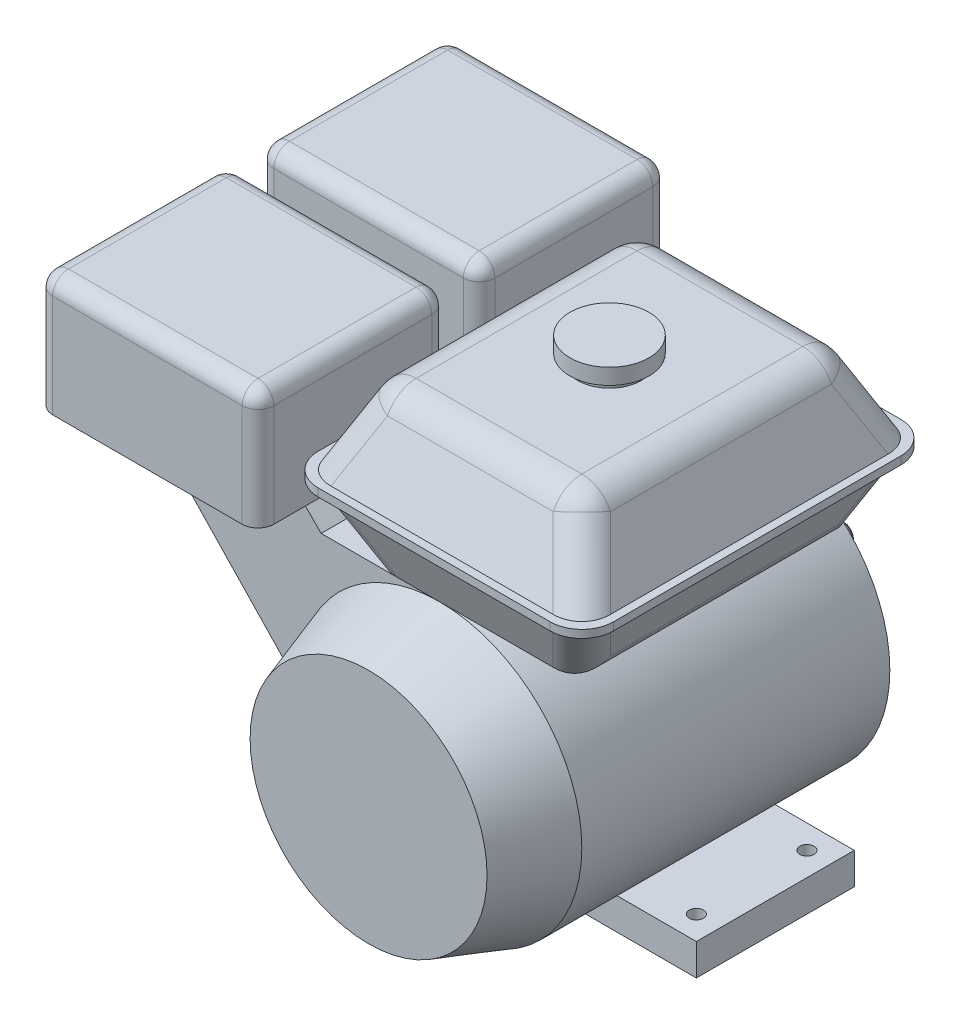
ISO-10303-21;
HEADER;
FILE_DESCRIPTION(('STEP AP214'),'2;1');
FILE_NAME('part.step','',(''),(''),'','','');
FILE_SCHEMA(('AUTOMOTIVE_DESIGN { 1 0 10303 214 1 1 1 1 }'));
ENDSEC;
DATA;
#1=APPLICATION_CONTEXT('core data for automotive mechanical design processes');
#2=APPLICATION_PROTOCOL_DEFINITION('international standard','automotive_design',2000,#1);
#3=PRODUCT_CONTEXT('',#1,'mechanical');
#4=PRODUCT('Part','Part','',(#3));
#5=PRODUCT_RELATED_PRODUCT_CATEGORY('part','',(#4));
#6=PRODUCT_DEFINITION_FORMATION('','',#4);
#7=PRODUCT_DEFINITION_CONTEXT('part definition',#1,'design');
#8=PRODUCT_DEFINITION('design','',#6,#7);
#9=PRODUCT_DEFINITION_SHAPE('','',#8);
#10=(LENGTH_UNIT() NAMED_UNIT(*) SI_UNIT(.MILLI.,.METRE.));
#11=(NAMED_UNIT(*) PLANE_ANGLE_UNIT() SI_UNIT($,.RADIAN.));
#12=(NAMED_UNIT(*) SI_UNIT($,.STERADIAN.) SOLID_ANGLE_UNIT());
#13=UNCERTAINTY_MEASURE_WITH_UNIT(LENGTH_MEASURE(1.E-05),#10,'distance_accuracy_value','');
#14=(GEOMETRIC_REPRESENTATION_CONTEXT(3) GLOBAL_UNCERTAINTY_ASSIGNED_CONTEXT((#13)) GLOBAL_UNIT_ASSIGNED_CONTEXT((#10,
#11,#12)) REPRESENTATION_CONTEXT('',''));
#15=CARTESIAN_POINT('',(0.,0.,0.));
#16=DIRECTION('',(0.,0.,1.));
#17=DIRECTION('',(1.,0.,0.));
#18=AXIS2_PLACEMENT_3D('',#15,#16,#17);
#19=CARTESIAN_POINT('',(110.983844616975,190.,215.983844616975));
#20=DIRECTION('',(0.,-1.,0.));
#21=DIRECTION('',(0.,0.,-1.));
#22=AXIS2_PLACEMENT_3D('',#19,#20,#21);
#23=PLANE('',#22);
#24=DIRECTION('',(0.,0.,-1.));
#25=VECTOR('',#24,1.);
#26=CARTESIAN_POINT('',(-29.9270564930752,190.,215.983844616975));
#27=LINE('',#26,#25);
#28=CARTESIAN_POINT('',(-29.9270564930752,190.,40.0729435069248));
#29=VERTEX_POINT('',#28);
#30=CARTESIAN_POINT('',(-29.9270564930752,190.,179.927056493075));
#31=VERTEX_POINT('',#30);
#32=EDGE_CURVE('E944',#29,#31,#27,.F.);
#33=ORIENTED_EDGE('',*,*,#32,.T.);
#34=DIRECTION('',(-1.,0.,0.));
#35=VECTOR('',#34,1.);
#36=CARTESIAN_POINT('',(110.983844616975,190.,179.927056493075));
#37=LINE('',#36,#35);
#38=CARTESIAN_POINT('',(74.9270564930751,190.,179.927056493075));
#39=VERTEX_POINT('',#38);
#40=EDGE_CURVE('E946',#31,#39,#37,.F.);
#41=ORIENTED_EDGE('',*,*,#40,.T.);
#42=DIRECTION('',(0.,0.,1.));
#43=VECTOR('',#42,1.);
#44=CARTESIAN_POINT('',(74.9270564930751,190.,215.983844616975));
#45=LINE('',#44,#43);
#46=CARTESIAN_POINT('',(74.9270564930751,190.,40.0729435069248));
#47=VERTEX_POINT('',#46);
#48=EDGE_CURVE('E940',#39,#47,#45,.F.);
#49=ORIENTED_EDGE('',*,*,#48,.T.);
#50=DIRECTION('',(1.,0.,0.));
#51=VECTOR('',#50,1.);
#52=CARTESIAN_POINT('',(110.983844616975,190.,40.0729435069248));
#53=LINE('',#52,#51);
#54=EDGE_CURVE('E942',#47,#29,#53,.F.);
#55=ORIENTED_EDGE('',*,*,#54,.T.);
#56=EDGE_LOOP('',(#33,#41,#49,#55));
#57=FACE_BOUND('',#56,.T.);
#58=CARTESIAN_POINT('',(22.5,190.,110.));
#59=DIRECTION('',(0.,-1.,0.));
#60=DIRECTION('',(0.,0.,-1.));
#61=AXIS2_PLACEMENT_3D('',#58,#59,#60);
#62=CIRCLE('',#61,20.);
#63=CARTESIAN_POINT('',(22.5,190.,90.));
#64=VERTEX_POINT('',#63);
#65=EDGE_CURVE('E1056',#64,#64,#62,.F.);
#66=ORIENTED_EDGE('',*,*,#65,.F.);
#67=EDGE_LOOP('',(#66));
#68=FACE_BOUND('',#67,.T.);
#69=ADVANCED_FACE('F24',(#57,#68),#23,.F.);
#70=CARTESIAN_POINT('',(115.983844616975,140.,220.983844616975));
#71=DIRECTION('',(0.,-1.,0.));
#72=DIRECTION('',(0.,0.,-1.));
#73=AXIS2_PLACEMENT_3D('',#70,#71,#72);
#74=PLANE('',#73);
#75=DIRECTION('',(0.,0.,1.));
#76=VECTOR('',#75,1.);
#77=CARTESIAN_POINT('',(-70.983844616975,140.,-0.983844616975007));
#78=LINE('',#77,#76);
#79=CARTESIAN_POINT('',(-70.983844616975,140.,19.016155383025));
#80=VERTEX_POINT('',#79);
#81=CARTESIAN_POINT('',(-70.983844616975,140.,200.983844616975));
#82=VERTEX_POINT('',#81);
#83=EDGE_CURVE('E626',#80,#82,#78,.T.);
#84=ORIENTED_EDGE('',*,*,#83,.T.);
#85=CARTESIAN_POINT('',(-50.983844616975,140.,200.983844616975));
#86=DIRECTION('',(0.,-1.,0.));
#87=DIRECTION('',(0.,0.,-1.));
#88=AXIS2_PLACEMENT_3D('',#85,#86,#87);
#89=CIRCLE('',#88,20.);
#90=CARTESIAN_POINT('',(-50.983844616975,140.,220.983844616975));
#91=VERTEX_POINT('',#90);
#92=EDGE_CURVE('E1045',#82,#91,#89,.F.);
#93=ORIENTED_EDGE('',*,*,#92,.T.);
#94=DIRECTION('',(1.,0.,0.));
#95=VECTOR('',#94,1.);
#96=CARTESIAN_POINT('',(115.983844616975,140.,220.983844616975));
#97=LINE('',#96,#95);
#98=CARTESIAN_POINT('',(95.983844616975,140.,220.983844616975));
#99=VERTEX_POINT('',#98);
#100=EDGE_CURVE('E629',#91,#99,#97,.T.);
#101=ORIENTED_EDGE('',*,*,#100,.T.);
#102=CARTESIAN_POINT('',(95.983844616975,140.,200.983844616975));
#103=DIRECTION('',(0.,-1.,0.));
#104=DIRECTION('',(0.,0.,-1.));
#105=AXIS2_PLACEMENT_3D('',#102,#103,#104);
#106=CIRCLE('',#105,20.);
#107=CARTESIAN_POINT('',(115.983844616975,140.,200.983844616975));
#108=VERTEX_POINT('',#107);
#109=EDGE_CURVE('E1039',#99,#108,#106,.F.);
#110=ORIENTED_EDGE('',*,*,#109,.T.);
#111=DIRECTION('',(0.,0.,-1.));
#112=VECTOR('',#111,1.);
#113=CARTESIAN_POINT('',(115.983844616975,140.,-0.983844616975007));
#114=LINE('',#113,#112);
#115=CARTESIAN_POINT('',(115.983844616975,140.,19.016155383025));
#116=VERTEX_POINT('',#115);
#117=EDGE_CURVE('E621',#108,#116,#114,.T.);
#118=ORIENTED_EDGE('',*,*,#117,.T.);
#119=CARTESIAN_POINT('',(95.983844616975,140.,19.016155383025));
#120=DIRECTION('',(0.,-1.,0.));
#121=DIRECTION('',(0.,0.,-1.));
#122=AXIS2_PLACEMENT_3D('',#119,#120,#121);
#123=CIRCLE('',#122,20.);
#124=CARTESIAN_POINT('',(95.983844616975,140.,-0.983844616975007));
#125=VERTEX_POINT('',#124);
#126=EDGE_CURVE('E1041',#116,#125,#123,.F.);
#127=ORIENTED_EDGE('',*,*,#126,.T.);
#128=DIRECTION('',(-1.,0.,0.));
#129=VECTOR('',#128,1.);
#130=CARTESIAN_POINT('',(115.983844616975,140.,-0.983844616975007));
#131=LINE('',#130,#129);
#132=CARTESIAN_POINT('',(-50.983844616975,140.,-0.983844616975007));
#133=VERTEX_POINT('',#132);
#134=EDGE_CURVE('E624',#125,#133,#131,.T.);
#135=ORIENTED_EDGE('',*,*,#134,.T.);
#136=CARTESIAN_POINT('',(-50.983844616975,140.,19.016155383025));
#137=DIRECTION('',(0.,-1.,0.));
#138=DIRECTION('',(0.,0.,-1.));
#139=AXIS2_PLACEMENT_3D('',#136,#137,#138);
#140=CIRCLE('',#139,20.);
#141=EDGE_CURVE('E1043',#133,#80,#140,.F.);
#142=ORIENTED_EDGE('',*,*,#141,.T.);
#143=EDGE_LOOP('',(#84,#93,#101,#110,#118,#127,#135,#142));
#144=FACE_BOUND('',#143,.T.);
#145=DIRECTION('',(0.,0.,-1.));
#146=VECTOR('',#145,1.);
#147=CARTESIAN_POINT('',(110.983844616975,140.,4.01615538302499));
#148=LINE('',#147,#146);
#149=CARTESIAN_POINT('',(110.983844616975,140.,197.857688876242));
#150=VERTEX_POINT('',#149);
#151=CARTESIAN_POINT('',(110.983844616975,140.,22.142311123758));
#152=VERTEX_POINT('',#151);
#153=EDGE_CURVE('E598',#150,#152,#148,.T.);
#154=ORIENTED_EDGE('',*,*,#153,.F.);
#155=CARTESIAN_POINT('',(88.9162862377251,140.,193.916286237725));
#156=DIRECTION('',(0.,-1.,0.));
#157=DIRECTION('',(0.707106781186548,0.,0.707106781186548));
#158=AXIS2_PLACEMENT_3D('',#155,#156,#157);
#159=ELLIPSE('',#158,23.9573426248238,20.);
#160=CARTESIAN_POINT('',(92.857688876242,140.,215.983844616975));
#161=VERTEX_POINT('',#160);
#162=EDGE_CURVE('E1011',#150,#161,#159,.T.);
#163=ORIENTED_EDGE('',*,*,#162,.T.);
#164=DIRECTION('',(1.,0.,0.));
#165=VECTOR('',#164,1.);
#166=CARTESIAN_POINT('',(110.983844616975,140.,215.983844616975));
#167=LINE('',#166,#165);
#168=CARTESIAN_POINT('',(-47.857688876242,140.,215.983844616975));
#169=VERTEX_POINT('',#168);
#170=EDGE_CURVE('E607',#169,#161,#167,.T.);
#171=ORIENTED_EDGE('',*,*,#170,.F.);
#172=CARTESIAN_POINT('',(-43.9162862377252,140.,193.916286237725));
#173=DIRECTION('',(0.,-1.,0.));
#174=DIRECTION('',(-0.707106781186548,0.,0.707106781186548));
#175=AXIS2_PLACEMENT_3D('',#172,#173,#174);
#176=ELLIPSE('',#175,23.9573426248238,20.);
#177=CARTESIAN_POINT('',(-65.983844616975,140.,197.857688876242));
#178=VERTEX_POINT('',#177);
#179=EDGE_CURVE('E1013',#169,#178,#176,.T.);
#180=ORIENTED_EDGE('',*,*,#179,.T.);
#181=DIRECTION('',(0.,0.,1.));
#182=VECTOR('',#181,1.);
#183=CARTESIAN_POINT('',(-65.983844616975,140.,4.01615538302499));
#184=LINE('',#183,#182);
#185=CARTESIAN_POINT('',(-65.983844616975,140.,22.142311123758));
#186=VERTEX_POINT('',#185);
#187=EDGE_CURVE('E604',#186,#178,#184,.T.);
#188=ORIENTED_EDGE('',*,*,#187,.F.);
#189=CARTESIAN_POINT('',(-43.9162862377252,140.,26.0837137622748));
#190=DIRECTION('',(0.,-1.,0.));
#191=DIRECTION('',(-0.707106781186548,0.,-0.707106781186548));
#192=AXIS2_PLACEMENT_3D('',#189,#190,#191);
#193=ELLIPSE('',#192,23.9573426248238,20.);
#194=CARTESIAN_POINT('',(-47.857688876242,140.,4.01615538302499));
#195=VERTEX_POINT('',#194);
#196=EDGE_CURVE('E1009',#186,#195,#193,.T.);
#197=ORIENTED_EDGE('',*,*,#196,.T.);
#198=DIRECTION('',(-1.,0.,0.));
#199=VECTOR('',#198,1.);
#200=CARTESIAN_POINT('',(110.983844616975,140.,4.01615538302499));
#201=LINE('',#200,#199);
#202=CARTESIAN_POINT('',(92.857688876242,140.,4.01615538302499));
#203=VERTEX_POINT('',#202);
#204=EDGE_CURVE('E601',#203,#195,#201,.T.);
#205=ORIENTED_EDGE('',*,*,#204,.F.);
#206=CARTESIAN_POINT('',(88.9162862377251,140.,26.0837137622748));
#207=DIRECTION('',(0.,-1.,0.));
#208=DIRECTION('',(0.707106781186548,0.,-0.707106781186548));
#209=AXIS2_PLACEMENT_3D('',#206,#207,#208);
#210=ELLIPSE('',#209,23.9573426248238,20.);
#211=EDGE_CURVE('E1007',#203,#152,#210,.T.);
#212=ORIENTED_EDGE('',*,*,#211,.T.);
#213=EDGE_LOOP('',(#154,#163,#171,#180,#188,#197,#205,#212));
#214=FACE_BOUND('',#213,.T.);
#215=ADVANCED_FACE('F1204',(#144,#214),#74,.F.);
#216=CARTESIAN_POINT('',(0.,90.,195.));
#217=DIRECTION('',(0.,1.,0.));
#218=DIRECTION('',(0.,0.,1.));
#219=AXIS2_PLACEMENT_3D('',#216,#217,#218);
#220=PLANE('',#219);
#221=DIRECTION('',(1.,0.,0.));
#222=VECTOR('',#221,1.);
#223=CARTESIAN_POINT('',(0.,90.,195.));
#224=LINE('',#223,#222);
#225=CARTESIAN_POINT('',(-75.,90.,195.));
#226=VERTEX_POINT('',#225);
#227=CARTESIAN_POINT('',(-26.873844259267,90.,195.));
#228=VERTEX_POINT('',#227);
#229=EDGE_CURVE('E808',#226,#228,#224,.T.);
#230=ORIENTED_EDGE('',*,*,#229,.T.);
#231=CARTESIAN_POINT('',(-22.9324416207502,90.,172.93244162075));
#232=DIRECTION('',(0.,1.,0.));
#233=DIRECTION('',(0.707106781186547,0.,-0.707106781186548));
#234=AXIS2_PLACEMENT_3D('',#231,#232,#233);
#235=ELLIPSE('',#234,23.9573426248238,20.);
#236=CARTESIAN_POINT('',(-45.,90.,176.873844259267));
#237=VERTEX_POINT('',#236);
#238=EDGE_CURVE('E1015',#228,#237,#235,.F.);
#239=ORIENTED_EDGE('',*,*,#238,.T.);
#240=DIRECTION('',(0.,0.,1.));
#241=VECTOR('',#240,1.);
#242=CARTESIAN_POINT('',(-45.,90.,195.));
#243=LINE('',#242,#241);
#244=CARTESIAN_POINT('',(-45.,90.,43.126155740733));
#245=VERTEX_POINT('',#244);
#246=EDGE_CURVE('E632',#245,#237,#243,.T.);
#247=ORIENTED_EDGE('',*,*,#246,.F.);
#248=CARTESIAN_POINT('',(-22.9324416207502,90.,47.0675583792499));
#249=DIRECTION('',(0.,1.,0.));
#250=DIRECTION('',(0.707106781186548,0.,0.707106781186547));
#251=AXIS2_PLACEMENT_3D('',#248,#249,#250);
#252=ELLIPSE('',#251,23.9573426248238,20.);
#253=CARTESIAN_POINT('',(-26.873844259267,90.,25.));
#254=VERTEX_POINT('',#253);
#255=EDGE_CURVE('E1003',#245,#254,#252,.F.);
#256=ORIENTED_EDGE('',*,*,#255,.T.);
#257=DIRECTION('',(-1.,0.,0.));
#258=VECTOR('',#257,1.);
#259=CARTESIAN_POINT('',(-45.,90.,25.));
#260=LINE('',#259,#258);
#261=CARTESIAN_POINT('',(0.,90.,25.));
#262=VERTEX_POINT('',#261);
#263=EDGE_CURVE('E638',#262,#254,#260,.T.);
#264=ORIENTED_EDGE('',*,*,#263,.F.);
#265=DIRECTION('',(0.,0.,-1.));
#266=VECTOR('',#265,1.);
#267=CARTESIAN_POINT('',(0.,90.,195.));
#268=LINE('',#267,#266);
#269=CARTESIAN_POINT('',(0.,90.,15.));
#270=VERTEX_POINT('',#269);
#271=EDGE_CURVE('E815',#262,#270,#268,.T.);
#272=ORIENTED_EDGE('',*,*,#271,.T.);
#273=DIRECTION('',(1.,0.,0.));
#274=VECTOR('',#273,1.);
#275=CARTESIAN_POINT('',(0.,90.,15.));
#276=LINE('',#275,#274);
#277=CARTESIAN_POINT('',(-75.,90.,15.));
#278=VERTEX_POINT('',#277);
#279=EDGE_CURVE('E785',#278,#270,#276,.T.);
#280=ORIENTED_EDGE('',*,*,#279,.F.);
#281=DIRECTION('',(0.,0.,1.));
#282=VECTOR('',#281,1.);
#283=CARTESIAN_POINT('',(-75.,90.,195.));
#284=LINE('',#283,#282);
#285=EDGE_CURVE('E850',#278,#226,#284,.T.);
#286=ORIENTED_EDGE('',*,*,#285,.T.);
#287=EDGE_LOOP('',(#230,#239,#247,#256,#264,#272,#280,#286));
#288=FACE_BOUND('',#287,.T.);
#289=ADVANCED_FACE('F1230',(#288),#220,.T.);
#290=CARTESIAN_POINT('',(-95.,110.,195.));
#291=DIRECTION('',(0.,1.,0.));
#292=DIRECTION('',(0.,0.,1.));
#293=AXIS2_PLACEMENT_3D('',#290,#291,#292);
#294=PLANE('',#293);
#295=DIRECTION('',(0.,0.,-1.));
#296=VECTOR('',#295,1.);
#297=CARTESIAN_POINT('',(-195.,110.,195.));
#298=LINE('',#297,#296);
#299=CARTESIAN_POINT('',(-195.,110.,115.));
#300=VERTEX_POINT('',#299);
#301=CARTESIAN_POINT('',(-195.,110.,95.));
#302=VERTEX_POINT('',#301);
#303=EDGE_CURVE('E825',#300,#302,#298,.T.);
#304=ORIENTED_EDGE('',*,*,#303,.F.);
#305=DIRECTION('',(-1.,0.,0.));
#306=VECTOR('',#305,1.);
#307=CARTESIAN_POINT('',(-215.,110.,115.));
#308=LINE('',#307,#306);
#309=CARTESIAN_POINT('',(-94.9999999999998,110.,115.));
#310=VERTEX_POINT('',#309);
#311=EDGE_CURVE('E700',#310,#300,#308,.T.);
#312=ORIENTED_EDGE('',*,*,#311,.F.);
#313=DIRECTION('',(0.,0.,-1.));
#314=VECTOR('',#313,1.);
#315=CARTESIAN_POINT('',(-95.,110.,195.));
#316=LINE('',#315,#314);
#317=CARTESIAN_POINT('',(-95.,110.,95.));
#318=VERTEX_POINT('',#317);
#319=EDGE_CURVE('E820',#310,#318,#316,.T.);
#320=ORIENTED_EDGE('',*,*,#319,.T.);
#321=DIRECTION('',(1.,0.,0.));
#322=VECTOR('',#321,1.);
#323=CARTESIAN_POINT('',(-215.,110.,95.));
#324=LINE('',#323,#322);
#325=EDGE_CURVE('E742',#302,#318,#324,.T.);
#326=ORIENTED_EDGE('',*,*,#325,.F.);
#327=EDGE_LOOP('',(#304,#312,#320,#326));
#328=FACE_BOUND('',#327,.T.);
#329=ADVANCED_FACE('F1449',(#328),#294,.T.);
#330=CARTESIAN_POINT('',(0.,0.,240.));
#331=DIRECTION('',(0.,0.,-1.));
#332=DIRECTION('',(-1.,0.,0.));
#333=AXIS2_PLACEMENT_3D('',#330,#331,#332);
#334=CYLINDRICAL_SURFACE('',#333,90.);
#335=CARTESIAN_POINT('',(0.,0.,0.));
#336=DIRECTION('',(0.,0.,1.));
#337=DIRECTION('',(1.,0.,0.));
#338=AXIS2_PLACEMENT_3D('',#335,#336,#337);
#339=CIRCLE('',#338,90.);
#340=CARTESIAN_POINT('',(90.,0.,0.));
#341=VERTEX_POINT('',#340);
#342=EDGE_CURVE('E819',#341,#341,#339,.T.);
#343=ORIENTED_EDGE('',*,*,#342,.T.);
#344=EDGE_LOOP('',(#343));
#345=FACE_BOUND('',#344,.T.);
#346=CARTESIAN_POINT('',(0.,0.,195.));
#347=DIRECTION('',(0.,0.,1.));
#348=DIRECTION('',(1.,0.,0.));
#349=AXIS2_PLACEMENT_3D('',#346,#347,#348);
#350=CIRCLE('',#349,90.);
#351=CARTESIAN_POINT('',(0.,90.,195.));
#352=VERTEX_POINT('',#351);
#353=CARTESIAN_POINT('',(-90.,0.,195.));
#354=VERTEX_POINT('',#353);
#355=EDGE_CURVE('E837',#352,#354,#350,.F.);
#356=ORIENTED_EDGE('',*,*,#355,.T.);
#357=DIRECTION('',(0.,0.,-1.));
#358=VECTOR('',#357,1.);
#359=CARTESIAN_POINT('',(-90.,0.,195.));
#360=LINE('',#359,#358);
#361=CARTESIAN_POINT('',(-90.,0.,15.));
#362=VERTEX_POINT('',#361);
#363=EDGE_CURVE('E827',#354,#362,#360,.T.);
#364=ORIENTED_EDGE('',*,*,#363,.T.);
#365=CARTESIAN_POINT('',(0.,0.,15.));
#366=DIRECTION('',(0.,0.,1.));
#367=DIRECTION('',(-1.,0.,0.));
#368=AXIS2_PLACEMENT_3D('',#365,#366,#367);
#369=CIRCLE('',#368,90.);
#370=EDGE_CURVE('E799',#270,#362,#369,.T.);
#371=ORIENTED_EDGE('',*,*,#370,.F.);
#372=ORIENTED_EDGE('',*,*,#271,.F.);
#373=EDGE_CURVE('E829',#352,#262,#268,.T.);
#374=ORIENTED_EDGE('',*,*,#373,.F.);
#375=EDGE_LOOP('',(#356,#364,#371,#372,#374));
#376=FACE_BOUND('',#375,.T.);
#377=CARTESIAN_POINT('',(0.,0.,125.));
#378=DIRECTION('',(0.,0.,1.));
#379=DIRECTION('',(-1.,0.,0.));
#380=AXIS2_PLACEMENT_3D('',#377,#378,#379);
#381=CIRCLE('',#380,90.);
#382=CARTESIAN_POINT('',(-29.5803989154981,-85.,125.));
#383=VERTEX_POINT('',#382);
#384=CARTESIAN_POINT('',(29.5803989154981,-85.,125.));
#385=VERTEX_POINT('',#384);
#386=EDGE_CURVE('E776',#383,#385,#381,.T.);
#387=ORIENTED_EDGE('',*,*,#386,.T.);
#388=DIRECTION('',(0.,0.,-1.));
#389=VECTOR('',#388,1.);
#390=CARTESIAN_POINT('',(29.5803989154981,-85.,125.));
#391=LINE('',#390,#389);
#392=CARTESIAN_POINT('',(29.5803989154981,-85.,25.));
#393=VERTEX_POINT('',#392);
#394=EDGE_CURVE('E786',#385,#393,#391,.T.);
#395=ORIENTED_EDGE('',*,*,#394,.T.);
#396=CARTESIAN_POINT('',(0.,0.,25.));
#397=DIRECTION('',(0.,0.,1.));
#398=DIRECTION('',(-1.,0.,0.));
#399=AXIS2_PLACEMENT_3D('',#396,#397,#398);
#400=CIRCLE('',#399,90.);
#401=CARTESIAN_POINT('',(-29.5803989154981,-85.,25.));
#402=VERTEX_POINT('',#401);
#403=EDGE_CURVE('E759',#402,#393,#400,.T.);
#404=ORIENTED_EDGE('',*,*,#403,.F.);
#405=DIRECTION('',(0.,0.,-1.));
#406=VECTOR('',#405,1.);
#407=CARTESIAN_POINT('',(-29.5803989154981,-85.,125.));
#408=LINE('',#407,#406);
#409=EDGE_CURVE('E789',#383,#402,#408,.T.);
#410=ORIENTED_EDGE('',*,*,#409,.F.);
#411=EDGE_LOOP('',(#387,#395,#404,#410));
#412=FACE_BOUND('',#411,.T.);
#413=ADVANCED_FACE('F26',(#345,#376,#412),#334,.T.);
#414=CARTESIAN_POINT('',(0.,0.,0.));
#415=DIRECTION('',(0.,0.,1.));
#416=DIRECTION('',(1.,0.,0.));
#417=AXIS2_PLACEMENT_3D('',#414,#415,#416);
#418=PLANE('',#417);
#419=CARTESIAN_POINT('',(-30.0520382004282,30.0520382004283,0.));
#420=DIRECTION('',(0.,0.,-1.));
#421=DIRECTION('',(-1.,0.,0.));
#422=AXIS2_PLACEMENT_3D('',#419,#420,#421);
#423=CIRCLE('',#422,3.99999999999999);
#424=CARTESIAN_POINT('',(-34.0520382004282,30.0520382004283,0.));
#425=VERTEX_POINT('',#424);
#426=EDGE_CURVE('E463',#425,#425,#423,.T.);
#427=ORIENTED_EDGE('',*,*,#426,.F.);
#428=EDGE_LOOP('',(#427));
#429=FACE_BOUND('',#428,.T.);
#430=CARTESIAN_POINT('',(-30.0520382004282,-30.0520382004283,0.));
#431=DIRECTION('',(0.,0.,-1.));
#432=DIRECTION('',(-1.,0.,0.));
#433=AXIS2_PLACEMENT_3D('',#430,#431,#432);
#434=CIRCLE('',#433,3.99999999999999);
#435=CARTESIAN_POINT('',(-34.0520382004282,-30.0520382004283,0.));
#436=VERTEX_POINT('',#435);
#437=EDGE_CURVE('E475',#436,#436,#434,.T.);
#438=ORIENTED_EDGE('',*,*,#437,.F.);
#439=EDGE_LOOP('',(#438));
#440=FACE_BOUND('',#439,.T.);
#441=CARTESIAN_POINT('',(30.0520382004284,-30.0520382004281,0.));
#442=DIRECTION('',(0.,0.,-1.));
#443=DIRECTION('',(-1.,0.,0.));
#444=AXIS2_PLACEMENT_3D('',#441,#442,#443);
#445=CIRCLE('',#444,4.);
#446=CARTESIAN_POINT('',(26.0520382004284,-30.0520382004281,0.));
#447=VERTEX_POINT('',#446);
#448=EDGE_CURVE('E487',#447,#447,#445,.T.);
#449=ORIENTED_EDGE('',*,*,#448,.F.);
#450=EDGE_LOOP('',(#449));
#451=FACE_BOUND('',#450,.T.);
#452=CARTESIAN_POINT('',(30.052038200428,30.0520382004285,0.));
#453=DIRECTION('',(0.,0.,-1.));
#454=DIRECTION('',(-1.,0.,0.));
#455=AXIS2_PLACEMENT_3D('',#452,#453,#454);
#456=CIRCLE('',#455,3.99999999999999);
#457=CARTESIAN_POINT('',(26.052038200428,30.0520382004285,0.));
#458=VERTEX_POINT('',#457);
#459=EDGE_CURVE('E499',#458,#458,#456,.T.);
#460=ORIENTED_EDGE('',*,*,#459,.F.);
#461=EDGE_LOOP('',(#460));
#462=FACE_BOUND('',#461,.T.);
#463=ORIENTED_EDGE('',*,*,#342,.F.);
#464=EDGE_LOOP('',(#463));
#465=FACE_BOUND('',#464,.T.);
#466=CARTESIAN_POINT('',(0.,0.,0.));
#467=DIRECTION('',(0.,0.,1.));
#468=DIRECTION('',(1.,0.,0.));
#469=AXIS2_PLACEMENT_3D('',#466,#467,#468);
#470=CIRCLE('',#469,9.);
#471=CARTESIAN_POINT('',(9.,0.,0.));
#472=VERTEX_POINT('',#471);
#473=EDGE_CURVE('E841',#472,#472,#470,.F.);
#474=ORIENTED_EDGE('',*,*,#473,.F.);
#475=EDGE_LOOP('',(#474));
#476=FACE_BOUND('',#475,.T.);
#477=ADVANCED_FACE('F1603',(#429,#440,#451,#462,#465,#476),#418,.F.);
#478=CARTESIAN_POINT('',(0.,0.,240.));
#479=DIRECTION('',(0.,0.,1.));
#480=DIRECTION('',(1.,0.,0.));
#481=AXIS2_PLACEMENT_3D('',#478,#479,#480);
#482=PLANE('',#481);
#483=CARTESIAN_POINT('',(0.,0.,240.));
#484=DIRECTION('',(0.,0.,1.));
#485=DIRECTION('',(1.,0.,0.));
#486=AXIS2_PLACEMENT_3D('',#483,#484,#485);
#487=CIRCLE('',#486,75.);
#488=CARTESIAN_POINT('',(75.,0.,240.));
#489=VERTEX_POINT('',#488);
#490=EDGE_CURVE('E834',#489,#489,#487,.T.);
#491=ORIENTED_EDGE('',*,*,#490,.T.);
#492=EDGE_LOOP('',(#491));
#493=FACE_BOUND('',#492,.T.);
#494=ADVANCED_FACE('F1598',(#493),#482,.T.);
#495=CARTESIAN_POINT('',(0.,0.,240.));
#496=DIRECTION('',(0.,0.,-1.));
#497=DIRECTION('',(-1.,0.,0.));
#498=AXIS2_PLACEMENT_3D('',#495,#496,#497);
#499=CONICAL_SURFACE('',#498,75.,0.321750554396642);
#500=EDGE_CURVE('E838',#354,#352,#350,.F.);
#501=ORIENTED_EDGE('',*,*,#500,.F.);
#502=ORIENTED_EDGE('',*,*,#355,.F.);
#503=EDGE_LOOP('',(#501,#502));
#504=FACE_BOUND('',#503,.T.);
#505=ORIENTED_EDGE('',*,*,#490,.F.);
#506=EDGE_LOOP('',(#505));
#507=FACE_BOUND('',#506,.T.);
#508=ADVANCED_FACE('F1485',(#504,#507),#499,.T.);
#509=CARTESIAN_POINT('',(0.,0.,-60.));
#510=DIRECTION('',(0.,0.,1.));
#511=DIRECTION('',(1.,0.,0.));
#512=AXIS2_PLACEMENT_3D('',#509,#510,#511);
#513=CYLINDRICAL_SURFACE('',#512,9.);
#514=CARTESIAN_POINT('',(0.,0.,-9.99999999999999));
#515=DIRECTION('',(0.,0.,-1.));
#516=DIRECTION('',(-1.,0.,0.));
#517=AXIS2_PLACEMENT_3D('',#514,#515,#516);
#518=CIRCLE('',#517,9.);
#519=CARTESIAN_POINT('',(-3.,8.48528137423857,-9.99999999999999));
#520=VERTEX_POINT('',#519);
#521=CARTESIAN_POINT('',(3.,8.48528137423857,-9.99999999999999));
#522=VERTEX_POINT('',#521);
#523=EDGE_CURVE('E11',#520,#522,#518,.T.);
#524=ORIENTED_EDGE('',*,*,#523,.F.);
#525=DIRECTION('',(0.,0.,1.));
#526=VECTOR('',#525,1.);
#527=CARTESIAN_POINT('',(-3.,8.48528137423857,-60.));
#528=LINE('',#527,#526);
#529=CARTESIAN_POINT('',(-3.,8.4852813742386,-58.));
#530=VERTEX_POINT('',#529);
#531=EDGE_CURVE('E523',#520,#530,#528,.F.);
#532=ORIENTED_EDGE('',*,*,#531,.T.);
#533=CARTESIAN_POINT('',(0.,0.,-58.));
#534=DIRECTION('',(0.,0.,-1.));
#535=DIRECTION('',(-1.,0.,0.));
#536=AXIS2_PLACEMENT_3D('',#533,#534,#535);
#537=CIRCLE('',#536,9.);
#538=CARTESIAN_POINT('',(3.,8.48528137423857,-58.));
#539=VERTEX_POINT('',#538);
#540=EDGE_CURVE('E847',#530,#539,#537,.F.);
#541=ORIENTED_EDGE('',*,*,#540,.T.);
#542=DIRECTION('',(0.,0.,1.));
#543=VECTOR('',#542,1.);
#544=CARTESIAN_POINT('',(3.,8.48528137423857,-60.));
#545=LINE('',#544,#543);
#546=EDGE_CURVE('E39',#539,#522,#545,.T.);
#547=ORIENTED_EDGE('',*,*,#546,.T.);
#548=EDGE_LOOP('',(#524,#532,#541,#547));
#549=FACE_BOUND('',#548,.T.);
#550=ORIENTED_EDGE('',*,*,#473,.T.);
#551=EDGE_LOOP('',(#550));
#552=FACE_BOUND('',#551,.T.);
#553=ADVANCED_FACE('F1597',(#549,#552),#513,.T.);
#554=CARTESIAN_POINT('',(0.,0.,-60.));
#555=DIRECTION('',(0.,0.,-1.));
#556=DIRECTION('',(-1.,0.,0.));
#557=AXIS2_PLACEMENT_3D('',#554,#555,#556);
#558=PLANE('',#557);
#559=DIRECTION('',(0.,1.,0.));
#560=VECTOR('',#559,1.);
#561=CARTESIAN_POINT('',(-3.,6.,-60.));
#562=LINE('',#561,#560);
#563=CARTESIAN_POINT('',(-3.,6.,-60.));
#564=VERTEX_POINT('',#563);
#565=CARTESIAN_POINT('',(-3.,6.32455532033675,-60.));
#566=VERTEX_POINT('',#565);
#567=EDGE_CURVE('E502',#564,#566,#562,.T.);
#568=ORIENTED_EDGE('',*,*,#567,.F.);
#569=DIRECTION('',(-1.,0.,0.));
#570=VECTOR('',#569,1.);
#571=CARTESIAN_POINT('',(-3.,6.,-60.));
#572=LINE('',#571,#570);
#573=CARTESIAN_POINT('',(3.,6.,-60.));
#574=VERTEX_POINT('',#573);
#575=EDGE_CURVE('E506',#574,#564,#572,.T.);
#576=ORIENTED_EDGE('',*,*,#575,.F.);
#577=DIRECTION('',(0.,-1.,0.));
#578=VECTOR('',#577,1.);
#579=CARTESIAN_POINT('',(3.,6.,-60.));
#580=LINE('',#579,#578);
#581=CARTESIAN_POINT('',(3.,6.32455532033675,-60.));
#582=VERTEX_POINT('',#581);
#583=EDGE_CURVE('E504',#582,#574,#580,.T.);
#584=ORIENTED_EDGE('',*,*,#583,.F.);
#585=CARTESIAN_POINT('',(0.,0.,-60.));
#586=DIRECTION('',(0.,0.,-1.));
#587=DIRECTION('',(-1.,0.,0.));
#588=AXIS2_PLACEMENT_3D('',#585,#586,#587);
#589=CIRCLE('',#588,7.);
#590=EDGE_CURVE('E844',#582,#566,#589,.T.);
#591=ORIENTED_EDGE('',*,*,#590,.T.);
#592=EDGE_LOOP('',(#568,#576,#584,#591));
#593=FACE_BOUND('',#592,.T.);
#594=ADVANCED_FACE('F1611',(#593),#558,.T.);
#595=CARTESIAN_POINT('',(0.,0.,-60.));
#596=DIRECTION('',(0.,0.,1.));
#597=DIRECTION('',(1.,0.,0.));
#598=AXIS2_PLACEMENT_3D('',#595,#596,#597);
#599=CONICAL_SURFACE('',#598,7.,0.785398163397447);
#600=CARTESIAN_POINT('',(-3.,2.5073086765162,-63.0901922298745));
#601=CARTESIAN_POINT('',(-3.,2.58835184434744,-63.0382056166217));
#602=CARTESIAN_POINT('',(-3.,2.66872710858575,-62.9851931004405));
#603=CARTESIAN_POINT('',(-3.,2.82828069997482,-62.8774181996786));
#604=CARTESIAN_POINT('',(-3.,2.90745919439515,-62.8226560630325));
#605=CARTESIAN_POINT('',(-3.,3.06473965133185,-62.7116981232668));
#606=CARTESIAN_POINT('',(-3.,3.14284215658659,-62.6555030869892));
#607=CARTESIAN_POINT('',(-3.,3.29814029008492,-62.5418691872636));
#608=CARTESIAN_POINT('',(-3.,3.3753358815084,-62.4844302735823));
#609=CARTESIAN_POINT('',(-3.,3.60554336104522,-62.3106732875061));
#610=CARTESIAN_POINT('',(-3.,3.75736624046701,-62.1927793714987));
#611=CARTESIAN_POINT('',(-3.,4.05855539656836,-61.9538642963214));
#612=CARTESIAN_POINT('',(-3.,4.20792128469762,-61.8328426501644));
#613=CARTESIAN_POINT('',(-3.,4.50444277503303,-61.5886277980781));
#614=CARTESIAN_POINT('',(-3.,4.65160166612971,-61.4654385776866));
#615=CARTESIAN_POINT('',(-3.,4.94434391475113,-61.2172220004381));
#616=CARTESIAN_POINT('',(-3.,5.08992735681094,-61.0921947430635));
#617=CARTESIAN_POINT('',(-3.,5.37985773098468,-60.8406432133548));
#618=CARTESIAN_POINT('',(-3.,5.52420434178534,-60.7141185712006));
#619=CARTESIAN_POINT('',(-3.,5.81185224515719,-60.459885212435));
#620=CARTESIAN_POINT('',(-3.,5.95515352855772,-60.3321764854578));
#621=CARTESIAN_POINT('',(-3.,6.18208509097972,-60.1285516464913));
#622=CARTESIAN_POINT('',(-3.,6.26599993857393,-60.0529522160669));
#623=CARTESIAN_POINT('',(-3.,6.43356732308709,-59.9014431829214));
#624=CARTESIAN_POINT('',(-3.,6.51721982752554,-59.8255335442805));
#625=CARTESIAN_POINT('',(-3.,6.815527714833,-59.5539610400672));
#626=CARTESIAN_POINT('',(-3.,7.0294971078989,-59.3575443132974));
#627=CARTESIAN_POINT('',(-3.,7.45617181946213,-58.963342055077));
#628=CARTESIAN_POINT('',(-3.,7.66887712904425,-58.7655565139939));
#629=CARTESIAN_POINT('',(-3.,8.30551052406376,-58.1705872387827));
#630=CARTESIAN_POINT('',(-3.,8.72794260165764,-57.7718031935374));
#631=CARTESIAN_POINT('',(-3.,9.56974445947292,-56.9718900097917));
#632=CARTESIAN_POINT('',(-3.,9.9891169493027,-56.5707637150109));
#633=CARTESIAN_POINT('',(-3.,10.6167752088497,-55.967657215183));
#634=CARTESIAN_POINT('',(-3.,10.8257514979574,-55.7663949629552));
#635=CARTESIAN_POINT('',(-3.,11.2433088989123,-55.3634623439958));
#636=CARTESIAN_POINT('',(-3.,11.4518900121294,-55.161791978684));
#637=CARTESIAN_POINT('',(-3.,11.6603067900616,-54.9599520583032));
#638=B_SPLINE_CURVE_WITH_KNOTS('',3,(#600,#601,#602,#603,#604,#605,#606,#607,#608,#609,#610,
#611,#612,#613,#614,#615,#616,#617,#618,#619,#620,#621,#622,#623,#624,#625,#626,#627,#628,#629,
#630,#631,#632,#633,#634,#635,#636,#637),.UNSPECIFIED.,.F.,.F.,(4,2,2,2,2,2,2,2,2,2,2,2,2,2,2,2,
2,2,4),(0.,0.288832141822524,0.577623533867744,0.86626348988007,1.15491512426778,
1.73151768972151,2.30821057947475,2.88393557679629,3.45962952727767,4.03546875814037,
4.61131303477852,4.95015271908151,5.28903281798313,6.16038016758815,7.03173365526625,
8.77449544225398,10.5154593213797,11.3858600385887,12.2562577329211),.UNSPECIFIED.);
#639=EDGE_CURVE('E32',#566,#530,#638,.T.);
#640=ORIENTED_EDGE('',*,*,#639,.F.);
#641=ORIENTED_EDGE('',*,*,#590,.F.);
#642=CARTESIAN_POINT('',(3.,11.6603067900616,-54.9599520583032));
#643=CARTESIAN_POINT('',(3.,11.4515901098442,-55.1620824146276));
#644=CARTESIAN_POINT('',(3.,11.242708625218,-55.3640427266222));
#645=CARTESIAN_POINT('',(3.,10.8245494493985,-55.7675537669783));
#646=CARTESIAN_POINT('',(3.,10.6152717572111,-55.9691044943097));
#647=CARTESIAN_POINT('',(3.,9.9868051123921,-56.5729797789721));
#648=CARTESIAN_POINT('',(3.,9.56692378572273,-56.974584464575));
#649=CARTESIAN_POINT('',(3.,8.72520327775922,-57.7743918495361));
#650=CARTESIAN_POINT('',(3.,8.30336830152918,-58.1725989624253));
#651=CARTESIAN_POINT('',(3.,7.66759093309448,-58.7667537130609));
#652=CARTESIAN_POINT('',(3.,7.45514091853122,-58.9642976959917));
#653=CARTESIAN_POINT('',(3.,7.02897940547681,-59.3580193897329));
#654=CARTESIAN_POINT('',(3.,6.81526791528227,-59.5541971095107));
#655=CARTESIAN_POINT('',(3.,6.43793684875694,-59.8977112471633));
#656=CARTESIAN_POINT('',(3.,6.27465912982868,-60.0454229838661));
#657=CARTESIAN_POINT('',(3.,5.94696920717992,-60.3395779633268));
#658=CARTESIAN_POINT('',(3.,5.78255702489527,-60.4860212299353));
#659=CARTESIAN_POINT('',(3.,5.45239796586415,-60.7772518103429));
#660=CARTESIAN_POINT('',(3.,5.28665170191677,-60.9220398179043));
#661=CARTESIAN_POINT('',(3.,4.953383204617,-61.2095856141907));
#662=CARTESIAN_POINT('',(3.,4.7858608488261,-61.3523432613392));
#663=CARTESIAN_POINT('',(3.,4.44828605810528,-61.6354149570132));
#664=CARTESIAN_POINT('',(3.,4.27822988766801,-61.7757245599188));
#665=CARTESIAN_POINT('',(3.,3.93521907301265,-62.052709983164));
#666=CARTESIAN_POINT('',(3.,3.76226499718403,-62.1893865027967));
#667=CARTESIAN_POINT('',(3.,3.49980367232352,-62.3907166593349));
#668=CARTESIAN_POINT('',(3.,3.41174601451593,-62.4572599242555));
#669=CARTESIAN_POINT('',(3.,3.23450458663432,-62.5888221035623));
#670=CARTESIAN_POINT('',(3.,3.14532087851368,-62.6538411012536));
#671=CARTESIAN_POINT('',(3.,2.96558685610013,-62.7820948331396));
#672=CARTESIAN_POINT('',(3.,2.87503569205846,-62.8453283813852));
#673=CARTESIAN_POINT('',(3.,2.69238491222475,-62.9695526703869));
#674=CARTESIAN_POINT('',(3.,2.6002850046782,-63.0305429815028));
#675=CARTESIAN_POINT('',(3.,2.5073086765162,-63.0901922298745));
#676=B_SPLINE_CURVE_WITH_KNOTS('',3,(#642,#643,#644,#645,#646,#647,#648,#649,#650,#651,#652,
#653,#654,#655,#656,#657,#658,#659,#660,#661,#662,#663,#664,#665,#666,#667,#668,#669,#670,#671,
#672,#673,#674,#675),.UNSPECIFIED.,.F.,.F.,(4,2,2,2,2,2,2,2,2,2,2,2,2,2,2,2,4),(0.,
0.871650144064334,1.74330247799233,3.48636140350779,5.22663270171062,6.09693167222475,
6.96722492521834,7.62775396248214,8.28827055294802,8.94849932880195,9.60877391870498,
10.2701436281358,10.9313851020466,11.262490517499,11.5935777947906,11.9248800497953,
12.2562454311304),.UNSPECIFIED.);
#677=EDGE_CURVE('E1059',#539,#582,#676,.T.);
#678=ORIENTED_EDGE('',*,*,#677,.F.);
#679=ORIENTED_EDGE('',*,*,#540,.F.);
#680=EDGE_LOOP('',(#640,#641,#678,#679));
#681=FACE_BOUND('',#680,.T.);
#682=ADVANCED_FACE('F1069',(#681),#599,.T.);
#683=CARTESIAN_POINT('',(-195.,110.,195.));
#684=DIRECTION('',(-0.723355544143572,-0.6904757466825,0.));
#685=DIRECTION('',(0.690475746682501,-0.723355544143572,0.));
#686=AXIS2_PLACEMENT_3D('',#683,#684,#685);
#687=PLANE('',#686);
#688=DIRECTION('',(-0.690475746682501,0.723355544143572,0.));
#689=VECTOR('',#688,1.);
#690=CARTESIAN_POINT('',(-195.,110.,15.));
#691=LINE('',#690,#689);
#692=CARTESIAN_POINT('',(-195.,110.,15.));
#693=VERTEX_POINT('',#692);
#694=EDGE_CURVE('E802',#362,#693,#691,.T.);
#695=ORIENTED_EDGE('',*,*,#694,.F.);
#696=ORIENTED_EDGE('',*,*,#363,.F.);
#697=DIRECTION('',(-0.690475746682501,0.723355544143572,0.));
#698=VECTOR('',#697,1.);
#699=CARTESIAN_POINT('',(-195.,110.,195.));
#700=LINE('',#699,#698);
#701=CARTESIAN_POINT('',(-195.,110.,195.));
#702=VERTEX_POINT('',#701);
#703=EDGE_CURVE('E810',#354,#702,#700,.T.);
#704=ORIENTED_EDGE('',*,*,#703,.T.);
#705=EDGE_CURVE('E822',#702,#300,#298,.T.);
#706=ORIENTED_EDGE('',*,*,#705,.T.);
#707=ORIENTED_EDGE('',*,*,#303,.T.);
#708=EDGE_CURVE('E826',#302,#693,#298,.T.);
#709=ORIENTED_EDGE('',*,*,#708,.T.);
#710=EDGE_LOOP('',(#695,#696,#704,#706,#707,#709));
#711=FACE_BOUND('',#710,.T.);
#712=ADVANCED_FACE('F1447',(#711),#687,.T.);
#713=CARTESIAN_POINT('',(0.,0.,195.));
#714=DIRECTION('',(0.,0.,-1.));
#715=DIRECTION('',(-1.,0.,0.));
#716=AXIS2_PLACEMENT_3D('',#713,#714,#715);
#717=PLANE('',#716);
#718=ORIENTED_EDGE('',*,*,#229,.F.);
#719=DIRECTION('',(0.707106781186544,-0.707106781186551,0.));
#720=VECTOR('',#719,1.);
#721=CARTESIAN_POINT('',(7.49999999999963,7.49999999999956,195.));
#722=LINE('',#721,#720);
#723=CARTESIAN_POINT('',(-95.,110.,195.));
#724=VERTEX_POINT('',#723);
#725=EDGE_CURVE('E854',#226,#724,#722,.F.);
#726=ORIENTED_EDGE('',*,*,#725,.T.);
#727=DIRECTION('',(1.,0.,0.));
#728=VECTOR('',#727,1.);
#729=CARTESIAN_POINT('',(-95.,110.,195.));
#730=LINE('',#729,#728);
#731=EDGE_CURVE('E812',#702,#724,#730,.T.);
#732=ORIENTED_EDGE('',*,*,#731,.F.);
#733=ORIENTED_EDGE('',*,*,#703,.F.);
#734=ORIENTED_EDGE('',*,*,#500,.T.);
#735=DIRECTION('',(1.,0.,0.));
#736=VECTOR('',#735,1.);
#737=CARTESIAN_POINT('',(-45.,90.,195.));
#738=LINE('',#737,#736);
#739=EDGE_CURVE('E636',#228,#352,#738,.T.);
#740=ORIENTED_EDGE('',*,*,#739,.F.);
#741=EDGE_LOOP('',(#718,#726,#732,#733,#734,#740));
#742=FACE_BOUND('',#741,.T.);
#743=ADVANCED_FACE('F1443',(#742),#717,.F.);
#744=CARTESIAN_POINT('',(0.,0.,15.));
#745=DIRECTION('',(0.,0.,-1.));
#746=DIRECTION('',(-1.,0.,0.));
#747=AXIS2_PLACEMENT_3D('',#744,#745,#746);
#748=PLANE('',#747);
#749=DIRECTION('',(1.,0.,0.));
#750=VECTOR('',#749,1.);
#751=CARTESIAN_POINT('',(-95.,110.,15.));
#752=LINE('',#751,#750);
#753=CARTESIAN_POINT('',(-95.,110.,15.));
#754=VERTEX_POINT('',#753);
#755=EDGE_CURVE('E805',#693,#754,#752,.T.);
#756=ORIENTED_EDGE('',*,*,#755,.T.);
#757=DIRECTION('',(-0.707106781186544,0.707106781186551,0.));
#758=VECTOR('',#757,1.);
#759=CARTESIAN_POINT('',(-95.,110.,15.));
#760=LINE('',#759,#758);
#761=EDGE_CURVE('E852',#754,#278,#760,.F.);
#762=ORIENTED_EDGE('',*,*,#761,.T.);
#763=ORIENTED_EDGE('',*,*,#279,.T.);
#764=ORIENTED_EDGE('',*,*,#370,.T.);
#765=ORIENTED_EDGE('',*,*,#694,.T.);
#766=EDGE_LOOP('',(#756,#762,#763,#764,#765));
#767=FACE_BOUND('',#766,.T.);
#768=ADVANCED_FACE('F1439',(#767),#748,.T.);
#769=CARTESIAN_POINT('',(-95.,110.,195.));
#770=DIRECTION('',(0.707106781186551,0.707106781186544,0.));
#771=DIRECTION('',(-0.707106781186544,0.707106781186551,0.));
#772=AXIS2_PLACEMENT_3D('',#769,#770,#771);
#773=PLANE('',#772);
#774=ORIENTED_EDGE('',*,*,#725,.F.);
#775=ORIENTED_EDGE('',*,*,#285,.F.);
#776=ORIENTED_EDGE('',*,*,#761,.F.);
#777=EDGE_CURVE('E821',#318,#754,#316,.T.);
#778=ORIENTED_EDGE('',*,*,#777,.F.);
#779=ORIENTED_EDGE('',*,*,#319,.F.);
#780=EDGE_CURVE('E816',#724,#310,#316,.T.);
#781=ORIENTED_EDGE('',*,*,#780,.F.);
#782=EDGE_LOOP('',(#774,#775,#776,#778,#779,#781));
#783=FACE_BOUND('',#782,.T.);
#784=ADVANCED_FACE('F1435',(#783),#773,.T.);
#785=CARTESIAN_POINT('',(92.5,-85.,125.));
#786=DIRECTION('',(1.,0.,0.));
#787=DIRECTION('',(0.,0.,-1.));
#788=AXIS2_PLACEMENT_3D('',#785,#786,#787);
#789=PLANE('',#788);
#790=DIRECTION('',(0.,-1.,0.));
#791=VECTOR('',#790,1.);
#792=CARTESIAN_POINT('',(92.5,-85.,25.));
#793=LINE('',#792,#791);
#794=CARTESIAN_POINT('',(92.5,-85.,25.));
#795=VERTEX_POINT('',#794);
#796=CARTESIAN_POINT('',(92.5,-105.,25.));
#797=VERTEX_POINT('',#796);
#798=EDGE_CURVE('E748',#795,#797,#793,.T.);
#799=ORIENTED_EDGE('',*,*,#798,.F.);
#800=DIRECTION('',(0.,0.,-1.));
#801=VECTOR('',#800,1.);
#802=CARTESIAN_POINT('',(92.5,-85.,125.));
#803=LINE('',#802,#801);
#804=CARTESIAN_POINT('',(92.5,-85.,125.));
#805=VERTEX_POINT('',#804);
#806=EDGE_CURVE('E783',#805,#795,#803,.T.);
#807=ORIENTED_EDGE('',*,*,#806,.F.);
#808=DIRECTION('',(0.,-1.,0.));
#809=VECTOR('',#808,1.);
#810=CARTESIAN_POINT('',(92.5,-85.,125.));
#811=LINE('',#810,#809);
#812=CARTESIAN_POINT('',(92.5,-105.,125.));
#813=VERTEX_POINT('',#812);
#814=EDGE_CURVE('E764',#805,#813,#811,.T.);
#815=ORIENTED_EDGE('',*,*,#814,.T.);
#816=DIRECTION('',(0.,0.,-1.));
#817=VECTOR('',#816,1.);
#818=CARTESIAN_POINT('',(92.5,-105.,125.));
#819=LINE('',#818,#817);
#820=EDGE_CURVE('E782',#813,#797,#819,.T.);
#821=ORIENTED_EDGE('',*,*,#820,.T.);
#822=EDGE_LOOP('',(#799,#807,#815,#821));
#823=FACE_BOUND('',#822,.T.);
#824=ADVANCED_FACE('F1421',(#823),#789,.T.);
#825=CARTESIAN_POINT('',(92.5,-85.,125.));
#826=DIRECTION('',(0.,1.,0.));
#827=DIRECTION('',(0.,0.,1.));
#828=AXIS2_PLACEMENT_3D('',#825,#826,#827);
#829=PLANE('',#828);
#830=CARTESIAN_POINT('',(77.5,-85.,110.));
#831=DIRECTION('',(0.,1.,0.));
#832=DIRECTION('',(0.,0.,1.));
#833=AXIS2_PLACEMENT_3D('',#830,#831,#832);
#834=CIRCLE('',#833,4.50000000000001);
#835=CARTESIAN_POINT('',(77.5,-85.,114.5));
#836=VERTEX_POINT('',#835);
#837=EDGE_CURVE('E541',#836,#836,#834,.T.);
#838=ORIENTED_EDGE('',*,*,#837,.F.);
#839=EDGE_LOOP('',(#838));
#840=FACE_BOUND('',#839,.T.);
#841=CARTESIAN_POINT('',(77.5,-85.,40.));
#842=DIRECTION('',(0.,1.,0.));
#843=DIRECTION('',(0.,0.,1.));
#844=AXIS2_PLACEMENT_3D('',#841,#842,#843);
#845=CIRCLE('',#844,4.50000000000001);
#846=CARTESIAN_POINT('',(77.5,-85.,44.5));
#847=VERTEX_POINT('',#846);
#848=EDGE_CURVE('E547',#847,#847,#845,.T.);
#849=ORIENTED_EDGE('',*,*,#848,.F.);
#850=EDGE_LOOP('',(#849));
#851=FACE_BOUND('',#850,.T.);
#852=DIRECTION('',(1.,0.,0.));
#853=VECTOR('',#852,1.);
#854=CARTESIAN_POINT('',(92.5,-85.,25.));
#855=LINE('',#854,#853);
#856=EDGE_CURVE('E761',#393,#795,#855,.T.);
#857=ORIENTED_EDGE('',*,*,#856,.F.);
#858=ORIENTED_EDGE('',*,*,#394,.F.);
#859=DIRECTION('',(1.,0.,0.));
#860=VECTOR('',#859,1.);
#861=CARTESIAN_POINT('',(92.5,-85.,125.));
#862=LINE('',#861,#860);
#863=EDGE_CURVE('E779',#385,#805,#862,.T.);
#864=ORIENTED_EDGE('',*,*,#863,.T.);
#865=ORIENTED_EDGE('',*,*,#806,.T.);
#866=EDGE_LOOP('',(#857,#858,#864,#865));
#867=FACE_BOUND('',#866,.T.);
#868=ADVANCED_FACE('F1417',(#840,#851,#867),#829,.T.);
#869=CARTESIAN_POINT('',(-29.5803989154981,-85.,125.));
#870=DIRECTION('',(0.,1.,0.));
#871=DIRECTION('',(0.,0.,1.));
#872=AXIS2_PLACEMENT_3D('',#869,#870,#871);
#873=PLANE('',#872);
#874=CARTESIAN_POINT('',(-77.5,-85.,110.));
#875=DIRECTION('',(0.,1.,0.));
#876=DIRECTION('',(0.,0.,1.));
#877=AXIS2_PLACEMENT_3D('',#874,#875,#876);
#878=CIRCLE('',#877,4.50000000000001);
#879=CARTESIAN_POINT('',(-77.5,-85.,114.5));
#880=VERTEX_POINT('',#879);
#881=EDGE_CURVE('E529',#880,#880,#878,.T.);
#882=ORIENTED_EDGE('',*,*,#881,.F.);
#883=EDGE_LOOP('',(#882));
#884=FACE_BOUND('',#883,.T.);
#885=CARTESIAN_POINT('',(-77.5,-85.,40.));
#886=DIRECTION('',(0.,1.,0.));
#887=DIRECTION('',(0.,0.,1.));
#888=AXIS2_PLACEMENT_3D('',#885,#886,#887);
#889=CIRCLE('',#888,4.50000000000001);
#890=CARTESIAN_POINT('',(-77.5,-85.,44.5));
#891=VERTEX_POINT('',#890);
#892=EDGE_CURVE('E535',#891,#891,#889,.T.);
#893=ORIENTED_EDGE('',*,*,#892,.F.);
#894=EDGE_LOOP('',(#893));
#895=FACE_BOUND('',#894,.T.);
#896=DIRECTION('',(1.,0.,0.));
#897=VECTOR('',#896,1.);
#898=CARTESIAN_POINT('',(-29.5803989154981,-85.,25.));
#899=LINE('',#898,#897);
#900=CARTESIAN_POINT('',(-92.5,-85.,25.));
#901=VERTEX_POINT('',#900);
#902=EDGE_CURVE('E757',#901,#402,#899,.T.);
#903=ORIENTED_EDGE('',*,*,#902,.F.);
#904=DIRECTION('',(0.,0.,-1.));
#905=VECTOR('',#904,1.);
#906=CARTESIAN_POINT('',(-92.5,-85.,125.));
#907=LINE('',#906,#905);
#908=CARTESIAN_POINT('',(-92.5,-85.,125.));
#909=VERTEX_POINT('',#908);
#910=EDGE_CURVE('E792',#909,#901,#907,.T.);
#911=ORIENTED_EDGE('',*,*,#910,.F.);
#912=DIRECTION('',(1.,0.,0.));
#913=VECTOR('',#912,1.);
#914=CARTESIAN_POINT('',(-29.5803989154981,-85.,125.));
#915=LINE('',#914,#913);
#916=EDGE_CURVE('E773',#909,#383,#915,.T.);
#917=ORIENTED_EDGE('',*,*,#916,.T.);
#918=ORIENTED_EDGE('',*,*,#409,.T.);
#919=EDGE_LOOP('',(#903,#911,#917,#918));
#920=FACE_BOUND('',#919,.T.);
#921=ADVANCED_FACE('F1420',(#884,#895,#920),#873,.T.);
#922=CARTESIAN_POINT('',(-92.5,-85.,125.));
#923=DIRECTION('',(-1.,0.,0.));
#924=DIRECTION('',(0.,-1.,0.));
#925=AXIS2_PLACEMENT_3D('',#922,#923,#924);
#926=PLANE('',#925);
#927=DIRECTION('',(0.,1.,0.));
#928=VECTOR('',#927,1.);
#929=CARTESIAN_POINT('',(-92.5,-85.,25.));
#930=LINE('',#929,#928);
#931=CARTESIAN_POINT('',(-92.5,-105.,25.));
#932=VERTEX_POINT('',#931);
#933=EDGE_CURVE('E754',#932,#901,#930,.T.);
#934=ORIENTED_EDGE('',*,*,#933,.F.);
#935=DIRECTION('',(0.,0.,-1.));
#936=VECTOR('',#935,1.);
#937=CARTESIAN_POINT('',(-92.5,-105.,125.));
#938=LINE('',#937,#936);
#939=CARTESIAN_POINT('',(-92.5,-105.,125.));
#940=VERTEX_POINT('',#939);
#941=EDGE_CURVE('E794',#940,#932,#938,.T.);
#942=ORIENTED_EDGE('',*,*,#941,.F.);
#943=DIRECTION('',(0.,1.,0.));
#944=VECTOR('',#943,1.);
#945=CARTESIAN_POINT('',(-92.5,-85.,125.));
#946=LINE('',#945,#944);
#947=EDGE_CURVE('E770',#940,#909,#946,.T.);
#948=ORIENTED_EDGE('',*,*,#947,.T.);
#949=ORIENTED_EDGE('',*,*,#910,.T.);
#950=EDGE_LOOP('',(#934,#942,#948,#949));
#951=FACE_BOUND('',#950,.T.);
#952=ADVANCED_FACE('F1425',(#951),#926,.T.);
#953=CARTESIAN_POINT('',(92.5,-105.,125.));
#954=DIRECTION('',(0.,-1.,0.));
#955=DIRECTION('',(0.,0.,-1.));
#956=AXIS2_PLACEMENT_3D('',#953,#954,#955);
#957=PLANE('',#956);
#958=CARTESIAN_POINT('',(-77.5,-105.,110.));
#959=DIRECTION('',(0.,-1.,0.));
#960=DIRECTION('',(0.,0.,-1.));
#961=AXIS2_PLACEMENT_3D('',#958,#959,#960);
#962=CIRCLE('',#961,4.50000000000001);
#963=CARTESIAN_POINT('',(-77.5,-105.,105.5));
#964=VERTEX_POINT('',#963);
#965=EDGE_CURVE('E526',#964,#964,#962,.T.);
#966=ORIENTED_EDGE('',*,*,#965,.F.);
#967=EDGE_LOOP('',(#966));
#968=FACE_BOUND('',#967,.T.);
#969=CARTESIAN_POINT('',(-77.5,-105.,40.));
#970=DIRECTION('',(0.,-1.,0.));
#971=DIRECTION('',(0.,0.,-1.));
#972=AXIS2_PLACEMENT_3D('',#969,#970,#971);
#973=CIRCLE('',#972,4.50000000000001);
#974=CARTESIAN_POINT('',(-77.5,-105.,35.5));
#975=VERTEX_POINT('',#974);
#976=EDGE_CURVE('E532',#975,#975,#973,.T.);
#977=ORIENTED_EDGE('',*,*,#976,.F.);
#978=EDGE_LOOP('',(#977));
#979=FACE_BOUND('',#978,.T.);
#980=CARTESIAN_POINT('',(77.5,-105.,110.));
#981=DIRECTION('',(0.,-1.,0.));
#982=DIRECTION('',(0.,0.,-1.));
#983=AXIS2_PLACEMENT_3D('',#980,#981,#982);
#984=CIRCLE('',#983,4.50000000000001);
#985=CARTESIAN_POINT('',(77.5,-105.,105.5));
#986=VERTEX_POINT('',#985);
#987=EDGE_CURVE('E538',#986,#986,#984,.T.);
#988=ORIENTED_EDGE('',*,*,#987,.F.);
#989=EDGE_LOOP('',(#988));
#990=FACE_BOUND('',#989,.T.);
#991=CARTESIAN_POINT('',(77.5,-105.,40.));
#992=DIRECTION('',(0.,-1.,0.));
#993=DIRECTION('',(0.,0.,-1.));
#994=AXIS2_PLACEMENT_3D('',#991,#992,#993);
#995=CIRCLE('',#994,4.50000000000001);
#996=CARTESIAN_POINT('',(77.5,-105.,35.5));
#997=VERTEX_POINT('',#996);
#998=EDGE_CURVE('E544',#997,#997,#995,.T.);
#999=ORIENTED_EDGE('',*,*,#998,.F.);
#1000=EDGE_LOOP('',(#999));
#1001=FACE_BOUND('',#1000,.T.);
#1002=DIRECTION('',(-1.,0.,0.));
#1003=VECTOR('',#1002,1.);
#1004=CARTESIAN_POINT('',(92.5,-105.,25.));
#1005=LINE('',#1004,#1003);
#1006=EDGE_CURVE('E751',#797,#932,#1005,.T.);
#1007=ORIENTED_EDGE('',*,*,#1006,.F.);
#1008=ORIENTED_EDGE('',*,*,#820,.F.);
#1009=DIRECTION('',(-1.,0.,0.));
#1010=VECTOR('',#1009,1.);
#1011=CARTESIAN_POINT('',(92.5,-105.,125.));
#1012=LINE('',#1011,#1010);
#1013=EDGE_CURVE('E767',#813,#940,#1012,.T.);
#1014=ORIENTED_EDGE('',*,*,#1013,.T.);
#1015=ORIENTED_EDGE('',*,*,#941,.T.);
#1016=EDGE_LOOP('',(#1007,#1008,#1014,#1015));
#1017=FACE_BOUND('',#1016,.T.);
#1018=ADVANCED_FACE('F1415',(#968,#979,#990,#1001,#1017),#957,.T.);
#1019=CARTESIAN_POINT('',(0.,0.,125.));
#1020=DIRECTION('',(0.,0.,-1.));
#1021=DIRECTION('',(-1.,0.,0.));
#1022=AXIS2_PLACEMENT_3D('',#1019,#1020,#1021);
#1023=PLANE('',#1022);
#1024=ORIENTED_EDGE('',*,*,#814,.F.);
#1025=ORIENTED_EDGE('',*,*,#863,.F.);
#1026=ORIENTED_EDGE('',*,*,#386,.F.);
#1027=ORIENTED_EDGE('',*,*,#916,.F.);
#1028=ORIENTED_EDGE('',*,*,#947,.F.);
#1029=ORIENTED_EDGE('',*,*,#1013,.F.);
#1030=EDGE_LOOP('',(#1024,#1025,#1026,#1027,#1028,#1029));
#1031=FACE_BOUND('',#1030,.T.);
#1032=ADVANCED_FACE('F1411',(#1031),#1023,.F.);
#1033=CARTESIAN_POINT('',(0.,0.,25.));
#1034=DIRECTION('',(0.,0.,-1.));
#1035=DIRECTION('',(-1.,0.,0.));
#1036=AXIS2_PLACEMENT_3D('',#1033,#1034,#1035);
#1037=PLANE('',#1036);
#1038=ORIENTED_EDGE('',*,*,#798,.T.);
#1039=ORIENTED_EDGE('',*,*,#1006,.T.);
#1040=ORIENTED_EDGE('',*,*,#933,.T.);
#1041=ORIENTED_EDGE('',*,*,#902,.T.);
#1042=ORIENTED_EDGE('',*,*,#403,.T.);
#1043=ORIENTED_EDGE('',*,*,#856,.T.);
#1044=EDGE_LOOP('',(#1038,#1039,#1040,#1041,#1042,#1043));
#1045=FACE_BOUND('',#1044,.T.);
#1046=ADVANCED_FACE('F1407',(#1045),#1037,.T.);
#1047=CARTESIAN_POINT('',(-215.,185.,-25.));
#1048=DIRECTION('',(1.,0.,0.));
#1049=DIRECTION('',(0.,0.,-1.));
#1050=AXIS2_PLACEMENT_3D('',#1047,#1048,#1049);
#1051=PLANE('',#1050);
#1052=DIRECTION('',(0.,0.,1.));
#1053=VECTOR('',#1052,1.);
#1054=CARTESIAN_POINT('',(-215.,110.,-25.));
#1055=LINE('',#1054,#1053);
#1056=CARTESIAN_POINT('',(-215.,110.,-15.));
#1057=VERTEX_POINT('',#1056);
#1058=CARTESIAN_POINT('',(-215.,110.,85.));
#1059=VERTEX_POINT('',#1058);
#1060=EDGE_CURVE('E734',#1057,#1059,#1055,.T.);
#1061=ORIENTED_EDGE('',*,*,#1060,.T.);
#1062=DIRECTION('',(0.,-1.,0.));
#1063=VECTOR('',#1062,1.);
#1064=CARTESIAN_POINT('',(-215.,185.,85.));
#1065=LINE('',#1064,#1063);
#1066=CARTESIAN_POINT('',(-215.,175.,85.));
#1067=VERTEX_POINT('',#1066);
#1068=EDGE_CURVE('E888',#1059,#1067,#1065,.F.);
#1069=ORIENTED_EDGE('',*,*,#1068,.T.);
#1070=DIRECTION('',(0.,0.,1.));
#1071=VECTOR('',#1070,1.);
#1072=CARTESIAN_POINT('',(-215.,175.,-25.));
#1073=LINE('',#1072,#1071);
#1074=CARTESIAN_POINT('',(-215.,175.,-15.));
#1075=VERTEX_POINT('',#1074);
#1076=EDGE_CURVE('E886',#1067,#1075,#1073,.F.);
#1077=ORIENTED_EDGE('',*,*,#1076,.T.);
#1078=DIRECTION('',(0.,-1.,0.));
#1079=VECTOR('',#1078,1.);
#1080=CARTESIAN_POINT('',(-215.,185.,-15.));
#1081=LINE('',#1080,#1079);
#1082=EDGE_CURVE('E884',#1075,#1057,#1081,.T.);
#1083=ORIENTED_EDGE('',*,*,#1082,.T.);
#1084=EDGE_LOOP('',(#1061,#1069,#1077,#1083));
#1085=FACE_BOUND('',#1084,.T.);
#1086=ADVANCED_FACE('F1403',(#1085),#1051,.F.);
#1087=CARTESIAN_POINT('',(-215.,185.,95.));
#1088=DIRECTION('',(0.,0.,-1.));
#1089=DIRECTION('',(-1.,0.,0.));
#1090=AXIS2_PLACEMENT_3D('',#1087,#1088,#1089);
#1091=PLANE('',#1090);
#1092=CARTESIAN_POINT('',(-85.,110.,95.));
#1093=VERTEX_POINT('',#1092);
#1094=EDGE_CURVE('E737',#318,#1093,#324,.T.);
#1095=ORIENTED_EDGE('',*,*,#1094,.T.);
#1096=DIRECTION('',(0.,-1.,0.));
#1097=VECTOR('',#1096,1.);
#1098=CARTESIAN_POINT('',(-85.,185.,95.));
#1099=LINE('',#1098,#1097);
#1100=CARTESIAN_POINT('',(-85.,175.,95.));
#1101=VERTEX_POINT('',#1100);
#1102=EDGE_CURVE('E882',#1093,#1101,#1099,.F.);
#1103=ORIENTED_EDGE('',*,*,#1102,.T.);
#1104=DIRECTION('',(1.,0.,0.));
#1105=VECTOR('',#1104,1.);
#1106=CARTESIAN_POINT('',(-215.,175.,95.));
#1107=LINE('',#1106,#1105);
#1108=CARTESIAN_POINT('',(-205.,175.,95.));
#1109=VERTEX_POINT('',#1108);
#1110=EDGE_CURVE('E880',#1101,#1109,#1107,.F.);
#1111=ORIENTED_EDGE('',*,*,#1110,.T.);
#1112=DIRECTION('',(0.,-1.,0.));
#1113=VECTOR('',#1112,1.);
#1114=CARTESIAN_POINT('',(-205.,185.,95.));
#1115=LINE('',#1114,#1113);
#1116=CARTESIAN_POINT('',(-205.,110.,95.));
#1117=VERTEX_POINT('',#1116);
#1118=EDGE_CURVE('E878',#1109,#1117,#1115,.T.);
#1119=ORIENTED_EDGE('',*,*,#1118,.T.);
#1120=EDGE_CURVE('E738',#1117,#302,#324,.T.);
#1121=ORIENTED_EDGE('',*,*,#1120,.T.);
#1122=ORIENTED_EDGE('',*,*,#325,.T.);
#1123=EDGE_LOOP('',(#1095,#1103,#1111,#1119,#1121,#1122));
#1124=FACE_BOUND('',#1123,.T.);
#1125=ADVANCED_FACE('F1399',(#1124),#1091,.F.);
#1126=CARTESIAN_POINT('',(-75.,185.,-25.));
#1127=DIRECTION('',(-1.,0.,0.));
#1128=DIRECTION('',(0.,0.,1.));
#1129=AXIS2_PLACEMENT_3D('',#1126,#1127,#1128);
#1130=PLANE('',#1129);
#1131=DIRECTION('',(0.,0.,-1.));
#1132=VECTOR('',#1131,1.);
#1133=CARTESIAN_POINT('',(-75.,110.,-25.));
#1134=LINE('',#1133,#1132);
#1135=CARTESIAN_POINT('',(-75.,110.,85.));
#1136=VERTEX_POINT('',#1135);
#1137=CARTESIAN_POINT('',(-75.,110.,-15.));
#1138=VERTEX_POINT('',#1137);
#1139=EDGE_CURVE('E741',#1136,#1138,#1134,.T.);
#1140=ORIENTED_EDGE('',*,*,#1139,.T.);
#1141=DIRECTION('',(0.,-1.,0.));
#1142=VECTOR('',#1141,1.);
#1143=CARTESIAN_POINT('',(-75.,185.,-15.));
#1144=LINE('',#1143,#1142);
#1145=CARTESIAN_POINT('',(-75.,175.,-15.));
#1146=VERTEX_POINT('',#1145);
#1147=EDGE_CURVE('E876',#1138,#1146,#1144,.F.);
#1148=ORIENTED_EDGE('',*,*,#1147,.T.);
#1149=DIRECTION('',(0.,0.,-1.));
#1150=VECTOR('',#1149,1.);
#1151=CARTESIAN_POINT('',(-75.,175.,95.));
#1152=LINE('',#1151,#1150);
#1153=CARTESIAN_POINT('',(-75.,175.,85.));
#1154=VERTEX_POINT('',#1153);
#1155=EDGE_CURVE('E874',#1146,#1154,#1152,.F.);
#1156=ORIENTED_EDGE('',*,*,#1155,.T.);
#1157=DIRECTION('',(0.,-1.,0.));
#1158=VECTOR('',#1157,1.);
#1159=CARTESIAN_POINT('',(-75.,185.,85.));
#1160=LINE('',#1159,#1158);
#1161=EDGE_CURVE('E872',#1154,#1136,#1160,.T.);
#1162=ORIENTED_EDGE('',*,*,#1161,.T.);
#1163=EDGE_LOOP('',(#1140,#1148,#1156,#1162));
#1164=FACE_BOUND('',#1163,.T.);
#1165=ADVANCED_FACE('F1395',(#1164),#1130,.F.);
#1166=CARTESIAN_POINT('',(-215.,185.,-25.));
#1167=DIRECTION('',(0.,0.,1.));
#1168=DIRECTION('',(1.,0.,0.));
#1169=AXIS2_PLACEMENT_3D('',#1166,#1167,#1168);
#1170=PLANE('',#1169);
#1171=DIRECTION('',(-1.,0.,0.));
#1172=VECTOR('',#1171,1.);
#1173=CARTESIAN_POINT('',(-75.,175.,-25.));
#1174=LINE('',#1173,#1172);
#1175=CARTESIAN_POINT('',(-205.,175.,-25.));
#1176=VERTEX_POINT('',#1175);
#1177=CARTESIAN_POINT('',(-85.,175.,-25.));
#1178=VERTEX_POINT('',#1177);
#1179=EDGE_CURVE('E867',#1176,#1178,#1174,.F.);
#1180=ORIENTED_EDGE('',*,*,#1179,.T.);
#1181=DIRECTION('',(0.,-1.,0.));
#1182=VECTOR('',#1181,1.);
#1183=CARTESIAN_POINT('',(-85.,185.,-25.));
#1184=LINE('',#1183,#1182);
#1185=CARTESIAN_POINT('',(-85.,110.,-25.));
#1186=VERTEX_POINT('',#1185);
#1187=EDGE_CURVE('E870',#1178,#1186,#1184,.T.);
#1188=ORIENTED_EDGE('',*,*,#1187,.T.);
#1189=DIRECTION('',(-1.,0.,0.));
#1190=VECTOR('',#1189,1.);
#1191=CARTESIAN_POINT('',(-215.,110.,-25.));
#1192=LINE('',#1191,#1190);
#1193=CARTESIAN_POINT('',(-205.,110.,-25.));
#1194=VERTEX_POINT('',#1193);
#1195=EDGE_CURVE('E745',#1186,#1194,#1192,.T.);
#1196=ORIENTED_EDGE('',*,*,#1195,.T.);
#1197=DIRECTION('',(0.,-1.,0.));
#1198=VECTOR('',#1197,1.);
#1199=CARTESIAN_POINT('',(-205.,185.,-25.));
#1200=LINE('',#1199,#1198);
#1201=EDGE_CURVE('E865',#1194,#1176,#1200,.F.);
#1202=ORIENTED_EDGE('',*,*,#1201,.T.);
#1203=EDGE_LOOP('',(#1180,#1188,#1196,#1202));
#1204=FACE_BOUND('',#1203,.T.);
#1205=ADVANCED_FACE('F1391',(#1204),#1170,.F.);
#1206=CARTESIAN_POINT('',(-215.,185.,95.));
#1207=DIRECTION('',(0.,1.,0.));
#1208=DIRECTION('',(0.,0.,1.));
#1209=AXIS2_PLACEMENT_3D('',#1206,#1207,#1208);
#1210=PLANE('',#1209);
#1211=DIRECTION('',(0.,0.,-1.));
#1212=VECTOR('',#1211,1.);
#1213=CARTESIAN_POINT('',(-85.,185.,-25.));
#1214=LINE('',#1213,#1212);
#1215=CARTESIAN_POINT('',(-85.,185.,85.));
#1216=VERTEX_POINT('',#1215);
#1217=CARTESIAN_POINT('',(-85.,185.,-15.));
#1218=VERTEX_POINT('',#1217);
#1219=EDGE_CURVE('E860',#1216,#1218,#1214,.T.);
#1220=ORIENTED_EDGE('',*,*,#1219,.T.);
#1221=DIRECTION('',(-1.,0.,0.));
#1222=VECTOR('',#1221,1.);
#1223=CARTESIAN_POINT('',(-215.,185.,-15.));
#1224=LINE('',#1223,#1222);
#1225=CARTESIAN_POINT('',(-205.,185.,-15.));
#1226=VERTEX_POINT('',#1225);
#1227=EDGE_CURVE('E862',#1218,#1226,#1224,.T.);
#1228=ORIENTED_EDGE('',*,*,#1227,.T.);
#1229=DIRECTION('',(0.,0.,1.));
#1230=VECTOR('',#1229,1.);
#1231=CARTESIAN_POINT('',(-205.,185.,95.));
#1232=LINE('',#1231,#1230);
#1233=CARTESIAN_POINT('',(-205.,185.,85.));
#1234=VERTEX_POINT('',#1233);
#1235=EDGE_CURVE('E856',#1226,#1234,#1232,.T.);
#1236=ORIENTED_EDGE('',*,*,#1235,.T.);
#1237=DIRECTION('',(1.,0.,0.));
#1238=VECTOR('',#1237,1.);
#1239=CARTESIAN_POINT('',(-75.,185.,85.));
#1240=LINE('',#1239,#1238);
#1241=EDGE_CURVE('E858',#1234,#1216,#1240,.T.);
#1242=ORIENTED_EDGE('',*,*,#1241,.T.);
#1243=EDGE_LOOP('',(#1220,#1228,#1236,#1242));
#1244=FACE_BOUND('',#1243,.T.);
#1245=ADVANCED_FACE('F1387',(#1244),#1210,.T.);
#1246=CARTESIAN_POINT('',(-215.,110.,95.));
#1247=DIRECTION('',(0.,1.,0.));
#1248=DIRECTION('',(0.,0.,1.));
#1249=AXIS2_PLACEMENT_3D('',#1246,#1247,#1248);
#1250=PLANE('',#1249);
#1251=ORIENTED_EDGE('',*,*,#1195,.F.);
#1252=CARTESIAN_POINT('',(-85.,110.,-15.));
#1253=DIRECTION('',(0.,1.,0.));
#1254=DIRECTION('',(0.,0.,1.));
#1255=AXIS2_PLACEMENT_3D('',#1252,#1253,#1254);
#1256=CIRCLE('',#1255,10.);
#1257=EDGE_CURVE('E896',#1186,#1138,#1256,.F.);
#1258=ORIENTED_EDGE('',*,*,#1257,.T.);
#1259=ORIENTED_EDGE('',*,*,#1139,.F.);
#1260=CARTESIAN_POINT('',(-85.,110.,85.));
#1261=DIRECTION('',(0.,1.,0.));
#1262=DIRECTION('',(0.,0.,1.));
#1263=AXIS2_PLACEMENT_3D('',#1260,#1261,#1262);
#1264=CIRCLE('',#1263,10.);
#1265=EDGE_CURVE('E894',#1136,#1093,#1264,.F.);
#1266=ORIENTED_EDGE('',*,*,#1265,.T.);
#1267=ORIENTED_EDGE('',*,*,#1094,.F.);
#1268=ORIENTED_EDGE('',*,*,#777,.T.);
#1269=ORIENTED_EDGE('',*,*,#755,.F.);
#1270=ORIENTED_EDGE('',*,*,#708,.F.);
#1271=ORIENTED_EDGE('',*,*,#1120,.F.);
#1272=CARTESIAN_POINT('',(-205.,110.,85.));
#1273=DIRECTION('',(0.,1.,0.));
#1274=DIRECTION('',(0.,0.,1.));
#1275=AXIS2_PLACEMENT_3D('',#1272,#1273,#1274);
#1276=CIRCLE('',#1275,10.);
#1277=EDGE_CURVE('E892',#1117,#1059,#1276,.F.);
#1278=ORIENTED_EDGE('',*,*,#1277,.T.);
#1279=ORIENTED_EDGE('',*,*,#1060,.F.);
#1280=CARTESIAN_POINT('',(-205.,110.,-15.));
#1281=DIRECTION('',(0.,1.,0.));
#1282=DIRECTION('',(0.,0.,1.));
#1283=AXIS2_PLACEMENT_3D('',#1280,#1281,#1282);
#1284=CIRCLE('',#1283,10.);
#1285=EDGE_CURVE('E890',#1057,#1194,#1284,.F.);
#1286=ORIENTED_EDGE('',*,*,#1285,.T.);
#1287=EDGE_LOOP('',(#1251,#1258,#1259,#1266,#1267,#1268,#1269,#1270,#1271,#1278,#1279,#1286));
#1288=FACE_BOUND('',#1287,.T.);
#1289=ADVANCED_FACE('F1383',(#1288),#1250,.F.);
#1290=CARTESIAN_POINT('',(-85.,185.,85.));
#1291=DIRECTION('',(0.,-1.,0.));
#1292=DIRECTION('',(0.,0.,-1.));
#1293=AXIS2_PLACEMENT_3D('',#1290,#1291,#1292);
#1294=CYLINDRICAL_SURFACE('',#1293,10.);
#1295=ORIENTED_EDGE('',*,*,#1265,.F.);
#1296=ORIENTED_EDGE('',*,*,#1161,.F.);
#1297=CARTESIAN_POINT('',(-85.,175.,85.));
#1298=DIRECTION('',(0.,1.,0.));
#1299=DIRECTION('',(0.,0.,1.));
#1300=AXIS2_PLACEMENT_3D('',#1297,#1298,#1299);
#1301=CIRCLE('',#1300,10.);
#1302=EDGE_CURVE('E731',#1101,#1154,#1301,.T.);
#1303=ORIENTED_EDGE('',*,*,#1302,.F.);
#1304=ORIENTED_EDGE('',*,*,#1102,.F.);
#1305=EDGE_LOOP('',(#1295,#1296,#1303,#1304));
#1306=FACE_BOUND('',#1305,.T.);
#1307=ADVANCED_FACE('F1379',(#1306),#1294,.T.);
#1308=CARTESIAN_POINT('',(-215.,175.,85.));
#1309=DIRECTION('',(-1.,0.,0.));
#1310=DIRECTION('',(0.,0.,1.));
#1311=AXIS2_PLACEMENT_3D('',#1308,#1309,#1310);
#1312=CYLINDRICAL_SURFACE('',#1311,10.);
#1313=CARTESIAN_POINT('',(-205.,175.,85.));
#1314=DIRECTION('',(-1.,0.,0.));
#1315=DIRECTION('',(0.,0.,1.));
#1316=AXIS2_PLACEMENT_3D('',#1313,#1314,#1315);
#1317=CIRCLE('',#1316,10.);
#1318=EDGE_CURVE('E725',#1109,#1234,#1317,.T.);
#1319=ORIENTED_EDGE('',*,*,#1318,.F.);
#1320=ORIENTED_EDGE('',*,*,#1110,.F.);
#1321=CARTESIAN_POINT('',(-85.,175.,85.));
#1322=DIRECTION('',(1.,0.,0.));
#1323=DIRECTION('',(0.,0.,-1.));
#1324=AXIS2_PLACEMENT_3D('',#1321,#1322,#1323);
#1325=CIRCLE('',#1324,10.);
#1326=EDGE_CURVE('E728',#1216,#1101,#1325,.T.);
#1327=ORIENTED_EDGE('',*,*,#1326,.F.);
#1328=ORIENTED_EDGE('',*,*,#1241,.F.);
#1329=EDGE_LOOP('',(#1319,#1320,#1327,#1328));
#1330=FACE_BOUND('',#1329,.T.);
#1331=ADVANCED_FACE('F1375',(#1330),#1312,.T.);
#1332=CARTESIAN_POINT('',(-205.,185.,85.));
#1333=DIRECTION('',(0.,-1.,0.));
#1334=DIRECTION('',(0.,0.,-1.));
#1335=AXIS2_PLACEMENT_3D('',#1332,#1333,#1334);
#1336=CYLINDRICAL_SURFACE('',#1335,10.);
#1337=ORIENTED_EDGE('',*,*,#1277,.F.);
#1338=ORIENTED_EDGE('',*,*,#1118,.F.);
#1339=CARTESIAN_POINT('',(-205.,175.,85.));
#1340=DIRECTION('',(0.,1.,0.));
#1341=DIRECTION('',(0.,0.,1.));
#1342=AXIS2_PLACEMENT_3D('',#1339,#1340,#1341);
#1343=CIRCLE('',#1342,10.);
#1344=EDGE_CURVE('E722',#1067,#1109,#1343,.T.);
#1345=ORIENTED_EDGE('',*,*,#1344,.F.);
#1346=ORIENTED_EDGE('',*,*,#1068,.F.);
#1347=EDGE_LOOP('',(#1337,#1338,#1345,#1346));
#1348=FACE_BOUND('',#1347,.T.);
#1349=ADVANCED_FACE('F1371',(#1348),#1336,.T.);
#1350=CARTESIAN_POINT('',(-85.,175.,85.));
#1351=DIRECTION('',(0.,0.,1.));
#1352=DIRECTION('',(1.,0.,0.));
#1353=AXIS2_PLACEMENT_3D('',#1350,#1351,#1352);
#1354=SPHERICAL_SURFACE('',#1353,10.);
#1355=ORIENTED_EDGE('',*,*,#1326,.T.);
#1356=ORIENTED_EDGE('',*,*,#1302,.T.);
#1357=CARTESIAN_POINT('',(-85.,175.,85.));
#1358=DIRECTION('',(0.,0.,1.));
#1359=DIRECTION('',(1.,0.,0.));
#1360=AXIS2_PLACEMENT_3D('',#1357,#1358,#1359);
#1361=CIRCLE('',#1360,10.);
#1362=EDGE_CURVE('E719',#1216,#1154,#1361,.F.);
#1363=ORIENTED_EDGE('',*,*,#1362,.F.);
#1364=EDGE_LOOP('',(#1355,#1356,#1363));
#1365=FACE_BOUND('',#1364,.T.);
#1366=ADVANCED_FACE('F1367',(#1365),#1354,.T.);
#1367=CARTESIAN_POINT('',(-205.,175.,85.));
#1368=DIRECTION('',(0.,0.,1.));
#1369=DIRECTION('',(1.,0.,0.));
#1370=AXIS2_PLACEMENT_3D('',#1367,#1368,#1369);
#1371=SPHERICAL_SURFACE('',#1370,10.);
#1372=ORIENTED_EDGE('',*,*,#1344,.T.);
#1373=ORIENTED_EDGE('',*,*,#1318,.T.);
#1374=CARTESIAN_POINT('',(-205.,175.,85.));
#1375=DIRECTION('',(0.,0.,1.));
#1376=DIRECTION('',(1.,0.,0.));
#1377=AXIS2_PLACEMENT_3D('',#1374,#1375,#1376);
#1378=CIRCLE('',#1377,10.);
#1379=EDGE_CURVE('E716',#1067,#1234,#1378,.F.);
#1380=ORIENTED_EDGE('',*,*,#1379,.F.);
#1381=EDGE_LOOP('',(#1372,#1373,#1380));
#1382=FACE_BOUND('',#1381,.T.);
#1383=ADVANCED_FACE('F1363',(#1382),#1371,.T.);
#1384=CARTESIAN_POINT('',(-85.,185.,-15.));
#1385=DIRECTION('',(0.,-1.,0.));
#1386=DIRECTION('',(0.,0.,-1.));
#1387=AXIS2_PLACEMENT_3D('',#1384,#1385,#1386);
#1388=CYLINDRICAL_SURFACE('',#1387,10.);
#1389=ORIENTED_EDGE('',*,*,#1257,.F.);
#1390=ORIENTED_EDGE('',*,*,#1187,.F.);
#1391=CARTESIAN_POINT('',(-85.,175.,-15.));
#1392=DIRECTION('',(0.,1.,0.));
#1393=DIRECTION('',(0.,0.,1.));
#1394=AXIS2_PLACEMENT_3D('',#1391,#1392,#1393);
#1395=CIRCLE('',#1394,10.);
#1396=EDGE_CURVE('E713',#1146,#1178,#1395,.T.);
#1397=ORIENTED_EDGE('',*,*,#1396,.F.);
#1398=ORIENTED_EDGE('',*,*,#1147,.F.);
#1399=EDGE_LOOP('',(#1389,#1390,#1397,#1398));
#1400=FACE_BOUND('',#1399,.T.);
#1401=ADVANCED_FACE('F1359',(#1400),#1388,.T.);
#1402=CARTESIAN_POINT('',(-85.,175.,95.));
#1403=DIRECTION('',(0.,0.,1.));
#1404=DIRECTION('',(1.,0.,0.));
#1405=AXIS2_PLACEMENT_3D('',#1402,#1403,#1404);
#1406=CYLINDRICAL_SURFACE('',#1405,10.);
#1407=ORIENTED_EDGE('',*,*,#1362,.T.);
#1408=ORIENTED_EDGE('',*,*,#1155,.F.);
#1409=CARTESIAN_POINT('',(-85.,175.,-15.));
#1410=DIRECTION('',(0.,0.,-1.));
#1411=DIRECTION('',(-1.,0.,0.));
#1412=AXIS2_PLACEMENT_3D('',#1409,#1410,#1411);
#1413=CIRCLE('',#1412,10.);
#1414=EDGE_CURVE('E710',#1218,#1146,#1413,.T.);
#1415=ORIENTED_EDGE('',*,*,#1414,.F.);
#1416=ORIENTED_EDGE('',*,*,#1219,.F.);
#1417=EDGE_LOOP('',(#1407,#1408,#1415,#1416));
#1418=FACE_BOUND('',#1417,.T.);
#1419=ADVANCED_FACE('F1355',(#1418),#1406,.T.);
#1420=CARTESIAN_POINT('',(-205.,175.,95.));
#1421=DIRECTION('',(0.,0.,-1.));
#1422=DIRECTION('',(-1.,0.,0.));
#1423=AXIS2_PLACEMENT_3D('',#1420,#1421,#1422);
#1424=CYLINDRICAL_SURFACE('',#1423,10.);
#1425=ORIENTED_EDGE('',*,*,#1379,.T.);
#1426=ORIENTED_EDGE('',*,*,#1235,.F.);
#1427=CARTESIAN_POINT('',(-205.,175.,-15.));
#1428=DIRECTION('',(0.,0.,-1.));
#1429=DIRECTION('',(0.,1.,0.));
#1430=AXIS2_PLACEMENT_3D('',#1427,#1428,#1429);
#1431=CIRCLE('',#1430,10.);
#1432=EDGE_CURVE('E707',#1075,#1226,#1431,.T.);
#1433=ORIENTED_EDGE('',*,*,#1432,.F.);
#1434=ORIENTED_EDGE('',*,*,#1076,.F.);
#1435=EDGE_LOOP('',(#1425,#1426,#1433,#1434));
#1436=FACE_BOUND('',#1435,.T.);
#1437=ADVANCED_FACE('F1351',(#1436),#1424,.T.);
#1438=CARTESIAN_POINT('',(-205.,185.,-15.));
#1439=DIRECTION('',(0.,-1.,0.));
#1440=DIRECTION('',(0.,0.,-1.));
#1441=AXIS2_PLACEMENT_3D('',#1438,#1439,#1440);
#1442=CYLINDRICAL_SURFACE('',#1441,10.);
#1443=ORIENTED_EDGE('',*,*,#1285,.F.);
#1444=ORIENTED_EDGE('',*,*,#1082,.F.);
#1445=CARTESIAN_POINT('',(-205.,175.,-15.));
#1446=DIRECTION('',(0.,1.,0.));
#1447=DIRECTION('',(0.,0.,1.));
#1448=AXIS2_PLACEMENT_3D('',#1445,#1446,#1447);
#1449=CIRCLE('',#1448,10.);
#1450=EDGE_CURVE('E704',#1176,#1075,#1449,.T.);
#1451=ORIENTED_EDGE('',*,*,#1450,.F.);
#1452=ORIENTED_EDGE('',*,*,#1201,.F.);
#1453=EDGE_LOOP('',(#1443,#1444,#1451,#1452));
#1454=FACE_BOUND('',#1453,.T.);
#1455=ADVANCED_FACE('F1347',(#1454),#1442,.T.);
#1456=CARTESIAN_POINT('',(-85.,175.,-15.));
#1457=DIRECTION('',(0.,0.,1.));
#1458=DIRECTION('',(1.,0.,0.));
#1459=AXIS2_PLACEMENT_3D('',#1456,#1457,#1458);
#1460=SPHERICAL_SURFACE('',#1459,10.);
#1461=ORIENTED_EDGE('',*,*,#1414,.T.);
#1462=ORIENTED_EDGE('',*,*,#1396,.T.);
#1463=CARTESIAN_POINT('',(-85.,175.,-15.));
#1464=DIRECTION('',(1.,0.,0.));
#1465=DIRECTION('',(0.,0.,-1.));
#1466=AXIS2_PLACEMENT_3D('',#1463,#1464,#1465);
#1467=CIRCLE('',#1466,10.);
#1468=EDGE_CURVE('E702',#1218,#1178,#1467,.F.);
#1469=ORIENTED_EDGE('',*,*,#1468,.F.);
#1470=EDGE_LOOP('',(#1461,#1462,#1469));
#1471=FACE_BOUND('',#1470,.T.);
#1472=ADVANCED_FACE('F1343',(#1471),#1460,.T.);
#1473=CARTESIAN_POINT('',(-205.,175.,-15.));
#1474=DIRECTION('',(0.,0.,1.));
#1475=DIRECTION('',(1.,0.,0.));
#1476=AXIS2_PLACEMENT_3D('',#1473,#1474,#1475);
#1477=SPHERICAL_SURFACE('',#1476,10.);
#1478=ORIENTED_EDGE('',*,*,#1450,.T.);
#1479=ORIENTED_EDGE('',*,*,#1432,.T.);
#1480=CARTESIAN_POINT('',(-205.,175.,-15.));
#1481=DIRECTION('',(-1.,0.,0.));
#1482=DIRECTION('',(0.,0.,1.));
#1483=AXIS2_PLACEMENT_3D('',#1480,#1481,#1482);
#1484=CIRCLE('',#1483,10.);
#1485=EDGE_CURVE('E699',#1176,#1226,#1484,.F.);
#1486=ORIENTED_EDGE('',*,*,#1485,.F.);
#1487=EDGE_LOOP('',(#1478,#1479,#1486));
#1488=FACE_BOUND('',#1487,.T.);
#1489=ADVANCED_FACE('F1339',(#1488),#1477,.T.);
#1490=CARTESIAN_POINT('',(-215.,175.,-15.));
#1491=DIRECTION('',(1.,0.,0.));
#1492=DIRECTION('',(0.,0.,-1.));
#1493=AXIS2_PLACEMENT_3D('',#1490,#1491,#1492);
#1494=CYLINDRICAL_SURFACE('',#1493,10.);
#1495=ORIENTED_EDGE('',*,*,#1468,.T.);
#1496=ORIENTED_EDGE('',*,*,#1179,.F.);
#1497=ORIENTED_EDGE('',*,*,#1485,.T.);
#1498=ORIENTED_EDGE('',*,*,#1227,.F.);
#1499=EDGE_LOOP('',(#1495,#1496,#1497,#1498));
#1500=FACE_BOUND('',#1499,.T.);
#1501=ADVANCED_FACE('F1335',(#1500),#1494,.T.);
#1502=CARTESIAN_POINT('',(-215.,185.,115.));
#1503=DIRECTION('',(1.,0.,0.));
#1504=DIRECTION('',(0.,0.,-1.));
#1505=AXIS2_PLACEMENT_3D('',#1502,#1503,#1504);
#1506=PLANE('',#1505);
#1507=DIRECTION('',(0.,0.,1.));
#1508=VECTOR('',#1507,1.);
#1509=CARTESIAN_POINT('',(-215.,110.,115.));
#1510=LINE('',#1509,#1508);
#1511=CARTESIAN_POINT('',(-215.,110.,125.));
#1512=VERTEX_POINT('',#1511);
#1513=CARTESIAN_POINT('',(-215.,110.,225.));
#1514=VERTEX_POINT('',#1513);
#1515=EDGE_CURVE('E687',#1512,#1514,#1510,.T.);
#1516=ORIENTED_EDGE('',*,*,#1515,.T.);
#1517=DIRECTION('',(0.,-1.,0.));
#1518=VECTOR('',#1517,1.);
#1519=CARTESIAN_POINT('',(-215.,185.,225.));
#1520=LINE('',#1519,#1518);
#1521=CARTESIAN_POINT('',(-215.,175.,225.));
#1522=VERTEX_POINT('',#1521);
#1523=EDGE_CURVE('E930',#1514,#1522,#1520,.F.);
#1524=ORIENTED_EDGE('',*,*,#1523,.T.);
#1525=DIRECTION('',(0.,0.,1.));
#1526=VECTOR('',#1525,1.);
#1527=CARTESIAN_POINT('',(-215.,175.,115.));
#1528=LINE('',#1527,#1526);
#1529=CARTESIAN_POINT('',(-215.,175.,125.));
#1530=VERTEX_POINT('',#1529);
#1531=EDGE_CURVE('E928',#1522,#1530,#1528,.F.);
#1532=ORIENTED_EDGE('',*,*,#1531,.T.);
#1533=DIRECTION('',(0.,-1.,0.));
#1534=VECTOR('',#1533,1.);
#1535=CARTESIAN_POINT('',(-215.,185.,125.));
#1536=LINE('',#1535,#1534);
#1537=EDGE_CURVE('E926',#1530,#1512,#1536,.T.);
#1538=ORIENTED_EDGE('',*,*,#1537,.T.);
#1539=EDGE_LOOP('',(#1516,#1524,#1532,#1538));
#1540=FACE_BOUND('',#1539,.T.);
#1541=ADVANCED_FACE('F1331',(#1540),#1506,.F.);
#1542=CARTESIAN_POINT('',(-215.,185.,235.));
#1543=DIRECTION('',(0.,0.,-1.));
#1544=DIRECTION('',(-1.,0.,0.));
#1545=AXIS2_PLACEMENT_3D('',#1542,#1543,#1544);
#1546=PLANE('',#1545);
#1547=DIRECTION('',(1.,0.,0.));
#1548=VECTOR('',#1547,1.);
#1549=CARTESIAN_POINT('',(-215.,110.,235.));
#1550=LINE('',#1549,#1548);
#1551=CARTESIAN_POINT('',(-205.,110.,235.));
#1552=VERTEX_POINT('',#1551);
#1553=CARTESIAN_POINT('',(-85.,110.,235.));
#1554=VERTEX_POINT('',#1553);
#1555=EDGE_CURVE('E690',#1552,#1554,#1550,.T.);
#1556=ORIENTED_EDGE('',*,*,#1555,.T.);
#1557=DIRECTION('',(0.,-1.,0.));
#1558=VECTOR('',#1557,1.);
#1559=CARTESIAN_POINT('',(-85.,185.,235.));
#1560=LINE('',#1559,#1558);
#1561=CARTESIAN_POINT('',(-85.,175.,235.));
#1562=VERTEX_POINT('',#1561);
#1563=EDGE_CURVE('E924',#1554,#1562,#1560,.F.);
#1564=ORIENTED_EDGE('',*,*,#1563,.T.);
#1565=DIRECTION('',(1.,0.,0.));
#1566=VECTOR('',#1565,1.);
#1567=CARTESIAN_POINT('',(-215.,175.,235.));
#1568=LINE('',#1567,#1566);
#1569=CARTESIAN_POINT('',(-205.,175.,235.));
#1570=VERTEX_POINT('',#1569);
#1571=EDGE_CURVE('E922',#1562,#1570,#1568,.F.);
#1572=ORIENTED_EDGE('',*,*,#1571,.T.);
#1573=DIRECTION('',(0.,-1.,0.));
#1574=VECTOR('',#1573,1.);
#1575=CARTESIAN_POINT('',(-205.,185.,235.));
#1576=LINE('',#1575,#1574);
#1577=EDGE_CURVE('E920',#1570,#1552,#1576,.T.);
#1578=ORIENTED_EDGE('',*,*,#1577,.T.);
#1579=EDGE_LOOP('',(#1556,#1564,#1572,#1578));
#1580=FACE_BOUND('',#1579,.T.);
#1581=ADVANCED_FACE('F1327',(#1580),#1546,.F.);
#1582=CARTESIAN_POINT('',(-75.,185.,115.));
#1583=DIRECTION('',(-1.,0.,0.));
#1584=DIRECTION('',(0.,0.,1.));
#1585=AXIS2_PLACEMENT_3D('',#1582,#1583,#1584);
#1586=PLANE('',#1585);
#1587=DIRECTION('',(0.,0.,-1.));
#1588=VECTOR('',#1587,1.);
#1589=CARTESIAN_POINT('',(-75.,110.,115.));
#1590=LINE('',#1589,#1588);
#1591=CARTESIAN_POINT('',(-75.,110.,225.));
#1592=VERTEX_POINT('',#1591);
#1593=CARTESIAN_POINT('',(-75.,110.,125.));
#1594=VERTEX_POINT('',#1593);
#1595=EDGE_CURVE('E693',#1592,#1594,#1590,.T.);
#1596=ORIENTED_EDGE('',*,*,#1595,.T.);
#1597=DIRECTION('',(0.,-1.,0.));
#1598=VECTOR('',#1597,1.);
#1599=CARTESIAN_POINT('',(-75.,185.,125.));
#1600=LINE('',#1599,#1598);
#1601=CARTESIAN_POINT('',(-75.,175.,125.));
#1602=VERTEX_POINT('',#1601);
#1603=EDGE_CURVE('E918',#1594,#1602,#1600,.F.);
#1604=ORIENTED_EDGE('',*,*,#1603,.T.);
#1605=DIRECTION('',(0.,0.,-1.));
#1606=VECTOR('',#1605,1.);
#1607=CARTESIAN_POINT('',(-75.,175.,235.));
#1608=LINE('',#1607,#1606);
#1609=CARTESIAN_POINT('',(-75.,175.,225.));
#1610=VERTEX_POINT('',#1609);
#1611=EDGE_CURVE('E916',#1602,#1610,#1608,.F.);
#1612=ORIENTED_EDGE('',*,*,#1611,.T.);
#1613=DIRECTION('',(0.,-1.,0.));
#1614=VECTOR('',#1613,1.);
#1615=CARTESIAN_POINT('',(-75.,185.,225.));
#1616=LINE('',#1615,#1614);
#1617=EDGE_CURVE('E914',#1610,#1592,#1616,.T.);
#1618=ORIENTED_EDGE('',*,*,#1617,.T.);
#1619=EDGE_LOOP('',(#1596,#1604,#1612,#1618));
#1620=FACE_BOUND('',#1619,.T.);
#1621=ADVANCED_FACE('F1323',(#1620),#1586,.F.);
#1622=CARTESIAN_POINT('',(-215.,185.,115.));
#1623=DIRECTION('',(0.,0.,1.));
#1624=DIRECTION('',(1.,0.,0.));
#1625=AXIS2_PLACEMENT_3D('',#1622,#1623,#1624);
#1626=PLANE('',#1625);
#1627=DIRECTION('',(-1.,0.,0.));
#1628=VECTOR('',#1627,1.);
#1629=CARTESIAN_POINT('',(-75.,175.,115.));
#1630=LINE('',#1629,#1628);
#1631=CARTESIAN_POINT('',(-205.,175.,115.));
#1632=VERTEX_POINT('',#1631);
#1633=CARTESIAN_POINT('',(-85.,175.,115.));
#1634=VERTEX_POINT('',#1633);
#1635=EDGE_CURVE('E909',#1632,#1634,#1630,.F.);
#1636=ORIENTED_EDGE('',*,*,#1635,.T.);
#1637=DIRECTION('',(0.,-1.,0.));
#1638=VECTOR('',#1637,1.);
#1639=CARTESIAN_POINT('',(-85.,185.,115.));
#1640=LINE('',#1639,#1638);
#1641=CARTESIAN_POINT('',(-85.,110.,115.));
#1642=VERTEX_POINT('',#1641);
#1643=EDGE_CURVE('E912',#1634,#1642,#1640,.T.);
#1644=ORIENTED_EDGE('',*,*,#1643,.T.);
#1645=EDGE_CURVE('E697',#1642,#310,#308,.T.);
#1646=ORIENTED_EDGE('',*,*,#1645,.T.);
#1647=ORIENTED_EDGE('',*,*,#311,.T.);
#1648=CARTESIAN_POINT('',(-205.,110.,115.));
#1649=VERTEX_POINT('',#1648);
#1650=EDGE_CURVE('E696',#300,#1649,#308,.T.);
#1651=ORIENTED_EDGE('',*,*,#1650,.T.);
#1652=DIRECTION('',(0.,-1.,0.));
#1653=VECTOR('',#1652,1.);
#1654=CARTESIAN_POINT('',(-205.,185.,115.));
#1655=LINE('',#1654,#1653);
#1656=EDGE_CURVE('E907',#1649,#1632,#1655,.F.);
#1657=ORIENTED_EDGE('',*,*,#1656,.T.);
#1658=EDGE_LOOP('',(#1636,#1644,#1646,#1647,#1651,#1657));
#1659=FACE_BOUND('',#1658,.T.);
#1660=ADVANCED_FACE('F1319',(#1659),#1626,.F.);
#1661=CARTESIAN_POINT('',(-215.,185.,235.));
#1662=DIRECTION('',(0.,1.,0.));
#1663=DIRECTION('',(0.,0.,1.));
#1664=AXIS2_PLACEMENT_3D('',#1661,#1662,#1663);
#1665=PLANE('',#1664);
#1666=DIRECTION('',(0.,0.,-1.));
#1667=VECTOR('',#1666,1.);
#1668=CARTESIAN_POINT('',(-85.,185.,115.));
#1669=LINE('',#1668,#1667);
#1670=CARTESIAN_POINT('',(-85.,185.,225.));
#1671=VERTEX_POINT('',#1670);
#1672=CARTESIAN_POINT('',(-85.,185.,125.));
#1673=VERTEX_POINT('',#1672);
#1674=EDGE_CURVE('E902',#1671,#1673,#1669,.T.);
#1675=ORIENTED_EDGE('',*,*,#1674,.T.);
#1676=DIRECTION('',(-1.,0.,0.));
#1677=VECTOR('',#1676,1.);
#1678=CARTESIAN_POINT('',(-215.,185.,125.));
#1679=LINE('',#1678,#1677);
#1680=CARTESIAN_POINT('',(-205.,185.,125.));
#1681=VERTEX_POINT('',#1680);
#1682=EDGE_CURVE('E904',#1673,#1681,#1679,.T.);
#1683=ORIENTED_EDGE('',*,*,#1682,.T.);
#1684=DIRECTION('',(0.,0.,1.));
#1685=VECTOR('',#1684,1.);
#1686=CARTESIAN_POINT('',(-205.,185.,235.));
#1687=LINE('',#1686,#1685);
#1688=CARTESIAN_POINT('',(-205.,185.,225.));
#1689=VERTEX_POINT('',#1688);
#1690=EDGE_CURVE('E898',#1681,#1689,#1687,.T.);
#1691=ORIENTED_EDGE('',*,*,#1690,.T.);
#1692=DIRECTION('',(1.,0.,0.));
#1693=VECTOR('',#1692,1.);
#1694=CARTESIAN_POINT('',(-75.,185.,225.));
#1695=LINE('',#1694,#1693);
#1696=EDGE_CURVE('E900',#1689,#1671,#1695,.T.);
#1697=ORIENTED_EDGE('',*,*,#1696,.T.);
#1698=EDGE_LOOP('',(#1675,#1683,#1691,#1697));
#1699=FACE_BOUND('',#1698,.T.);
#1700=ADVANCED_FACE('F1315',(#1699),#1665,.T.);
#1701=CARTESIAN_POINT('',(-215.,110.,235.));
#1702=DIRECTION('',(0.,1.,0.));
#1703=DIRECTION('',(0.,0.,1.));
#1704=AXIS2_PLACEMENT_3D('',#1701,#1702,#1703);
#1705=PLANE('',#1704);
#1706=ORIENTED_EDGE('',*,*,#1645,.F.);
#1707=CARTESIAN_POINT('',(-85.,110.,125.));
#1708=DIRECTION('',(0.,1.,0.));
#1709=DIRECTION('',(0.,0.,1.));
#1710=AXIS2_PLACEMENT_3D('',#1707,#1708,#1709);
#1711=CIRCLE('',#1710,10.);
#1712=EDGE_CURVE('E938',#1642,#1594,#1711,.F.);
#1713=ORIENTED_EDGE('',*,*,#1712,.T.);
#1714=ORIENTED_EDGE('',*,*,#1595,.F.);
#1715=CARTESIAN_POINT('',(-85.,110.,225.));
#1716=DIRECTION('',(0.,1.,0.));
#1717=DIRECTION('',(0.,0.,1.));
#1718=AXIS2_PLACEMENT_3D('',#1715,#1716,#1717);
#1719=CIRCLE('',#1718,10.);
#1720=EDGE_CURVE('E936',#1592,#1554,#1719,.F.);
#1721=ORIENTED_EDGE('',*,*,#1720,.T.);
#1722=ORIENTED_EDGE('',*,*,#1555,.F.);
#1723=CARTESIAN_POINT('',(-205.,110.,225.));
#1724=DIRECTION('',(0.,1.,0.));
#1725=DIRECTION('',(0.,0.,1.));
#1726=AXIS2_PLACEMENT_3D('',#1723,#1724,#1725);
#1727=CIRCLE('',#1726,10.);
#1728=EDGE_CURVE('E934',#1552,#1514,#1727,.F.);
#1729=ORIENTED_EDGE('',*,*,#1728,.T.);
#1730=ORIENTED_EDGE('',*,*,#1515,.F.);
#1731=CARTESIAN_POINT('',(-205.,110.,125.));
#1732=DIRECTION('',(0.,1.,0.));
#1733=DIRECTION('',(0.,0.,1.));
#1734=AXIS2_PLACEMENT_3D('',#1731,#1732,#1733);
#1735=CIRCLE('',#1734,10.);
#1736=EDGE_CURVE('E932',#1512,#1649,#1735,.F.);
#1737=ORIENTED_EDGE('',*,*,#1736,.T.);
#1738=ORIENTED_EDGE('',*,*,#1650,.F.);
#1739=ORIENTED_EDGE('',*,*,#705,.F.);
#1740=ORIENTED_EDGE('',*,*,#731,.T.);
#1741=ORIENTED_EDGE('',*,*,#780,.T.);
#1742=EDGE_LOOP('',(#1706,#1713,#1714,#1721,#1722,#1729,#1730,#1737,#1738,#1739,#1740,#1741));
#1743=FACE_BOUND('',#1742,.T.);
#1744=ADVANCED_FACE('F1311',(#1743),#1705,.F.);
#1745=CARTESIAN_POINT('',(-85.,185.,225.));
#1746=DIRECTION('',(0.,-1.,0.));
#1747=DIRECTION('',(0.,0.,-1.));
#1748=AXIS2_PLACEMENT_3D('',#1745,#1746,#1747);
#1749=CYLINDRICAL_SURFACE('',#1748,10.);
#1750=ORIENTED_EDGE('',*,*,#1720,.F.);
#1751=ORIENTED_EDGE('',*,*,#1617,.F.);
#1752=CARTESIAN_POINT('',(-85.,175.,225.));
#1753=DIRECTION('',(0.,1.,0.));
#1754=DIRECTION('',(0.,0.,1.));
#1755=AXIS2_PLACEMENT_3D('',#1752,#1753,#1754);
#1756=CIRCLE('',#1755,10.);
#1757=EDGE_CURVE('E684',#1562,#1610,#1756,.T.);
#1758=ORIENTED_EDGE('',*,*,#1757,.F.);
#1759=ORIENTED_EDGE('',*,*,#1563,.F.);
#1760=EDGE_LOOP('',(#1750,#1751,#1758,#1759));
#1761=FACE_BOUND('',#1760,.T.);
#1762=ADVANCED_FACE('F1307',(#1761),#1749,.T.);
#1763=CARTESIAN_POINT('',(-215.,175.,225.));
#1764=DIRECTION('',(-1.,0.,0.));
#1765=DIRECTION('',(0.,0.,1.));
#1766=AXIS2_PLACEMENT_3D('',#1763,#1764,#1765);
#1767=CYLINDRICAL_SURFACE('',#1766,10.);
#1768=CARTESIAN_POINT('',(-205.,175.,225.));
#1769=DIRECTION('',(-1.,0.,0.));
#1770=DIRECTION('',(0.,0.,1.));
#1771=AXIS2_PLACEMENT_3D('',#1768,#1769,#1770);
#1772=CIRCLE('',#1771,10.);
#1773=EDGE_CURVE('E678',#1570,#1689,#1772,.T.);
#1774=ORIENTED_EDGE('',*,*,#1773,.F.);
#1775=ORIENTED_EDGE('',*,*,#1571,.F.);
#1776=CARTESIAN_POINT('',(-85.,175.,225.));
#1777=DIRECTION('',(1.,0.,0.));
#1778=DIRECTION('',(0.,0.,-1.));
#1779=AXIS2_PLACEMENT_3D('',#1776,#1777,#1778);
#1780=CIRCLE('',#1779,10.);
#1781=EDGE_CURVE('E681',#1671,#1562,#1780,.T.);
#1782=ORIENTED_EDGE('',*,*,#1781,.F.);
#1783=ORIENTED_EDGE('',*,*,#1696,.F.);
#1784=EDGE_LOOP('',(#1774,#1775,#1782,#1783));
#1785=FACE_BOUND('',#1784,.T.);
#1786=ADVANCED_FACE('F1303',(#1785),#1767,.T.);
#1787=CARTESIAN_POINT('',(-205.,185.,225.));
#1788=DIRECTION('',(0.,-1.,0.));
#1789=DIRECTION('',(0.,0.,-1.));
#1790=AXIS2_PLACEMENT_3D('',#1787,#1788,#1789);
#1791=CYLINDRICAL_SURFACE('',#1790,10.);
#1792=ORIENTED_EDGE('',*,*,#1728,.F.);
#1793=ORIENTED_EDGE('',*,*,#1577,.F.);
#1794=CARTESIAN_POINT('',(-205.,175.,225.));
#1795=DIRECTION('',(0.,1.,0.));
#1796=DIRECTION('',(0.,0.,1.));
#1797=AXIS2_PLACEMENT_3D('',#1794,#1795,#1796);
#1798=CIRCLE('',#1797,10.);
#1799=EDGE_CURVE('E675',#1522,#1570,#1798,.T.);
#1800=ORIENTED_EDGE('',*,*,#1799,.F.);
#1801=ORIENTED_EDGE('',*,*,#1523,.F.);
#1802=EDGE_LOOP('',(#1792,#1793,#1800,#1801));
#1803=FACE_BOUND('',#1802,.T.);
#1804=ADVANCED_FACE('F1299',(#1803),#1791,.T.);
#1805=CARTESIAN_POINT('',(-85.,175.,225.));
#1806=DIRECTION('',(0.,0.,1.));
#1807=DIRECTION('',(1.,0.,0.));
#1808=AXIS2_PLACEMENT_3D('',#1805,#1806,#1807);
#1809=SPHERICAL_SURFACE('',#1808,10.);
#1810=ORIENTED_EDGE('',*,*,#1781,.T.);
#1811=ORIENTED_EDGE('',*,*,#1757,.T.);
#1812=CARTESIAN_POINT('',(-85.,175.,225.));
#1813=DIRECTION('',(0.,0.,1.));
#1814=DIRECTION('',(1.,0.,0.));
#1815=AXIS2_PLACEMENT_3D('',#1812,#1813,#1814);
#1816=CIRCLE('',#1815,10.);
#1817=EDGE_CURVE('E672',#1671,#1610,#1816,.F.);
#1818=ORIENTED_EDGE('',*,*,#1817,.F.);
#1819=EDGE_LOOP('',(#1810,#1811,#1818));
#1820=FACE_BOUND('',#1819,.T.);
#1821=ADVANCED_FACE('F1295',(#1820),#1809,.T.);
#1822=CARTESIAN_POINT('',(-205.,175.,225.));
#1823=DIRECTION('',(0.,0.,1.));
#1824=DIRECTION('',(1.,0.,0.));
#1825=AXIS2_PLACEMENT_3D('',#1822,#1823,#1824);
#1826=SPHERICAL_SURFACE('',#1825,10.);
#1827=ORIENTED_EDGE('',*,*,#1799,.T.);
#1828=ORIENTED_EDGE('',*,*,#1773,.T.);
#1829=CARTESIAN_POINT('',(-205.,175.,225.));
#1830=DIRECTION('',(0.,0.,1.));
#1831=DIRECTION('',(1.,0.,0.));
#1832=AXIS2_PLACEMENT_3D('',#1829,#1830,#1831);
#1833=CIRCLE('',#1832,10.);
#1834=EDGE_CURVE('E669',#1522,#1689,#1833,.F.);
#1835=ORIENTED_EDGE('',*,*,#1834,.F.);
#1836=EDGE_LOOP('',(#1827,#1828,#1835));
#1837=FACE_BOUND('',#1836,.T.);
#1838=ADVANCED_FACE('F1291',(#1837),#1826,.T.);
#1839=CARTESIAN_POINT('',(-85.,185.,125.));
#1840=DIRECTION('',(0.,-1.,0.));
#1841=DIRECTION('',(0.,0.,-1.));
#1842=AXIS2_PLACEMENT_3D('',#1839,#1840,#1841);
#1843=CYLINDRICAL_SURFACE('',#1842,10.);
#1844=ORIENTED_EDGE('',*,*,#1712,.F.);
#1845=ORIENTED_EDGE('',*,*,#1643,.F.);
#1846=CARTESIAN_POINT('',(-85.,175.,125.));
#1847=DIRECTION('',(0.,1.,0.));
#1848=DIRECTION('',(0.,0.,1.));
#1849=AXIS2_PLACEMENT_3D('',#1846,#1847,#1848);
#1850=CIRCLE('',#1849,10.);
#1851=EDGE_CURVE('E666',#1602,#1634,#1850,.T.);
#1852=ORIENTED_EDGE('',*,*,#1851,.F.);
#1853=ORIENTED_EDGE('',*,*,#1603,.F.);
#1854=EDGE_LOOP('',(#1844,#1845,#1852,#1853));
#1855=FACE_BOUND('',#1854,.T.);
#1856=ADVANCED_FACE('F1287',(#1855),#1843,.T.);
#1857=CARTESIAN_POINT('',(-85.,175.,235.));
#1858=DIRECTION('',(0.,0.,1.));
#1859=DIRECTION('',(1.,0.,0.));
#1860=AXIS2_PLACEMENT_3D('',#1857,#1858,#1859);
#1861=CYLINDRICAL_SURFACE('',#1860,10.);
#1862=ORIENTED_EDGE('',*,*,#1817,.T.);
#1863=ORIENTED_EDGE('',*,*,#1611,.F.);
#1864=CARTESIAN_POINT('',(-85.,175.,125.));
#1865=DIRECTION('',(0.,0.,-1.));
#1866=DIRECTION('',(-1.,0.,0.));
#1867=AXIS2_PLACEMENT_3D('',#1864,#1865,#1866);
#1868=CIRCLE('',#1867,10.);
#1869=EDGE_CURVE('E663',#1673,#1602,#1868,.T.);
#1870=ORIENTED_EDGE('',*,*,#1869,.F.);
#1871=ORIENTED_EDGE('',*,*,#1674,.F.);
#1872=EDGE_LOOP('',(#1862,#1863,#1870,#1871));
#1873=FACE_BOUND('',#1872,.T.);
#1874=ADVANCED_FACE('F1283',(#1873),#1861,.T.);
#1875=CARTESIAN_POINT('',(-205.,175.,235.));
#1876=DIRECTION('',(0.,0.,-1.));
#1877=DIRECTION('',(-1.,0.,0.));
#1878=AXIS2_PLACEMENT_3D('',#1875,#1876,#1877);
#1879=CYLINDRICAL_SURFACE('',#1878,10.);
#1880=ORIENTED_EDGE('',*,*,#1834,.T.);
#1881=ORIENTED_EDGE('',*,*,#1690,.F.);
#1882=CARTESIAN_POINT('',(-205.,175.,125.));
#1883=DIRECTION('',(0.,0.,-1.));
#1884=DIRECTION('',(-1.,0.,0.));
#1885=AXIS2_PLACEMENT_3D('',#1882,#1883,#1884);
#1886=CIRCLE('',#1885,10.);
#1887=EDGE_CURVE('E660',#1530,#1681,#1886,.T.);
#1888=ORIENTED_EDGE('',*,*,#1887,.F.);
#1889=ORIENTED_EDGE('',*,*,#1531,.F.);
#1890=EDGE_LOOP('',(#1880,#1881,#1888,#1889));
#1891=FACE_BOUND('',#1890,.T.);
#1892=ADVANCED_FACE('F1279',(#1891),#1879,.T.);
#1893=CARTESIAN_POINT('',(-205.,185.,125.));
#1894=DIRECTION('',(0.,-1.,0.));
#1895=DIRECTION('',(0.,0.,-1.));
#1896=AXIS2_PLACEMENT_3D('',#1893,#1894,#1895);
#1897=CYLINDRICAL_SURFACE('',#1896,10.);
#1898=ORIENTED_EDGE('',*,*,#1736,.F.);
#1899=ORIENTED_EDGE('',*,*,#1537,.F.);
#1900=CARTESIAN_POINT('',(-205.,175.,125.));
#1901=DIRECTION('',(0.,1.,0.));
#1902=DIRECTION('',(0.,0.,1.));
#1903=AXIS2_PLACEMENT_3D('',#1900,#1901,#1902);
#1904=CIRCLE('',#1903,10.);
#1905=EDGE_CURVE('E657',#1632,#1530,#1904,.T.);
#1906=ORIENTED_EDGE('',*,*,#1905,.F.);
#1907=ORIENTED_EDGE('',*,*,#1656,.F.);
#1908=EDGE_LOOP('',(#1898,#1899,#1906,#1907));
#1909=FACE_BOUND('',#1908,.T.);
#1910=ADVANCED_FACE('F1275',(#1909),#1897,.T.);
#1911=CARTESIAN_POINT('',(-85.,175.,125.));
#1912=DIRECTION('',(0.,0.,1.));
#1913=DIRECTION('',(1.,0.,0.));
#1914=AXIS2_PLACEMENT_3D('',#1911,#1912,#1913);
#1915=SPHERICAL_SURFACE('',#1914,10.);
#1916=ORIENTED_EDGE('',*,*,#1869,.T.);
#1917=ORIENTED_EDGE('',*,*,#1851,.T.);
#1918=CARTESIAN_POINT('',(-85.,175.,125.));
#1919=DIRECTION('',(1.,0.,0.));
#1920=DIRECTION('',(0.,0.,-1.));
#1921=AXIS2_PLACEMENT_3D('',#1918,#1919,#1920);
#1922=CIRCLE('',#1921,10.);
#1923=EDGE_CURVE('E655',#1673,#1634,#1922,.F.);
#1924=ORIENTED_EDGE('',*,*,#1923,.F.);
#1925=EDGE_LOOP('',(#1916,#1917,#1924));
#1926=FACE_BOUND('',#1925,.T.);
#1927=ADVANCED_FACE('F1271',(#1926),#1915,.T.);
#1928=CARTESIAN_POINT('',(-205.,175.,125.));
#1929=DIRECTION('',(0.,0.,1.));
#1930=DIRECTION('',(1.,0.,0.));
#1931=AXIS2_PLACEMENT_3D('',#1928,#1929,#1930);
#1932=SPHERICAL_SURFACE('',#1931,10.);
#1933=ORIENTED_EDGE('',*,*,#1905,.T.);
#1934=ORIENTED_EDGE('',*,*,#1887,.T.);
#1935=CARTESIAN_POINT('',(-205.,175.,125.));
#1936=DIRECTION('',(-1.,0.,0.));
#1937=DIRECTION('',(0.,0.,1.));
#1938=AXIS2_PLACEMENT_3D('',#1935,#1936,#1937);
#1939=CIRCLE('',#1938,10.);
#1940=EDGE_CURVE('E653',#1632,#1681,#1939,.F.);
#1941=ORIENTED_EDGE('',*,*,#1940,.F.);
#1942=EDGE_LOOP('',(#1933,#1934,#1941));
#1943=FACE_BOUND('',#1942,.T.);
#1944=ADVANCED_FACE('F1267',(#1943),#1932,.T.);
#1945=CARTESIAN_POINT('',(-215.,175.,125.));
#1946=DIRECTION('',(1.,0.,0.));
#1947=DIRECTION('',(0.,0.,-1.));
#1948=AXIS2_PLACEMENT_3D('',#1945,#1946,#1947);
#1949=CYLINDRICAL_SURFACE('',#1948,10.);
#1950=ORIENTED_EDGE('',*,*,#1923,.T.);
#1951=ORIENTED_EDGE('',*,*,#1635,.F.);
#1952=ORIENTED_EDGE('',*,*,#1940,.T.);
#1953=ORIENTED_EDGE('',*,*,#1682,.F.);
#1954=EDGE_LOOP('',(#1950,#1951,#1952,#1953));
#1955=FACE_BOUND('',#1954,.T.);
#1956=ADVANCED_FACE('F1253',(#1955),#1949,.T.);
#1957=CARTESIAN_POINT('',(-45.,90.,195.));
#1958=DIRECTION('',(-0.90630778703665,-0.4226182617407,0.));
#1959=DIRECTION('',(0.4226182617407,-0.90630778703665,0.));
#1960=AXIS2_PLACEMENT_3D('',#1957,#1958,#1959);
#1961=PLANE('',#1960);
#1962=DIRECTION('',(0.,0.,-1.));
#1963=VECTOR('',#1962,1.);
#1964=CARTESIAN_POINT('',(-65.983844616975,135.,25.));
#1965=LINE('',#1964,#1963);
#1966=CARTESIAN_POINT('',(-65.983844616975,135.,22.142311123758));
#1967=VERTEX_POINT('',#1966);
#1968=CARTESIAN_POINT('',(-65.983844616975,135.,197.857688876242));
#1969=VERTEX_POINT('',#1968);
#1970=EDGE_CURVE('E641',#1967,#1969,#1965,.F.);
#1971=ORIENTED_EDGE('',*,*,#1970,.F.);
#1972=DIRECTION('',(-0.389281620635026,0.834817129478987,-0.389281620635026));
#1973=VECTOR('',#1972,1.);
#1974=CARTESIAN_POINT('',(-21.9850102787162,40.6441952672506,66.1411454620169));
#1975=LINE('',#1974,#1973);
#1976=EDGE_CURVE('E993',#1967,#245,#1975,.F.);
#1977=ORIENTED_EDGE('',*,*,#1976,.T.);
#1978=ORIENTED_EDGE('',*,*,#246,.T.);
#1979=DIRECTION('',(-0.389281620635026,0.834817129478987,0.389281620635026));
#1980=VECTOR('',#1979,1.);
#1981=CARTESIAN_POINT('',(-47.7468409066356,95.8906193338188,179.620685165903));
#1982=LINE('',#1981,#1980);
#1983=EDGE_CURVE('E991',#237,#1969,#1982,.T.);
#1984=ORIENTED_EDGE('',*,*,#1983,.T.);
#1985=EDGE_LOOP('',(#1971,#1977,#1978,#1984));
#1986=FACE_BOUND('',#1985,.T.);
#1987=ADVANCED_FACE('F1249',(#1986),#1961,.T.);
#1988=CARTESIAN_POINT('',(-45.,90.,195.));
#1989=DIRECTION('',(0.,-0.4226182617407,0.90630778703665));
#1990=DIRECTION('',(0.,-0.90630778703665,-0.4226182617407));
#1991=AXIS2_PLACEMENT_3D('',#1988,#1989,#1990);
#1992=PLANE('',#1991);
#1993=DIRECTION('',(-1.,0.,0.));
#1994=VECTOR('',#1993,1.);
#1995=CARTESIAN_POINT('',(-45.,135.,215.983844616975));
#1996=LINE('',#1995,#1994);
#1997=CARTESIAN_POINT('',(-47.857688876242,135.,215.983844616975));
#1998=VERTEX_POINT('',#1997);
#1999=CARTESIAN_POINT('',(92.857688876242,135.,215.983844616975));
#2000=VERTEX_POINT('',#1999);
#2001=EDGE_CURVE('E644',#1998,#2000,#1996,.F.);
#2002=ORIENTED_EDGE('',*,*,#2001,.F.);
#2003=DIRECTION('',(-0.389281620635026,0.834817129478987,0.389281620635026));
#2004=VECTOR('',#2003,1.);
#2005=CARTESIAN_POINT('',(-29.6206851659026,95.8906193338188,197.746840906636));
#2006=LINE('',#2005,#2004);
#2007=EDGE_CURVE('E998',#1998,#228,#2006,.F.);
#2008=ORIENTED_EDGE('',*,*,#2007,.T.);
#2009=ORIENTED_EDGE('',*,*,#739,.T.);
#2010=CARTESIAN_POINT('',(71.873844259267,90.,195.));
#2011=VERTEX_POINT('',#2010);
#2012=EDGE_CURVE('E635',#352,#2011,#738,.T.);
#2013=ORIENTED_EDGE('',*,*,#2012,.T.);
#2014=DIRECTION('',(0.389281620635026,0.834817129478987,0.389281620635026));
#2015=VECTOR('',#2014,1.);
#2016=CARTESIAN_POINT('',(54.1627608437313,52.0184590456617,177.288916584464));
#2017=LINE('',#2016,#2015);
#2018=EDGE_CURVE('E996',#2011,#2000,#2017,.T.);
#2019=ORIENTED_EDGE('',*,*,#2018,.T.);
#2020=EDGE_LOOP('',(#2002,#2008,#2009,#2013,#2019));
#2021=FACE_BOUND('',#2020,.T.);
#2022=ADVANCED_FACE('F1252',(#2021),#1992,.T.);
#2023=CARTESIAN_POINT('',(90.,90.,195.));
#2024=DIRECTION('',(0.90630778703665,-0.4226182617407,0.));
#2025=DIRECTION('',(0.4226182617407,0.90630778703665,0.));
#2026=AXIS2_PLACEMENT_3D('',#2023,#2024,#2025);
#2027=PLANE('',#2026);
#2028=DIRECTION('',(0.,0.,-1.));
#2029=VECTOR('',#2028,1.);
#2030=CARTESIAN_POINT('',(95.3847505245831,101.547634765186,25.));
#2031=LINE('',#2030,#2029);
#2032=CARTESIAN_POINT('',(95.3847505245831,101.547634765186,182.25859478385));
#2033=VERTEX_POINT('',#2032);
#2034=CARTESIAN_POINT('',(95.3847505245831,101.547634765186,37.7414052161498));
#2035=VERTEX_POINT('',#2034);
#2036=EDGE_CURVE('E976',#2033,#2035,#2031,.T.);
#2037=ORIENTED_EDGE('',*,*,#2036,.T.);
#2038=DIRECTION('',(0.389281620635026,0.834817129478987,-0.389281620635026));
#2039=VECTOR('',#2038,1.);
#2040=CARTESIAN_POINT('',(66.9850102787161,40.6441952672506,66.1411454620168));
#2041=LINE('',#2040,#2039);
#2042=CARTESIAN_POINT('',(110.983844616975,135.,22.142311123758));
#2043=VERTEX_POINT('',#2042);
#2044=EDGE_CURVE('E979',#2035,#2043,#2041,.T.);
#2045=ORIENTED_EDGE('',*,*,#2044,.T.);
#2046=DIRECTION('',(0.,0.,1.));
#2047=VECTOR('',#2046,1.);
#2048=CARTESIAN_POINT('',(110.983844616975,135.,25.));
#2049=LINE('',#2048,#2047);
#2050=CARTESIAN_POINT('',(110.983844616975,135.,197.857688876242));
#2051=VERTEX_POINT('',#2050);
#2052=EDGE_CURVE('E647',#2051,#2043,#2049,.F.);
#2053=ORIENTED_EDGE('',*,*,#2052,.F.);
#2054=DIRECTION('',(0.389281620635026,0.834817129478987,0.389281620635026));
#2055=VECTOR('',#2054,1.);
#2056=CARTESIAN_POINT('',(92.7468409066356,95.8906193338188,179.620685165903));
#2057=LINE('',#2056,#2055);
#2058=EDGE_CURVE('E974',#2051,#2033,#2057,.F.);
#2059=ORIENTED_EDGE('',*,*,#2058,.T.);
#2060=EDGE_LOOP('',(#2037,#2045,#2053,#2059));
#2061=FACE_BOUND('',#2060,.T.);
#2062=ADVANCED_FACE('F1257',(#2061),#2027,.T.);
#2063=CARTESIAN_POINT('',(-45.,90.,25.));
#2064=DIRECTION('',(0.,-0.4226182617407,-0.90630778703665));
#2065=DIRECTION('',(0.,0.90630778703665,-0.4226182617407));
#2066=AXIS2_PLACEMENT_3D('',#2063,#2064,#2065);
#2067=PLANE('',#2066);
#2068=DIRECTION('',(1.,0.,0.));
#2069=VECTOR('',#2068,1.);
#2070=CARTESIAN_POINT('',(-45.,135.,4.01615538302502));
#2071=LINE('',#2070,#2069);
#2072=CARTESIAN_POINT('',(92.857688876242,135.,4.01615538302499));
#2073=VERTEX_POINT('',#2072);
#2074=CARTESIAN_POINT('',(-47.857688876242,135.,4.01615538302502));
#2075=VERTEX_POINT('',#2074);
#2076=EDGE_CURVE('E650',#2073,#2075,#2071,.F.);
#2077=ORIENTED_EDGE('',*,*,#2076,.F.);
#2078=DIRECTION('',(0.389281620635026,0.834817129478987,-0.389281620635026));
#2079=VECTOR('',#2078,1.);
#2080=CARTESIAN_POINT('',(54.1627608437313,52.0184590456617,42.7110834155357));
#2081=LINE('',#2080,#2079);
#2082=CARTESIAN_POINT('',(71.873844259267,90.,25.));
#2083=VERTEX_POINT('',#2082);
#2084=EDGE_CURVE('E989',#2073,#2083,#2081,.F.);
#2085=ORIENTED_EDGE('',*,*,#2084,.T.);
#2086=EDGE_CURVE('E639',#2083,#262,#260,.T.);
#2087=ORIENTED_EDGE('',*,*,#2086,.T.);
#2088=ORIENTED_EDGE('',*,*,#263,.T.);
#2089=DIRECTION('',(-0.389281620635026,0.834817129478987,-0.389281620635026));
#2090=VECTOR('',#2089,1.);
#2091=CARTESIAN_POINT('',(-29.6206851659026,95.8906193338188,22.2531590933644));
#2092=LINE('',#2091,#2090);
#2093=EDGE_CURVE('E987',#254,#2075,#2092,.T.);
#2094=ORIENTED_EDGE('',*,*,#2093,.T.);
#2095=EDGE_LOOP('',(#2077,#2085,#2087,#2088,#2094));
#2096=FACE_BOUND('',#2095,.T.);
#2097=ADVANCED_FACE('F1247',(#2096),#2067,.T.);
#2098=CARTESIAN_POINT('',(-45.,90.,25.));
#2099=DIRECTION('',(0.,-1.,0.));
#2100=DIRECTION('',(0.,0.,-1.));
#2101=AXIS2_PLACEMENT_3D('',#2098,#2099,#2100);
#2102=PLANE('',#2101);
#2103=ORIENTED_EDGE('',*,*,#2086,.F.);
#2104=CARTESIAN_POINT('',(67.9324416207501,90.,47.0675583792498));
#2105=DIRECTION('',(0.,-1.,0.));
#2106=DIRECTION('',(-0.707106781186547,0.,0.707106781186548));
#2107=AXIS2_PLACEMENT_3D('',#2104,#2105,#2106);
#2108=ELLIPSE('',#2107,23.9573426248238,20.);
#2109=CARTESIAN_POINT('',(77.2585947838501,90.,25.7234368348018));
#2110=VERTEX_POINT('',#2109);
#2111=EDGE_CURVE('E985',#2083,#2110,#2108,.T.);
#2112=ORIENTED_EDGE('',*,*,#2111,.T.);
#2113=DIRECTION('',(0.,0.,1.));
#2114=VECTOR('',#2113,1.);
#2115=CARTESIAN_POINT('',(77.2585947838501,90.,195.));
#2116=LINE('',#2115,#2114);
#2117=CARTESIAN_POINT('',(77.2585947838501,90.,194.276563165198));
#2118=VERTEX_POINT('',#2117);
#2119=EDGE_CURVE('E983',#2110,#2118,#2116,.T.);
#2120=ORIENTED_EDGE('',*,*,#2119,.T.);
#2121=CARTESIAN_POINT('',(67.9324416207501,90.,172.93244162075));
#2122=DIRECTION('',(0.,-1.,0.));
#2123=DIRECTION('',(-0.707106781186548,0.,-0.707106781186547));
#2124=AXIS2_PLACEMENT_3D('',#2121,#2122,#2123);
#2125=ELLIPSE('',#2124,23.9573426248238,20.);
#2126=EDGE_CURVE('E981',#2118,#2011,#2125,.T.);
#2127=ORIENTED_EDGE('',*,*,#2126,.T.);
#2128=ORIENTED_EDGE('',*,*,#2012,.F.);
#2129=ORIENTED_EDGE('',*,*,#373,.T.);
#2130=EDGE_LOOP('',(#2103,#2112,#2120,#2127,#2128,#2129));
#2131=FACE_BOUND('',#2130,.T.);
#2132=ADVANCED_FACE('F1226',(#2131),#2102,.T.);
#2133=CARTESIAN_POINT('',(115.983844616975,135.,220.983844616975));
#2134=DIRECTION('',(0.,-1.,0.));
#2135=DIRECTION('',(0.,0.,-1.));
#2136=AXIS2_PLACEMENT_3D('',#2133,#2134,#2135);
#2137=PLANE('',#2136);
#2138=DIRECTION('',(1.,0.,0.));
#2139=VECTOR('',#2138,1.);
#2140=CARTESIAN_POINT('',(115.983844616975,135.,220.983844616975));
#2141=LINE('',#2140,#2139);
#2142=CARTESIAN_POINT('',(-50.983844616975,135.,220.983844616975));
#2143=VERTEX_POINT('',#2142);
#2144=CARTESIAN_POINT('',(95.983844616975,135.,220.983844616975));
#2145=VERTEX_POINT('',#2144);
#2146=EDGE_CURVE('E618',#2143,#2145,#2141,.T.);
#2147=ORIENTED_EDGE('',*,*,#2146,.F.);
#2148=CARTESIAN_POINT('',(-50.983844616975,135.,200.983844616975));
#2149=DIRECTION('',(0.,-1.,0.));
#2150=DIRECTION('',(0.,0.,-1.));
#2151=AXIS2_PLACEMENT_3D('',#2148,#2149,#2150);
#2152=CIRCLE('',#2151,20.);
#2153=CARTESIAN_POINT('',(-70.983844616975,135.,200.983844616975));
#2154=VERTEX_POINT('',#2153);
#2155=EDGE_CURVE('E1032',#2143,#2154,#2152,.T.);
#2156=ORIENTED_EDGE('',*,*,#2155,.T.);
#2157=DIRECTION('',(0.,0.,1.));
#2158=VECTOR('',#2157,1.);
#2159=CARTESIAN_POINT('',(-70.983844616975,135.,-0.983844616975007));
#2160=LINE('',#2159,#2158);
#2161=CARTESIAN_POINT('',(-70.983844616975,135.,19.016155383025));
#2162=VERTEX_POINT('',#2161);
#2163=EDGE_CURVE('E615',#2162,#2154,#2160,.T.);
#2164=ORIENTED_EDGE('',*,*,#2163,.F.);
#2165=CARTESIAN_POINT('',(-50.983844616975,135.,19.016155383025));
#2166=DIRECTION('',(0.,-1.,0.));
#2167=DIRECTION('',(0.,0.,-1.));
#2168=AXIS2_PLACEMENT_3D('',#2165,#2166,#2167);
#2169=CIRCLE('',#2168,20.);
#2170=CARTESIAN_POINT('',(-50.983844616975,135.,-0.983844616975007));
#2171=VERTEX_POINT('',#2170);
#2172=EDGE_CURVE('E1030',#2162,#2171,#2169,.T.);
#2173=ORIENTED_EDGE('',*,*,#2172,.T.);
#2174=DIRECTION('',(-1.,0.,0.));
#2175=VECTOR('',#2174,1.);
#2176=CARTESIAN_POINT('',(115.983844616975,135.,-0.983844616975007));
#2177=LINE('',#2176,#2175);
#2178=CARTESIAN_POINT('',(95.983844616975,135.,-0.983844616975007));
#2179=VERTEX_POINT('',#2178);
#2180=EDGE_CURVE('E613',#2179,#2171,#2177,.T.);
#2181=ORIENTED_EDGE('',*,*,#2180,.F.);
#2182=CARTESIAN_POINT('',(95.983844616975,135.,19.016155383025));
#2183=DIRECTION('',(0.,-1.,0.));
#2184=DIRECTION('',(0.,0.,-1.));
#2185=AXIS2_PLACEMENT_3D('',#2182,#2183,#2184);
#2186=CIRCLE('',#2185,20.);
#2187=CARTESIAN_POINT('',(115.983844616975,135.,19.016155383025));
#2188=VERTEX_POINT('',#2187);
#2189=EDGE_CURVE('E1028',#2179,#2188,#2186,.T.);
#2190=ORIENTED_EDGE('',*,*,#2189,.T.);
#2191=DIRECTION('',(0.,0.,-1.));
#2192=VECTOR('',#2191,1.);
#2193=CARTESIAN_POINT('',(115.983844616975,135.,-0.983844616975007));
#2194=LINE('',#2193,#2192);
#2195=CARTESIAN_POINT('',(115.983844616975,135.,200.983844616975));
#2196=VERTEX_POINT('',#2195);
#2197=EDGE_CURVE('E610',#2196,#2188,#2194,.T.);
#2198=ORIENTED_EDGE('',*,*,#2197,.F.);
#2199=CARTESIAN_POINT('',(95.983844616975,135.,200.983844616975));
#2200=DIRECTION('',(0.,-1.,0.));
#2201=DIRECTION('',(0.,0.,-1.));
#2202=AXIS2_PLACEMENT_3D('',#2199,#2200,#2201);
#2203=CIRCLE('',#2202,20.);
#2204=EDGE_CURVE('E1026',#2196,#2145,#2203,.T.);
#2205=ORIENTED_EDGE('',*,*,#2204,.T.);
#2206=EDGE_LOOP('',(#2147,#2156,#2164,#2173,#2181,#2190,#2198,#2205));
#2207=FACE_BOUND('',#2206,.T.);
#2208=ORIENTED_EDGE('',*,*,#2076,.T.);
#2209=CARTESIAN_POINT('',(-43.9162862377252,135.,26.0837137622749));
#2210=DIRECTION('',(0.,-1.,0.));
#2211=DIRECTION('',(0.707106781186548,0.,0.707106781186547));
#2212=AXIS2_PLACEMENT_3D('',#2209,#2210,#2211);
#2213=ELLIPSE('',#2212,23.9573426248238,20.);
#2214=EDGE_CURVE('E1005',#2075,#1967,#2213,.F.);
#2215=ORIENTED_EDGE('',*,*,#2214,.T.);
#2216=ORIENTED_EDGE('',*,*,#1970,.T.);
#2217=CARTESIAN_POINT('',(-43.9162862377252,135.,193.916286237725));
#2218=DIRECTION('',(0.,-1.,0.));
#2219=DIRECTION('',(0.707106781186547,0.,-0.707106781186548));
#2220=AXIS2_PLACEMENT_3D('',#2217,#2218,#2219);
#2221=ELLIPSE('',#2220,23.9573426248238,20.);
#2222=EDGE_CURVE('E1017',#1969,#1998,#2221,.F.);
#2223=ORIENTED_EDGE('',*,*,#2222,.T.);
#2224=ORIENTED_EDGE('',*,*,#2001,.T.);
#2225=CARTESIAN_POINT('',(88.9162862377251,135.,193.916286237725));
#2226=DIRECTION('',(0.,-1.,0.));
#2227=DIRECTION('',(-0.707106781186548,0.,-0.707106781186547));
#2228=AXIS2_PLACEMENT_3D('',#2225,#2226,#2227);
#2229=ELLIPSE('',#2228,23.9573426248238,20.);
#2230=EDGE_CURVE('E1019',#2000,#2051,#2229,.F.);
#2231=ORIENTED_EDGE('',*,*,#2230,.T.);
#2232=ORIENTED_EDGE('',*,*,#2052,.T.);
#2233=CARTESIAN_POINT('',(88.9162862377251,135.,26.0837137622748));
#2234=DIRECTION('',(0.,-1.,0.));
#2235=DIRECTION('',(-0.707106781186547,0.,0.707106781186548));
#2236=AXIS2_PLACEMENT_3D('',#2233,#2234,#2235);
#2237=ELLIPSE('',#2236,23.9573426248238,20.);
#2238=EDGE_CURVE('E1001',#2043,#2073,#2237,.F.);
#2239=ORIENTED_EDGE('',*,*,#2238,.T.);
#2240=EDGE_LOOP('',(#2208,#2215,#2216,#2223,#2224,#2231,#2232,#2239));
#2241=FACE_BOUND('',#2240,.T.);
#2242=ADVANCED_FACE('F1222',(#2207,#2241),#2137,.T.);
#2243=CARTESIAN_POINT('',(115.983844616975,140.,-0.983844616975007));
#2244=DIRECTION('',(-1.,0.,0.));
#2245=DIRECTION('',(0.,0.,1.));
#2246=AXIS2_PLACEMENT_3D('',#2243,#2244,#2245);
#2247=PLANE('',#2246);
#2248=ORIENTED_EDGE('',*,*,#2197,.T.);
#2249=DIRECTION('',(0.,-1.,0.));
#2250=VECTOR('',#2249,1.);
#2251=CARTESIAN_POINT('',(115.983844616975,140.,19.016155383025));
#2252=LINE('',#2251,#2250);
#2253=EDGE_CURVE('E1054',#2188,#116,#2252,.F.);
#2254=ORIENTED_EDGE('',*,*,#2253,.T.);
#2255=ORIENTED_EDGE('',*,*,#117,.F.);
#2256=DIRECTION('',(0.,-1.,0.));
#2257=VECTOR('',#2256,1.);
#2258=CARTESIAN_POINT('',(115.983844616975,140.,200.983844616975));
#2259=LINE('',#2258,#2257);
#2260=EDGE_CURVE('E1051',#108,#2196,#2259,.T.);
#2261=ORIENTED_EDGE('',*,*,#2260,.T.);
#2262=EDGE_LOOP('',(#2248,#2254,#2255,#2261));
#2263=FACE_BOUND('',#2262,.T.);
#2264=ADVANCED_FACE('F1225',(#2263),#2247,.F.);
#2265=CARTESIAN_POINT('',(115.983844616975,140.,-0.983844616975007));
#2266=DIRECTION('',(0.,0.,1.));
#2267=DIRECTION('',(1.,0.,0.));
#2268=AXIS2_PLACEMENT_3D('',#2265,#2266,#2267);
#2269=PLANE('',#2268);
#2270=ORIENTED_EDGE('',*,*,#2180,.T.);
#2271=DIRECTION('',(0.,-1.,0.));
#2272=VECTOR('',#2271,1.);
#2273=CARTESIAN_POINT('',(-50.983844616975,140.,-0.983844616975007));
#2274=LINE('',#2273,#2272);
#2275=EDGE_CURVE('E47',#2171,#133,#2274,.F.);
#2276=ORIENTED_EDGE('',*,*,#2275,.T.);
#2277=ORIENTED_EDGE('',*,*,#134,.F.);
#2278=DIRECTION('',(0.,-1.,0.));
#2279=VECTOR('',#2278,1.);
#2280=CARTESIAN_POINT('',(95.983844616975,140.,-0.983844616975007));
#2281=LINE('',#2280,#2279);
#2282=EDGE_CURVE('E1047',#125,#2179,#2281,.T.);
#2283=ORIENTED_EDGE('',*,*,#2282,.T.);
#2284=EDGE_LOOP('',(#2270,#2276,#2277,#2283));
#2285=FACE_BOUND('',#2284,.T.);
#2286=ADVANCED_FACE('F1238',(#2285),#2269,.F.);
#2287=CARTESIAN_POINT('',(-70.983844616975,140.,-0.983844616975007));
#2288=DIRECTION('',(1.,0.,0.));
#2289=DIRECTION('',(0.,0.,-1.));
#2290=AXIS2_PLACEMENT_3D('',#2287,#2288,#2289);
#2291=PLANE('',#2290);
#2292=ORIENTED_EDGE('',*,*,#2163,.T.);
#2293=DIRECTION('',(0.,-1.,0.));
#2294=VECTOR('',#2293,1.);
#2295=CARTESIAN_POINT('',(-70.983844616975,140.,200.983844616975));
#2296=LINE('',#2295,#2294);
#2297=EDGE_CURVE('E1037',#2154,#82,#2296,.F.);
#2298=ORIENTED_EDGE('',*,*,#2297,.T.);
#2299=ORIENTED_EDGE('',*,*,#83,.F.);
#2300=DIRECTION('',(0.,-1.,0.));
#2301=VECTOR('',#2300,1.);
#2302=CARTESIAN_POINT('',(-70.983844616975,140.,19.016155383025));
#2303=LINE('',#2302,#2301);
#2304=EDGE_CURVE('E1034',#80,#2162,#2303,.T.);
#2305=ORIENTED_EDGE('',*,*,#2304,.T.);
#2306=EDGE_LOOP('',(#2292,#2298,#2299,#2305));
#2307=FACE_BOUND('',#2306,.T.);
#2308=ADVANCED_FACE('F1234',(#2307),#2291,.F.);
#2309=CARTESIAN_POINT('',(115.983844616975,140.,220.983844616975));
#2310=DIRECTION('',(0.,0.,-1.));
#2311=DIRECTION('',(-1.,0.,0.));
#2312=AXIS2_PLACEMENT_3D('',#2309,#2310,#2311);
#2313=PLANE('',#2312);
#2314=ORIENTED_EDGE('',*,*,#100,.F.);
#2315=DIRECTION('',(0.,-1.,0.));
#2316=VECTOR('',#2315,1.);
#2317=CARTESIAN_POINT('',(-50.983844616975,140.,220.983844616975));
#2318=LINE('',#2317,#2316);
#2319=EDGE_CURVE('E1023',#91,#2143,#2318,.T.);
#2320=ORIENTED_EDGE('',*,*,#2319,.T.);
#2321=ORIENTED_EDGE('',*,*,#2146,.T.);
#2322=DIRECTION('',(0.,-1.,0.));
#2323=VECTOR('',#2322,1.);
#2324=CARTESIAN_POINT('',(95.983844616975,140.,220.983844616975));
#2325=LINE('',#2324,#2323);
#2326=EDGE_CURVE('E1021',#2145,#99,#2325,.F.);
#2327=ORIENTED_EDGE('',*,*,#2326,.T.);
#2328=EDGE_LOOP('',(#2314,#2320,#2321,#2327));
#2329=FACE_BOUND('',#2328,.T.);
#2330=ADVANCED_FACE('F1210',(#2329),#2313,.F.);
#2331=CARTESIAN_POINT('',(110.983844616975,140.,4.01615538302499));
#2332=DIRECTION('',(0.906307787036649,0.4226182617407,0.));
#2333=DIRECTION('',(-0.4226182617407,0.90630778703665,0.));
#2334=AXIS2_PLACEMENT_3D('',#2331,#2332,#2333);
#2335=PLANE('',#2334);
#2336=ORIENTED_EDGE('',*,*,#153,.T.);
#2337=DIRECTION('',(-0.389281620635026,0.834817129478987,0.389281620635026));
#2338=VECTOR('',#2337,1.);
#2339=CARTESIAN_POINT('',(113.730685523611,134.109380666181,19.3954702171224));
#2340=LINE('',#2339,#2338);
#2341=CARTESIAN_POINT('',(93.0532122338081,178.452365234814,40.0729435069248));
#2342=VERTEX_POINT('',#2341);
#2343=EDGE_CURVE('E972',#152,#2342,#2340,.T.);
#2344=ORIENTED_EDGE('',*,*,#2343,.T.);
#2345=DIRECTION('',(0.,0.,-1.));
#2346=VECTOR('',#2345,1.);
#2347=CARTESIAN_POINT('',(93.0532122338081,178.452365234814,4.01615538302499));
#2348=LINE('',#2347,#2346);
#2349=CARTESIAN_POINT('',(93.0532122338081,178.452365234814,179.927056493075));
#2350=VERTEX_POINT('',#2349);
#2351=EDGE_CURVE('E970',#2342,#2350,#2348,.F.);
#2352=ORIENTED_EDGE('',*,*,#2351,.T.);
#2353=DIRECTION('',(-0.389281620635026,0.834817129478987,-0.389281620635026));
#2354=VECTOR('',#2353,1.);
#2355=CARTESIAN_POINT('',(81.6090637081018,202.99442094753,168.482907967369));
#2356=LINE('',#2355,#2354);
#2357=EDGE_CURVE('E968',#2350,#150,#2356,.F.);
#2358=ORIENTED_EDGE('',*,*,#2357,.T.);
#2359=EDGE_LOOP('',(#2336,#2344,#2352,#2358));
#2360=FACE_BOUND('',#2359,.T.);
#2361=ADVANCED_FACE('F1206',(#2360),#2335,.T.);
#2362=CARTESIAN_POINT('',(110.983844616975,140.,4.01615538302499));
#2363=DIRECTION('',(0.,0.4226182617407,-0.906307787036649));
#2364=DIRECTION('',(0.,0.90630778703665,0.4226182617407));
#2365=AXIS2_PLACEMENT_3D('',#2362,#2363,#2364);
#2366=PLANE('',#2365);
#2367=DIRECTION('',(-1.,0.,0.));
#2368=VECTOR('',#2367,1.);
#2369=CARTESIAN_POINT('',(110.983844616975,178.452365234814,21.9467877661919));
#2370=LINE('',#2369,#2368);
#2371=CARTESIAN_POINT('',(-29.9270564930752,178.452365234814,21.9467877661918));
#2372=VERTEX_POINT('',#2371);
#2373=CARTESIAN_POINT('',(74.9270564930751,178.452365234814,21.9467877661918));
#2374=VERTEX_POINT('',#2373);
#2375=EDGE_CURVE('E964',#2372,#2374,#2370,.F.);
#2376=ORIENTED_EDGE('',*,*,#2375,.T.);
#2377=DIRECTION('',(-0.389281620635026,0.834817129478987,0.389281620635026));
#2378=VECTOR('',#2377,1.);
#2379=CARTESIAN_POINT('',(95.6045297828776,134.109380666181,1.26931447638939));
#2380=LINE('',#2379,#2378);
#2381=EDGE_CURVE('E966',#2374,#203,#2380,.F.);
#2382=ORIENTED_EDGE('',*,*,#2381,.T.);
#2383=ORIENTED_EDGE('',*,*,#204,.T.);
#2384=DIRECTION('',(0.389281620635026,0.834817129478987,0.389281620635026));
#2385=VECTOR('',#2384,1.);
#2386=CARTESIAN_POINT('',(-23.786814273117,191.620157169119,28.08702998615));
#2387=LINE('',#2386,#2385);
#2388=EDGE_CURVE('E962',#195,#2372,#2387,.T.);
#2389=ORIENTED_EDGE('',*,*,#2388,.T.);
#2390=EDGE_LOOP('',(#2376,#2382,#2383,#2389));
#2391=FACE_BOUND('',#2390,.T.);
#2392=ADVANCED_FACE('F1209',(#2391),#2366,.T.);
#2393=CARTESIAN_POINT('',(-65.983844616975,140.,4.01615538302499));
#2394=DIRECTION('',(-0.906307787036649,0.4226182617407,0.));
#2395=DIRECTION('',(-0.4226182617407,-0.90630778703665,0.));
#2396=AXIS2_PLACEMENT_3D('',#2393,#2394,#2395);
#2397=PLANE('',#2396);
#2398=DIRECTION('',(0.,0.,1.));
#2399=VECTOR('',#2398,1.);
#2400=CARTESIAN_POINT('',(-48.0532122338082,178.452365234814,4.01615538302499));
#2401=LINE('',#2400,#2399);
#2402=CARTESIAN_POINT('',(-48.0532122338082,178.452365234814,179.927056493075));
#2403=VERTEX_POINT('',#2402);
#2404=CARTESIAN_POINT('',(-48.0532122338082,178.452365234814,40.0729435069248));
#2405=VERTEX_POINT('',#2404);
#2406=EDGE_CURVE('E958',#2403,#2405,#2401,.F.);
#2407=ORIENTED_EDGE('',*,*,#2406,.T.);
#2408=DIRECTION('',(0.389281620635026,0.834817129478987,0.389281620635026));
#2409=VECTOR('',#2408,1.);
#2410=CARTESIAN_POINT('',(-68.7306855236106,134.109380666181,19.3954702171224));
#2411=LINE('',#2410,#2409);
#2412=EDGE_CURVE('E960',#2405,#186,#2411,.F.);
#2413=ORIENTED_EDGE('',*,*,#2412,.T.);
#2414=ORIENTED_EDGE('',*,*,#187,.T.);
#2415=DIRECTION('',(0.389281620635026,0.834817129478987,-0.389281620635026));
#2416=VECTOR('',#2415,1.);
#2417=CARTESIAN_POINT('',(-36.6090637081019,202.99442094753,168.482907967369));
#2418=LINE('',#2417,#2416);
#2419=EDGE_CURVE('E956',#178,#2403,#2418,.T.);
#2420=ORIENTED_EDGE('',*,*,#2419,.T.);
#2421=EDGE_LOOP('',(#2407,#2413,#2414,#2420));
#2422=FACE_BOUND('',#2421,.T.);
#2423=ADVANCED_FACE('F1214',(#2422),#2397,.T.);
#2424=CARTESIAN_POINT('',(110.983844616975,140.,215.983844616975));
#2425=DIRECTION('',(0.,0.4226182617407,0.906307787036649));
#2426=DIRECTION('',(0.,-0.90630778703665,0.4226182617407));
#2427=AXIS2_PLACEMENT_3D('',#2424,#2425,#2426);
#2428=PLANE('',#2427);
#2429=ORIENTED_EDGE('',*,*,#170,.T.);
#2430=DIRECTION('',(-0.389281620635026,0.834817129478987,-0.389281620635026));
#2431=VECTOR('',#2430,1.);
#2432=CARTESIAN_POINT('',(95.6045297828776,134.109380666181,218.730685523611));
#2433=LINE('',#2432,#2431);
#2434=CARTESIAN_POINT('',(74.9270564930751,178.452365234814,198.053212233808));
#2435=VERTEX_POINT('',#2434);
#2436=EDGE_CURVE('E954',#161,#2435,#2433,.T.);
#2437=ORIENTED_EDGE('',*,*,#2436,.T.);
#2438=DIRECTION('',(1.,0.,0.));
#2439=VECTOR('',#2438,1.);
#2440=CARTESIAN_POINT('',(110.983844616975,178.452365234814,198.053212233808));
#2441=LINE('',#2440,#2439);
#2442=CARTESIAN_POINT('',(-29.9270564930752,178.452365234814,198.053212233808));
#2443=VERTEX_POINT('',#2442);
#2444=EDGE_CURVE('E951',#2435,#2443,#2441,.F.);
#2445=ORIENTED_EDGE('',*,*,#2444,.T.);
#2446=DIRECTION('',(0.389281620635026,0.834817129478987,-0.389281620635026));
#2447=VECTOR('',#2446,1.);
#2448=CARTESIAN_POINT('',(-23.786814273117,191.620157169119,191.91297001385));
#2449=LINE('',#2448,#2447);
#2450=EDGE_CURVE('E949',#2443,#169,#2449,.F.);
#2451=ORIENTED_EDGE('',*,*,#2450,.T.);
#2452=EDGE_LOOP('',(#2429,#2437,#2445,#2451));
#2453=FACE_BOUND('',#2452,.T.);
#2454=ADVANCED_FACE('F1200',(#2453),#2428,.T.);
#2455=CARTESIAN_POINT('',(-50.6045297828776,125.657015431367,19.3954702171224));
#2456=DIRECTION('',(-0.389281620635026,-0.834817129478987,-0.389281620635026));
#2457=DIRECTION('',(0.,0.4226182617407,-0.90630778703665));
#2458=AXIS2_PLACEMENT_3D('',#2455,#2456,#2457);
#2459=CYLINDRICAL_SURFACE('',#2458,20.);
#2460=ORIENTED_EDGE('',*,*,#196,.F.);
#2461=ORIENTED_EDGE('',*,*,#2412,.F.);
#2462=CARTESIAN_POINT('',(-29.9270564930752,170.,40.0729435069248));
#2463=DIRECTION('',(0.389281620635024,0.834817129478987,0.389281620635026));
#2464=DIRECTION('',(0.,-0.422618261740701,0.906307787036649));
#2465=AXIS2_PLACEMENT_3D('',#2462,#2463,#2464);
#2466=CIRCLE('',#2465,20.);
#2467=EDGE_CURVE('E595',#2372,#2405,#2466,.T.);
#2468=ORIENTED_EDGE('',*,*,#2467,.F.);
#2469=ORIENTED_EDGE('',*,*,#2388,.F.);
#2470=EDGE_LOOP('',(#2460,#2461,#2468,#2469));
#2471=FACE_BOUND('',#2470,.T.);
#2472=ADVANCED_FACE('F1196',(#2471),#2459,.T.);
#2473=CARTESIAN_POINT('',(110.983844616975,170.,40.0729435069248));
#2474=DIRECTION('',(1.,0.,0.));
#2475=DIRECTION('',(0.,0.,-1.));
#2476=AXIS2_PLACEMENT_3D('',#2473,#2474,#2475);
#2477=CYLINDRICAL_SURFACE('',#2476,20.);
#2478=CARTESIAN_POINT('',(74.9270564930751,170.,40.0729435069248));
#2479=DIRECTION('',(1.,0.,0.));
#2480=DIRECTION('',(0.,1.,0.));
#2481=AXIS2_PLACEMENT_3D('',#2478,#2479,#2480);
#2482=CIRCLE('',#2481,20.);
#2483=EDGE_CURVE('E589',#2374,#47,#2482,.T.);
#2484=ORIENTED_EDGE('',*,*,#2483,.F.);
#2485=ORIENTED_EDGE('',*,*,#2375,.F.);
#2486=CARTESIAN_POINT('',(-29.9270564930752,170.,40.0729435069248));
#2487=DIRECTION('',(-1.,0.,0.));
#2488=DIRECTION('',(0.,0.,1.));
#2489=AXIS2_PLACEMENT_3D('',#2486,#2487,#2488);
#2490=CIRCLE('',#2489,20.);
#2491=EDGE_CURVE('E592',#29,#2372,#2490,.T.);
#2492=ORIENTED_EDGE('',*,*,#2491,.F.);
#2493=ORIENTED_EDGE('',*,*,#54,.F.);
#2494=EDGE_LOOP('',(#2484,#2485,#2492,#2493));
#2495=FACE_BOUND('',#2494,.T.);
#2496=ADVANCED_FACE('F1192',(#2495),#2477,.T.);
#2497=CARTESIAN_POINT('',(95.6045297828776,125.657015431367,19.3954702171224));
#2498=DIRECTION('',(0.389281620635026,-0.834817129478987,-0.389281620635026));
#2499=DIRECTION('',(0.,0.4226182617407,-0.90630778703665));
#2500=AXIS2_PLACEMENT_3D('',#2497,#2498,#2499);
#2501=CYLINDRICAL_SURFACE('',#2500,20.);
#2502=ORIENTED_EDGE('',*,*,#211,.F.);
#2503=ORIENTED_EDGE('',*,*,#2381,.F.);
#2504=CARTESIAN_POINT('',(74.9270564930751,170.,40.0729435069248));
#2505=DIRECTION('',(-0.389281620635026,0.834817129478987,0.389281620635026));
#2506=DIRECTION('',(-0.906307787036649,-0.422618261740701,0.));
#2507=AXIS2_PLACEMENT_3D('',#2504,#2505,#2506);
#2508=CIRCLE('',#2507,20.);
#2509=EDGE_CURVE('E586',#2342,#2374,#2508,.T.);
#2510=ORIENTED_EDGE('',*,*,#2509,.F.);
#2511=ORIENTED_EDGE('',*,*,#2343,.F.);
#2512=EDGE_LOOP('',(#2502,#2503,#2510,#2511));
#2513=FACE_BOUND('',#2512,.T.);
#2514=ADVANCED_FACE('F1188',(#2513),#2501,.T.);
#2515=CARTESIAN_POINT('',(-29.9270564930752,170.,40.0729435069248));
#2516=DIRECTION('',(0.,0.,1.));
#2517=DIRECTION('',(1.,0.,0.));
#2518=AXIS2_PLACEMENT_3D('',#2515,#2516,#2517);
#2519=SPHERICAL_SURFACE('',#2518,20.);
#2520=ORIENTED_EDGE('',*,*,#2491,.T.);
#2521=ORIENTED_EDGE('',*,*,#2467,.T.);
#2522=CARTESIAN_POINT('',(-29.9270564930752,170.,40.0729435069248));
#2523=DIRECTION('',(0.,0.,-1.));
#2524=DIRECTION('',(0.,1.,0.));
#2525=AXIS2_PLACEMENT_3D('',#2522,#2523,#2524);
#2526=CIRCLE('',#2525,20.);
#2527=EDGE_CURVE('E583',#29,#2405,#2526,.F.);
#2528=ORIENTED_EDGE('',*,*,#2527,.F.);
#2529=EDGE_LOOP('',(#2520,#2521,#2528));
#2530=FACE_BOUND('',#2529,.T.);
#2531=ADVANCED_FACE('F1184',(#2530),#2519,.T.);
#2532=CARTESIAN_POINT('',(74.9270564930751,170.,40.0729435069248));
#2533=DIRECTION('',(0.,0.,1.));
#2534=DIRECTION('',(1.,0.,0.));
#2535=AXIS2_PLACEMENT_3D('',#2532,#2533,#2534);
#2536=SPHERICAL_SURFACE('',#2535,20.);
#2537=ORIENTED_EDGE('',*,*,#2509,.T.);
#2538=ORIENTED_EDGE('',*,*,#2483,.T.);
#2539=CARTESIAN_POINT('',(74.9270564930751,170.,40.0729435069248));
#2540=DIRECTION('',(0.,0.,-1.));
#2541=DIRECTION('',(-1.,0.,0.));
#2542=AXIS2_PLACEMENT_3D('',#2539,#2540,#2541);
#2543=CIRCLE('',#2542,20.);
#2544=EDGE_CURVE('E580',#2342,#47,#2543,.F.);
#2545=ORIENTED_EDGE('',*,*,#2544,.F.);
#2546=EDGE_LOOP('',(#2537,#2538,#2545));
#2547=FACE_BOUND('',#2546,.T.);
#2548=ADVANCED_FACE('F1180',(#2547),#2536,.T.);
#2549=CARTESIAN_POINT('',(-23.786814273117,183.167791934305,173.786814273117));
#2550=DIRECTION('',(-0.389281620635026,-0.834817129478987,0.389281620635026));
#2551=DIRECTION('',(0.,-0.4226182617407,-0.90630778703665));
#2552=AXIS2_PLACEMENT_3D('',#2549,#2550,#2551);
#2553=CYLINDRICAL_SURFACE('',#2552,20.);
#2554=ORIENTED_EDGE('',*,*,#179,.F.);
#2555=ORIENTED_EDGE('',*,*,#2450,.F.);
#2556=CARTESIAN_POINT('',(-29.9270564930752,170.,179.927056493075));
#2557=DIRECTION('',(0.389281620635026,0.834817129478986,-0.389281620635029));
#2558=DIRECTION('',(0.,0.422618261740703,0.906307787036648));
#2559=AXIS2_PLACEMENT_3D('',#2556,#2557,#2558);
#2560=CIRCLE('',#2559,20.);
#2561=EDGE_CURVE('E577',#2403,#2443,#2560,.T.);
#2562=ORIENTED_EDGE('',*,*,#2561,.F.);
#2563=ORIENTED_EDGE('',*,*,#2419,.F.);
#2564=EDGE_LOOP('',(#2554,#2555,#2562,#2563));
#2565=FACE_BOUND('',#2564,.T.);
#2566=ADVANCED_FACE('F1176',(#2565),#2553,.T.);
#2567=CARTESIAN_POINT('',(-29.9270564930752,170.,215.983844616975));
#2568=DIRECTION('',(0.,0.,-1.));
#2569=DIRECTION('',(-1.,0.,0.));
#2570=AXIS2_PLACEMENT_3D('',#2567,#2568,#2569);
#2571=CYLINDRICAL_SURFACE('',#2570,20.);
#2572=ORIENTED_EDGE('',*,*,#2527,.T.);
#2573=ORIENTED_EDGE('',*,*,#2406,.F.);
#2574=CARTESIAN_POINT('',(-29.9270564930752,170.,179.927056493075));
#2575=DIRECTION('',(0.,0.,1.));
#2576=DIRECTION('',(1.,0.,0.));
#2577=AXIS2_PLACEMENT_3D('',#2574,#2575,#2576);
#2578=CIRCLE('',#2577,20.);
#2579=EDGE_CURVE('E574',#31,#2403,#2578,.T.);
#2580=ORIENTED_EDGE('',*,*,#2579,.F.);
#2581=ORIENTED_EDGE('',*,*,#32,.F.);
#2582=EDGE_LOOP('',(#2572,#2573,#2580,#2581));
#2583=FACE_BOUND('',#2582,.T.);
#2584=ADVANCED_FACE('F1172',(#2583),#2571,.T.);
#2585=CARTESIAN_POINT('',(74.9270564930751,170.,215.983844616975));
#2586=DIRECTION('',(0.,0.,1.));
#2587=DIRECTION('',(1.,0.,0.));
#2588=AXIS2_PLACEMENT_3D('',#2585,#2586,#2587);
#2589=CYLINDRICAL_SURFACE('',#2588,20.);
#2590=ORIENTED_EDGE('',*,*,#2544,.T.);
#2591=ORIENTED_EDGE('',*,*,#48,.F.);
#2592=CARTESIAN_POINT('',(74.9270564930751,170.,179.927056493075));
#2593=DIRECTION('',(0.,0.,1.));
#2594=DIRECTION('',(1.,0.,0.));
#2595=AXIS2_PLACEMENT_3D('',#2592,#2593,#2594);
#2596=CIRCLE('',#2595,20.);
#2597=EDGE_CURVE('E571',#2350,#39,#2596,.T.);
#2598=ORIENTED_EDGE('',*,*,#2597,.F.);
#2599=ORIENTED_EDGE('',*,*,#2351,.F.);
#2600=EDGE_LOOP('',(#2590,#2591,#2598,#2599));
#2601=FACE_BOUND('',#2600,.T.);
#2602=ADVANCED_FACE('F1168',(#2601),#2589,.T.);
#2603=CARTESIAN_POINT('',(63.4829079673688,194.542055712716,168.482907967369));
#2604=DIRECTION('',(0.389281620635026,-0.834817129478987,0.389281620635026));
#2605=DIRECTION('',(0.,-0.4226182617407,-0.90630778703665));
#2606=AXIS2_PLACEMENT_3D('',#2603,#2604,#2605);
#2607=CYLINDRICAL_SURFACE('',#2606,20.);
#2608=ORIENTED_EDGE('',*,*,#162,.F.);
#2609=ORIENTED_EDGE('',*,*,#2357,.F.);
#2610=CARTESIAN_POINT('',(74.9270564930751,170.,179.927056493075));
#2611=DIRECTION('',(-0.389281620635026,0.834817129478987,-0.389281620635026));
#2612=DIRECTION('',(0.,0.422618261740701,0.906307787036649));
#2613=AXIS2_PLACEMENT_3D('',#2610,#2611,#2612);
#2614=CIRCLE('',#2613,20.);
#2615=EDGE_CURVE('E568',#2435,#2350,#2614,.T.);
#2616=ORIENTED_EDGE('',*,*,#2615,.F.);
#2617=ORIENTED_EDGE('',*,*,#2436,.F.);
#2618=EDGE_LOOP('',(#2608,#2609,#2616,#2617));
#2619=FACE_BOUND('',#2618,.T.);
#2620=ADVANCED_FACE('F1164',(#2619),#2607,.T.);
#2621=CARTESIAN_POINT('',(-29.9270564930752,170.,179.927056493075));
#2622=DIRECTION('',(0.,0.,1.));
#2623=DIRECTION('',(1.,0.,0.));
#2624=AXIS2_PLACEMENT_3D('',#2621,#2622,#2623);
#2625=SPHERICAL_SURFACE('',#2624,20.);
#2626=ORIENTED_EDGE('',*,*,#2579,.T.);
#2627=ORIENTED_EDGE('',*,*,#2561,.T.);
#2628=CARTESIAN_POINT('',(-29.9270564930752,170.,179.927056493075));
#2629=DIRECTION('',(-1.,0.,0.));
#2630=DIRECTION('',(0.,-1.,0.));
#2631=AXIS2_PLACEMENT_3D('',#2628,#2629,#2630);
#2632=CIRCLE('',#2631,20.);
#2633=EDGE_CURVE('E566',#31,#2443,#2632,.F.);
#2634=ORIENTED_EDGE('',*,*,#2633,.F.);
#2635=EDGE_LOOP('',(#2626,#2627,#2634));
#2636=FACE_BOUND('',#2635,.T.);
#2637=ADVANCED_FACE('F1160',(#2636),#2625,.T.);
#2638=CARTESIAN_POINT('',(74.9270564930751,170.,179.927056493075));
#2639=DIRECTION('',(0.,0.,1.));
#2640=DIRECTION('',(1.,0.,0.));
#2641=AXIS2_PLACEMENT_3D('',#2638,#2639,#2640);
#2642=SPHERICAL_SURFACE('',#2641,20.);
#2643=ORIENTED_EDGE('',*,*,#2615,.T.);
#2644=ORIENTED_EDGE('',*,*,#2597,.T.);
#2645=CARTESIAN_POINT('',(74.9270564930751,170.,179.927056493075));
#2646=DIRECTION('',(1.,0.,0.));
#2647=DIRECTION('',(0.,0.,-1.));
#2648=AXIS2_PLACEMENT_3D('',#2645,#2646,#2647);
#2649=CIRCLE('',#2648,20.);
#2650=EDGE_CURVE('E564',#2435,#39,#2649,.F.);
#2651=ORIENTED_EDGE('',*,*,#2650,.F.);
#2652=EDGE_LOOP('',(#2643,#2644,#2651));
#2653=FACE_BOUND('',#2652,.T.);
#2654=ADVANCED_FACE('F1156',(#2653),#2642,.T.);
#2655=CARTESIAN_POINT('',(110.983844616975,170.,179.927056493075));
#2656=DIRECTION('',(-1.,0.,0.));
#2657=DIRECTION('',(0.,0.,1.));
#2658=AXIS2_PLACEMENT_3D('',#2655,#2656,#2657);
#2659=CYLINDRICAL_SURFACE('',#2658,20.);
#2660=ORIENTED_EDGE('',*,*,#2633,.T.);
#2661=ORIENTED_EDGE('',*,*,#2444,.F.);
#2662=ORIENTED_EDGE('',*,*,#2650,.T.);
#2663=ORIENTED_EDGE('',*,*,#40,.F.);
#2664=EDGE_LOOP('',(#2660,#2661,#2662,#2663));
#2665=FACE_BOUND('',#2664,.T.);
#2666=ADVANCED_FACE('F1152',(#2665),#2659,.T.);
#2667=CARTESIAN_POINT('',(74.6206851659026,104.342984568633,179.620685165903));
#2668=DIRECTION('',(-0.389281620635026,-0.834817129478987,-0.389281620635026));
#2669=DIRECTION('',(0.90630778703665,-0.4226182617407,0.));
#2670=AXIS2_PLACEMENT_3D('',#2667,#2668,#2669);
#2671=CYLINDRICAL_SURFACE('',#2670,20.);
#2672=ORIENTED_EDGE('',*,*,#2018,.F.);
#2673=ORIENTED_EDGE('',*,*,#2126,.F.);
#2674=CARTESIAN_POINT('',(77.2585947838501,110.,182.25859478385));
#2675=DIRECTION('',(-0.233535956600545,-0.500819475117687,-0.833451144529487));
#2676=DIRECTION('',(-0.352231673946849,-0.755363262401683,0.552593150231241));
#2677=AXIS2_PLACEMENT_3D('',#2674,#2675,#2676);
#2678=ELLIPSE('',#2677,23.9966075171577,20.);
#2679=EDGE_CURVE('E561',#2033,#2118,#2678,.T.);
#2680=ORIENTED_EDGE('',*,*,#2679,.F.);
#2681=ORIENTED_EDGE('',*,*,#2058,.F.);
#2682=ORIENTED_EDGE('',*,*,#2230,.F.);
#2683=EDGE_LOOP('',(#2672,#2673,#2680,#2681,#2682));
#2684=FACE_BOUND('',#2683,.T.);
#2685=ADVANCED_FACE('F1148',(#2684),#2671,.T.);
#2686=CARTESIAN_POINT('',(54.1627608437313,60.4708242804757,60.8372391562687));
#2687=DIRECTION('',(-0.389281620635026,-0.834817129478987,0.389281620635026));
#2688=DIRECTION('',(0.,-0.4226182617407,-0.90630778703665));
#2689=AXIS2_PLACEMENT_3D('',#2686,#2687,#2688);
#2690=CYLINDRICAL_SURFACE('',#2689,20.);
#2691=ORIENTED_EDGE('',*,*,#2238,.F.);
#2692=ORIENTED_EDGE('',*,*,#2044,.F.);
#2693=CARTESIAN_POINT('',(77.2585947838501,110.,37.7414052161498));
#2694=DIRECTION('',(-0.233535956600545,-0.500819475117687,0.833451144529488));
#2695=DIRECTION('',(-0.352231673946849,-0.755363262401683,-0.552593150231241));
#2696=AXIS2_PLACEMENT_3D('',#2693,#2694,#2695);
#2697=ELLIPSE('',#2696,23.9966075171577,20.);
#2698=EDGE_CURVE('E559',#2110,#2035,#2697,.T.);
#2699=ORIENTED_EDGE('',*,*,#2698,.F.);
#2700=ORIENTED_EDGE('',*,*,#2111,.F.);
#2701=ORIENTED_EDGE('',*,*,#2084,.F.);
#2702=EDGE_LOOP('',(#2691,#2692,#2699,#2700,#2701));
#2703=FACE_BOUND('',#2702,.T.);
#2704=ADVANCED_FACE('F1144',(#2703),#2690,.T.);
#2705=CARTESIAN_POINT('',(77.2585947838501,110.,195.));
#2706=DIRECTION('',(0.,0.,-1.));
#2707=DIRECTION('',(-1.,0.,0.));
#2708=AXIS2_PLACEMENT_3D('',#2705,#2706,#2707);
#2709=CYLINDRICAL_SURFACE('',#2708,20.);
#2710=ORIENTED_EDGE('',*,*,#2679,.T.);
#2711=ORIENTED_EDGE('',*,*,#2119,.F.);
#2712=ORIENTED_EDGE('',*,*,#2698,.T.);
#2713=ORIENTED_EDGE('',*,*,#2036,.F.);
#2714=EDGE_LOOP('',(#2710,#2711,#2712,#2713));
#2715=FACE_BOUND('',#2714,.T.);
#2716=ADVANCED_FACE('F1140',(#2715),#2709,.T.);
#2717=CARTESIAN_POINT('',(-3.85885453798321,49.0965605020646,66.1411454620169));
#2718=DIRECTION('',(0.389281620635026,-0.834817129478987,0.389281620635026));
#2719=DIRECTION('',(0.90630778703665,0.4226182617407,0.));
#2720=AXIS2_PLACEMENT_3D('',#2717,#2718,#2719);
#2721=CYLINDRICAL_SURFACE('',#2720,20.);
#2722=ORIENTED_EDGE('',*,*,#2214,.F.);
#2723=ORIENTED_EDGE('',*,*,#2093,.F.);
#2724=ORIENTED_EDGE('',*,*,#255,.F.);
#2725=ORIENTED_EDGE('',*,*,#1976,.F.);
#2726=EDGE_LOOP('',(#2722,#2723,#2724,#2725));
#2727=FACE_BOUND('',#2726,.T.);
#2728=ADVANCED_FACE('F1136',(#2727),#2721,.T.);
#2729=CARTESIAN_POINT('',(-29.6206851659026,104.342984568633,179.620685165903));
#2730=DIRECTION('',(0.389281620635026,-0.834817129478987,-0.389281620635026));
#2731=DIRECTION('',(0.,0.4226182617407,-0.90630778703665));
#2732=AXIS2_PLACEMENT_3D('',#2729,#2730,#2731);
#2733=CYLINDRICAL_SURFACE('',#2732,20.);
#2734=ORIENTED_EDGE('',*,*,#2222,.F.);
#2735=ORIENTED_EDGE('',*,*,#1983,.F.);
#2736=ORIENTED_EDGE('',*,*,#238,.F.);
#2737=ORIENTED_EDGE('',*,*,#2007,.F.);
#2738=EDGE_LOOP('',(#2734,#2735,#2736,#2737));
#2739=FACE_BOUND('',#2738,.T.);
#2740=ADVANCED_FACE('F1132',(#2739),#2733,.T.);
#2741=CARTESIAN_POINT('',(-50.983844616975,140.,200.983844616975));
#2742=DIRECTION('',(0.,-1.,0.));
#2743=DIRECTION('',(0.,0.,-1.));
#2744=AXIS2_PLACEMENT_3D('',#2741,#2742,#2743);
#2745=CYLINDRICAL_SURFACE('',#2744,20.);
#2746=ORIENTED_EDGE('',*,*,#92,.F.);
#2747=ORIENTED_EDGE('',*,*,#2297,.F.);
#2748=ORIENTED_EDGE('',*,*,#2155,.F.);
#2749=ORIENTED_EDGE('',*,*,#2319,.F.);
#2750=EDGE_LOOP('',(#2746,#2747,#2748,#2749));
#2751=FACE_BOUND('',#2750,.T.);
#2752=ADVANCED_FACE('F1128',(#2751),#2745,.T.);
#2753=CARTESIAN_POINT('',(-50.983844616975,140.,19.016155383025));
#2754=DIRECTION('',(0.,-1.,0.));
#2755=DIRECTION('',(0.,0.,-1.));
#2756=AXIS2_PLACEMENT_3D('',#2753,#2754,#2755);
#2757=CYLINDRICAL_SURFACE('',#2756,20.);
#2758=ORIENTED_EDGE('',*,*,#141,.F.);
#2759=ORIENTED_EDGE('',*,*,#2275,.F.);
#2760=ORIENTED_EDGE('',*,*,#2172,.F.);
#2761=ORIENTED_EDGE('',*,*,#2304,.F.);
#2762=EDGE_LOOP('',(#2758,#2759,#2760,#2761));
#2763=FACE_BOUND('',#2762,.T.);
#2764=ADVANCED_FACE('F1124',(#2763),#2757,.T.);
#2765=CARTESIAN_POINT('',(95.983844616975,140.,19.016155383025));
#2766=DIRECTION('',(0.,-1.,0.));
#2767=DIRECTION('',(0.,0.,-1.));
#2768=AXIS2_PLACEMENT_3D('',#2765,#2766,#2767);
#2769=CYLINDRICAL_SURFACE('',#2768,20.);
#2770=ORIENTED_EDGE('',*,*,#126,.F.);
#2771=ORIENTED_EDGE('',*,*,#2253,.F.);
#2772=ORIENTED_EDGE('',*,*,#2189,.F.);
#2773=ORIENTED_EDGE('',*,*,#2282,.F.);
#2774=EDGE_LOOP('',(#2770,#2771,#2772,#2773));
#2775=FACE_BOUND('',#2774,.T.);
#2776=ADVANCED_FACE('F1120',(#2775),#2769,.T.);
#2777=CARTESIAN_POINT('',(95.983844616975,140.,200.983844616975));
#2778=DIRECTION('',(0.,-1.,0.));
#2779=DIRECTION('',(0.,0.,-1.));
#2780=AXIS2_PLACEMENT_3D('',#2777,#2778,#2779);
#2781=CYLINDRICAL_SURFACE('',#2780,20.);
#2782=ORIENTED_EDGE('',*,*,#109,.F.);
#2783=ORIENTED_EDGE('',*,*,#2326,.F.);
#2784=ORIENTED_EDGE('',*,*,#2204,.F.);
#2785=ORIENTED_EDGE('',*,*,#2260,.F.);
#2786=EDGE_LOOP('',(#2782,#2783,#2784,#2785));
#2787=FACE_BOUND('',#2786,.T.);
#2788=ADVANCED_FACE('F1116',(#2787),#2781,.T.);
#2789=CARTESIAN_POINT('',(22.5,195.,110.));
#2790=DIRECTION('',(0.,-1.,0.));
#2791=DIRECTION('',(0.,0.,-1.));
#2792=AXIS2_PLACEMENT_3D('',#2789,#2790,#2791);
#2793=CYLINDRICAL_SURFACE('',#2792,20.);
#2794=CARTESIAN_POINT('',(22.5,195.,110.));
#2795=DIRECTION('',(0.,1.,0.));
#2796=DIRECTION('',(0.,0.,1.));
#2797=AXIS2_PLACEMENT_3D('',#2794,#2795,#2796);
#2798=CIRCLE('',#2797,20.);
#2799=CARTESIAN_POINT('',(22.5,195.,130.));
#2800=VERTEX_POINT('',#2799);
#2801=EDGE_CURVE('E556',#2800,#2800,#2798,.T.);
#2802=ORIENTED_EDGE('',*,*,#2801,.F.);
#2803=EDGE_LOOP('',(#2802));
#2804=FACE_BOUND('',#2803,.T.);
#2805=ORIENTED_EDGE('',*,*,#65,.T.);
#2806=EDGE_LOOP('',(#2805));
#2807=FACE_BOUND('',#2806,.T.);
#2808=ADVANCED_FACE('F1106',(#2804,#2807),#2793,.T.);
#2809=CARTESIAN_POINT('',(22.5,195.,110.));
#2810=DIRECTION('',(0.,1.,0.));
#2811=DIRECTION('',(0.,0.,1.));
#2812=AXIS2_PLACEMENT_3D('',#2809,#2810,#2811);
#2813=PLANE('',#2812);
#2814=CARTESIAN_POINT('',(22.5,195.,110.));
#2815=DIRECTION('',(0.,1.,0.));
#2816=DIRECTION('',(0.,0.,1.));
#2817=AXIS2_PLACEMENT_3D('',#2814,#2815,#2816);
#2818=CIRCLE('',#2817,25.);
#2819=CARTESIAN_POINT('',(22.5,195.,135.));
#2820=VERTEX_POINT('',#2819);
#2821=EDGE_CURVE('E550',#2820,#2820,#2818,.T.);
#2822=ORIENTED_EDGE('',*,*,#2821,.F.);
#2823=EDGE_LOOP('',(#2822));
#2824=FACE_BOUND('',#2823,.T.);
#2825=ORIENTED_EDGE('',*,*,#2801,.T.);
#2826=EDGE_LOOP('',(#2825));
#2827=FACE_BOUND('',#2826,.T.);
#2828=ADVANCED_FACE('F1102',(#2824,#2827),#2813,.F.);
#2829=CARTESIAN_POINT('',(22.5,205.,110.));
#2830=DIRECTION('',(0.,-1.,0.));
#2831=DIRECTION('',(0.,0.,-1.));
#2832=AXIS2_PLACEMENT_3D('',#2829,#2830,#2831);
#2833=CYLINDRICAL_SURFACE('',#2832,25.);
#2834=CARTESIAN_POINT('',(22.5,205.,110.));
#2835=DIRECTION('',(0.,1.,0.));
#2836=DIRECTION('',(0.,0.,1.));
#2837=AXIS2_PLACEMENT_3D('',#2834,#2835,#2836);
#2838=CIRCLE('',#2837,25.);
#2839=CARTESIAN_POINT('',(22.5,205.,135.));
#2840=VERTEX_POINT('',#2839);
#2841=EDGE_CURVE('E553',#2840,#2840,#2838,.T.);
#2842=ORIENTED_EDGE('',*,*,#2841,.F.);
#2843=EDGE_LOOP('',(#2842));
#2844=FACE_BOUND('',#2843,.T.);
#2845=ORIENTED_EDGE('',*,*,#2821,.T.);
#2846=EDGE_LOOP('',(#2845));
#2847=FACE_BOUND('',#2846,.T.);
#2848=ADVANCED_FACE('F1105',(#2844,#2847),#2833,.T.);
#2849=CARTESIAN_POINT('',(22.5,205.,110.));
#2850=DIRECTION('',(0.,1.,0.));
#2851=DIRECTION('',(0.,0.,1.));
#2852=AXIS2_PLACEMENT_3D('',#2849,#2850,#2851);
#2853=PLANE('',#2852);
#2854=ORIENTED_EDGE('',*,*,#2841,.T.);
#2855=EDGE_LOOP('',(#2854));
#2856=FACE_BOUND('',#2855,.T.);
#2857=ADVANCED_FACE('F1100',(#2856),#2853,.T.);
#2858=CARTESIAN_POINT('',(77.5,-75.,40.));
#2859=DIRECTION('',(0.,-1.,0.));
#2860=DIRECTION('',(0.,0.,-1.));
#2861=AXIS2_PLACEMENT_3D('',#2858,#2859,#2860);
#2862=CYLINDRICAL_SURFACE('',#2861,4.50000000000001);
#2863=ORIENTED_EDGE('',*,*,#848,.T.);
#2864=EDGE_LOOP('',(#2863));
#2865=FACE_BOUND('',#2864,.T.);
#2866=ORIENTED_EDGE('',*,*,#998,.T.);
#2867=EDGE_LOOP('',(#2866));
#2868=FACE_BOUND('',#2867,.T.);
#2869=ADVANCED_FACE('F1096',(#2865,#2868),#2862,.F.);
#2870=CARTESIAN_POINT('',(77.5,-75.,110.));
#2871=DIRECTION('',(0.,-1.,0.));
#2872=DIRECTION('',(0.,0.,-1.));
#2873=AXIS2_PLACEMENT_3D('',#2870,#2871,#2872);
#2874=CYLINDRICAL_SURFACE('',#2873,4.50000000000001);
#2875=ORIENTED_EDGE('',*,*,#837,.T.);
#2876=EDGE_LOOP('',(#2875));
#2877=FACE_BOUND('',#2876,.T.);
#2878=ORIENTED_EDGE('',*,*,#987,.T.);
#2879=EDGE_LOOP('',(#2878));
#2880=FACE_BOUND('',#2879,.T.);
#2881=ADVANCED_FACE('F1092',(#2877,#2880),#2874,.F.);
#2882=CARTESIAN_POINT('',(-77.5,-75.,40.));
#2883=DIRECTION('',(0.,-1.,0.));
#2884=DIRECTION('',(0.,0.,-1.));
#2885=AXIS2_PLACEMENT_3D('',#2882,#2883,#2884);
#2886=CYLINDRICAL_SURFACE('',#2885,4.50000000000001);
#2887=ORIENTED_EDGE('',*,*,#892,.T.);
#2888=EDGE_LOOP('',(#2887));
#2889=FACE_BOUND('',#2888,.T.);
#2890=ORIENTED_EDGE('',*,*,#976,.T.);
#2891=EDGE_LOOP('',(#2890));
#2892=FACE_BOUND('',#2891,.T.);
#2893=ADVANCED_FACE('F1088',(#2889,#2892),#2886,.F.);
#2894=CARTESIAN_POINT('',(-77.5,-75.,110.));
#2895=DIRECTION('',(0.,-1.,0.));
#2896=DIRECTION('',(0.,0.,-1.));
#2897=AXIS2_PLACEMENT_3D('',#2894,#2895,#2896);
#2898=CYLINDRICAL_SURFACE('',#2897,4.50000000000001);
#2899=ORIENTED_EDGE('',*,*,#881,.T.);
#2900=EDGE_LOOP('',(#2899));
#2901=FACE_BOUND('',#2900,.T.);
#2902=ORIENTED_EDGE('',*,*,#965,.T.);
#2903=EDGE_LOOP('',(#2902));
#2904=FACE_BOUND('',#2903,.T.);
#2905=ADVANCED_FACE('F1085',(#2901,#2904),#2898,.F.);
#2906=CARTESIAN_POINT('',(-3.,11.7662983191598,-9.99999999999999));
#2907=DIRECTION('',(0.,0.,-1.));
#2908=DIRECTION('',(-1.,0.,0.));
#2909=AXIS2_PLACEMENT_3D('',#2906,#2907,#2908);
#2910=PLANE('',#2909);
#2911=ORIENTED_EDGE('',*,*,#523,.T.);
#2912=DIRECTION('',(0.,-1.,0.));
#2913=VECTOR('',#2912,1.);
#2914=CARTESIAN_POINT('',(3.,6.,-9.99999999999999));
#2915=LINE('',#2914,#2913);
#2916=CARTESIAN_POINT('',(3.,6.,-9.99999999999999));
#2917=VERTEX_POINT('',#2916);
#2918=EDGE_CURVE('E512',#522,#2917,#2915,.T.);
#2919=ORIENTED_EDGE('',*,*,#2918,.T.);
#2920=DIRECTION('',(-1.,0.,0.));
#2921=VECTOR('',#2920,1.);
#2922=CARTESIAN_POINT('',(-3.,6.,-9.99999999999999));
#2923=LINE('',#2922,#2921);
#2924=CARTESIAN_POINT('',(-3.,6.,-9.99999999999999));
#2925=VERTEX_POINT('',#2924);
#2926=EDGE_CURVE('E514',#2917,#2925,#2923,.T.);
#2927=ORIENTED_EDGE('',*,*,#2926,.T.);
#2928=DIRECTION('',(0.,1.,0.));
#2929=VECTOR('',#2928,1.);
#2930=CARTESIAN_POINT('',(-3.,6.,-9.99999999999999));
#2931=LINE('',#2930,#2929);
#2932=EDGE_CURVE('E509',#2925,#520,#2931,.T.);
#2933=ORIENTED_EDGE('',*,*,#2932,.T.);
#2934=EDGE_LOOP('',(#2911,#2919,#2927,#2933));
#2935=FACE_BOUND('',#2934,.T.);
#2936=ADVANCED_FACE('F1083',(#2935),#2910,.T.);
#2937=CARTESIAN_POINT('',(-3.,6.,-9.99999999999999));
#2938=DIRECTION('',(-1.,0.,0.));
#2939=DIRECTION('',(0.,0.,1.));
#2940=AXIS2_PLACEMENT_3D('',#2937,#2938,#2939);
#2941=PLANE('',#2940);
#2942=ORIENTED_EDGE('',*,*,#2932,.F.);
#2943=DIRECTION('',(0.,0.,-1.));
#2944=VECTOR('',#2943,1.);
#2945=CARTESIAN_POINT('',(-3.,6.,-9.99999999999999));
#2946=LINE('',#2945,#2944);
#2947=EDGE_CURVE('E518',#2925,#564,#2946,.T.);
#2948=ORIENTED_EDGE('',*,*,#2947,.T.);
#2949=ORIENTED_EDGE('',*,*,#567,.T.);
#2950=ORIENTED_EDGE('',*,*,#639,.T.);
#2951=ORIENTED_EDGE('',*,*,#531,.F.);
#2952=EDGE_LOOP('',(#2942,#2948,#2949,#2950,#2951));
#2953=FACE_BOUND('',#2952,.T.);
#2954=ADVANCED_FACE('F1078',(#2953),#2941,.F.);
#2955=CARTESIAN_POINT('',(3.,6.,-9.99999999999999));
#2956=DIRECTION('',(1.,0.,0.));
#2957=DIRECTION('',(0.,0.,-1.));
#2958=AXIS2_PLACEMENT_3D('',#2955,#2956,#2957);
#2959=PLANE('',#2958);
#2960=ORIENTED_EDGE('',*,*,#677,.T.);
#2961=ORIENTED_EDGE('',*,*,#583,.T.);
#2962=DIRECTION('',(0.,0.,-1.));
#2963=VECTOR('',#2962,1.);
#2964=CARTESIAN_POINT('',(3.,6.,-9.99999999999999));
#2965=LINE('',#2964,#2963);
#2966=EDGE_CURVE('E517',#2917,#574,#2965,.T.);
#2967=ORIENTED_EDGE('',*,*,#2966,.F.);
#2968=ORIENTED_EDGE('',*,*,#2918,.F.);
#2969=ORIENTED_EDGE('',*,*,#546,.F.);
#2970=EDGE_LOOP('',(#2960,#2961,#2967,#2968,#2969));
#2971=FACE_BOUND('',#2970,.T.);
#2972=ADVANCED_FACE('F1073',(#2971),#2959,.F.);
#2973=CARTESIAN_POINT('',(-3.,6.,-9.99999999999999));
#2974=DIRECTION('',(0.,-1.,0.));
#2975=DIRECTION('',(0.,0.,-1.));
#2976=AXIS2_PLACEMENT_3D('',#2973,#2974,#2975);
#2977=PLANE('',#2976);
#2978=ORIENTED_EDGE('',*,*,#575,.T.);
#2979=ORIENTED_EDGE('',*,*,#2947,.F.);
#2980=ORIENTED_EDGE('',*,*,#2926,.F.);
#2981=ORIENTED_EDGE('',*,*,#2966,.T.);
#2982=EDGE_LOOP('',(#2978,#2979,#2980,#2981));
#2983=FACE_BOUND('',#2982,.T.);
#2984=ADVANCED_FACE('F1077',(#2983),#2977,.F.);
#2985=CARTESIAN_POINT('',(30.052038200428,30.0520382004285,0.));
#2986=DIRECTION('',(0.,0.,-1.));
#2987=DIRECTION('',(-1.,0.,0.));
#2988=AXIS2_PLACEMENT_3D('',#2985,#2986,#2987);
#2989=CYLINDRICAL_SURFACE('',#2988,3.99999999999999);
#2990=CARTESIAN_POINT('',(30.052038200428,30.0520382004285,16.));
#2991=DIRECTION('',(0.,0.,-1.));
#2992=DIRECTION('',(-1.,0.,0.));
#2993=AXIS2_PLACEMENT_3D('',#2990,#2991,#2992);
#2994=CIRCLE('',#2993,3.99999999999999);
#2995=CARTESIAN_POINT('',(26.052038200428,30.0520382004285,16.));
#2996=VERTEX_POINT('',#2995);
#2997=EDGE_CURVE('E496',#2996,#2996,#2994,.T.);
#2998=ORIENTED_EDGE('',*,*,#2997,.F.);
#2999=EDGE_LOOP('',(#2998));
#3000=FACE_BOUND('',#2999,.T.);
#3001=ORIENTED_EDGE('',*,*,#459,.T.);
#3002=EDGE_LOOP('',(#3001));
#3003=FACE_BOUND('',#3002,.T.);
#3004=ADVANCED_FACE('F1633',(#3000,#3003),#2989,.F.);
#3005=CARTESIAN_POINT('',(33.452038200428,30.0520382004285,16.));
#3006=DIRECTION('',(0.,0.,1.));
#3007=DIRECTION('',(1.,0.,0.));
#3008=AXIS2_PLACEMENT_3D('',#3005,#3006,#3007);
#3009=PLANE('',#3008);
#3010=CARTESIAN_POINT('',(30.052038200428,30.0520382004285,16.));
#3011=DIRECTION('',(0.,0.,-1.));
#3012=DIRECTION('',(-1.,0.,0.));
#3013=AXIS2_PLACEMENT_3D('',#3010,#3011,#3012);
#3014=CIRCLE('',#3013,3.4);
#3015=CARTESIAN_POINT('',(26.652038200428,30.0520382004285,16.));
#3016=VERTEX_POINT('',#3015);
#3017=EDGE_CURVE('E493',#3016,#3016,#3014,.T.);
#3018=ORIENTED_EDGE('',*,*,#3017,.F.);
#3019=EDGE_LOOP('',(#3018));
#3020=FACE_BOUND('',#3019,.T.);
#3021=ORIENTED_EDGE('',*,*,#2997,.T.);
#3022=EDGE_LOOP('',(#3021));
#3023=FACE_BOUND('',#3022,.T.);
#3024=ADVANCED_FACE('F1637',(#3020,#3023),#3009,.F.);
#3025=CARTESIAN_POINT('',(30.052038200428,30.0520382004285,0.));
#3026=DIRECTION('',(0.,0.,-1.));
#3027=DIRECTION('',(-1.,0.,0.));
#3028=AXIS2_PLACEMENT_3D('',#3025,#3026,#3027);
#3029=CYLINDRICAL_SURFACE('',#3028,3.4);
#3030=CARTESIAN_POINT('',(30.052038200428,30.0520382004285,22.25));
#3031=DIRECTION('',(0.,0.,-1.));
#3032=DIRECTION('',(-1.,0.,0.));
#3033=AXIS2_PLACEMENT_3D('',#3030,#3031,#3032);
#3034=CIRCLE('',#3033,3.4);
#3035=CARTESIAN_POINT('',(26.652038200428,30.0520382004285,22.25));
#3036=VERTEX_POINT('',#3035);
#3037=EDGE_CURVE('E490',#3036,#3036,#3034,.T.);
#3038=ORIENTED_EDGE('',*,*,#3037,.F.);
#3039=EDGE_LOOP('',(#3038));
#3040=FACE_BOUND('',#3039,.T.);
#3041=ORIENTED_EDGE('',*,*,#3017,.T.);
#3042=EDGE_LOOP('',(#3041));
#3043=FACE_BOUND('',#3042,.T.);
#3044=ADVANCED_FACE('F1643',(#3040,#3043),#3029,.F.);
#3045=CARTESIAN_POINT('',(30.052038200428,30.0520382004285,22.25));
#3046=DIRECTION('',(0.,0.,-1.));
#3047=DIRECTION('',(-1.,0.,0.));
#3048=AXIS2_PLACEMENT_3D('',#3045,#3046,#3047);
#3049=CONICAL_SURFACE('',#3048,3.4,1.02974425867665);
#3050=CARTESIAN_POINT('',(30.052038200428,30.0520382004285,24.2929261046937));
#3051=VERTEX_POINT('',#3050);
#3052=VERTEX_LOOP('',#3051);
#3053=FACE_BOUND('',#3052,.T.);
#3054=ORIENTED_EDGE('',*,*,#3037,.T.);
#3055=EDGE_LOOP('',(#3054));
#3056=FACE_BOUND('',#3055,.T.);
#3057=ADVANCED_FACE('F1678',(#3053,#3056),#3049,.F.);
#3058=CARTESIAN_POINT('',(30.0520382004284,-30.0520382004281,0.));
#3059=DIRECTION('',(0.,0.,-1.));
#3060=DIRECTION('',(-1.,0.,0.));
#3061=AXIS2_PLACEMENT_3D('',#3058,#3059,#3060);
#3062=CYLINDRICAL_SURFACE('',#3061,4.);
#3063=CARTESIAN_POINT('',(30.0520382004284,-30.0520382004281,16.));
#3064=DIRECTION('',(0.,0.,-1.));
#3065=DIRECTION('',(-1.,0.,0.));
#3066=AXIS2_PLACEMENT_3D('',#3063,#3064,#3065);
#3067=CIRCLE('',#3066,4.);
#3068=CARTESIAN_POINT('',(26.0520382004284,-30.0520382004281,16.));
#3069=VERTEX_POINT('',#3068);
#3070=EDGE_CURVE('E484',#3069,#3069,#3067,.T.);
#3071=ORIENTED_EDGE('',*,*,#3070,.F.);
#3072=EDGE_LOOP('',(#3071));
#3073=FACE_BOUND('',#3072,.T.);
#3074=ORIENTED_EDGE('',*,*,#448,.T.);
#3075=EDGE_LOOP('',(#3074));
#3076=FACE_BOUND('',#3075,.T.);
#3077=ADVANCED_FACE('F1685',(#3073,#3076),#3062,.F.);
#3078=CARTESIAN_POINT('',(33.4520382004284,-30.0520382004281,16.));
#3079=DIRECTION('',(0.,0.,1.));
#3080=DIRECTION('',(1.,0.,0.));
#3081=AXIS2_PLACEMENT_3D('',#3078,#3079,#3080);
#3082=PLANE('',#3081);
#3083=CARTESIAN_POINT('',(30.0520382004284,-30.0520382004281,16.));
#3084=DIRECTION('',(0.,0.,-1.));
#3085=DIRECTION('',(-1.,0.,0.));
#3086=AXIS2_PLACEMENT_3D('',#3083,#3084,#3085);
#3087=CIRCLE('',#3086,3.39999999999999);
#3088=CARTESIAN_POINT('',(26.6520382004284,-30.0520382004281,16.));
#3089=VERTEX_POINT('',#3088);
#3090=EDGE_CURVE('E481',#3089,#3089,#3087,.T.);
#3091=ORIENTED_EDGE('',*,*,#3090,.F.);
#3092=EDGE_LOOP('',(#3091));
#3093=FACE_BOUND('',#3092,.T.);
#3094=ORIENTED_EDGE('',*,*,#3070,.T.);
#3095=EDGE_LOOP('',(#3094));
#3096=FACE_BOUND('',#3095,.T.);
#3097=ADVANCED_FACE('F1693',(#3093,#3096),#3082,.F.);
#3098=CARTESIAN_POINT('',(30.0520382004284,-30.0520382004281,0.));
#3099=DIRECTION('',(0.,0.,-1.));
#3100=DIRECTION('',(-1.,0.,0.));
#3101=AXIS2_PLACEMENT_3D('',#3098,#3099,#3100);
#3102=CYLINDRICAL_SURFACE('',#3101,3.39999999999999);
#3103=CARTESIAN_POINT('',(30.0520382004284,-30.0520382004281,22.25));
#3104=DIRECTION('',(0.,0.,-1.));
#3105=DIRECTION('',(-1.,0.,0.));
#3106=AXIS2_PLACEMENT_3D('',#3103,#3104,#3105);
#3107=CIRCLE('',#3106,3.39999999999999);
#3108=CARTESIAN_POINT('',(26.6520382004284,-30.0520382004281,22.25));
#3109=VERTEX_POINT('',#3108);
#3110=EDGE_CURVE('E478',#3109,#3109,#3107,.T.);
#3111=ORIENTED_EDGE('',*,*,#3110,.F.);
#3112=EDGE_LOOP('',(#3111));
#3113=FACE_BOUND('',#3112,.T.);
#3114=ORIENTED_EDGE('',*,*,#3090,.T.);
#3115=EDGE_LOOP('',(#3114));
#3116=FACE_BOUND('',#3115,.T.);
#3117=ADVANCED_FACE('F1701',(#3113,#3116),#3102,.F.);
#3118=CARTESIAN_POINT('',(30.0520382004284,-30.0520382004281,22.25));
#3119=DIRECTION('',(0.,0.,-1.));
#3120=DIRECTION('',(-1.,0.,0.));
#3121=AXIS2_PLACEMENT_3D('',#3118,#3119,#3120);
#3122=CONICAL_SURFACE('',#3121,3.39999999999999,1.02974425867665);
#3123=CARTESIAN_POINT('',(30.0520382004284,-30.0520382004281,24.2929261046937));
#3124=VERTEX_POINT('',#3123);
#3125=VERTEX_LOOP('',#3124);
#3126=FACE_BOUND('',#3125,.T.);
#3127=ORIENTED_EDGE('',*,*,#3110,.T.);
#3128=EDGE_LOOP('',(#3127));
#3129=FACE_BOUND('',#3128,.T.);
#3130=ADVANCED_FACE('F1709',(#3126,#3129),#3122,.F.);
#3131=CARTESIAN_POINT('',(-30.0520382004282,-30.0520382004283,0.));
#3132=DIRECTION('',(0.,0.,-1.));
#3133=DIRECTION('',(-1.,0.,0.));
#3134=AXIS2_PLACEMENT_3D('',#3131,#3132,#3133);
#3135=CYLINDRICAL_SURFACE('',#3134,3.99999999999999);
#3136=CARTESIAN_POINT('',(-30.0520382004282,-30.0520382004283,16.));
#3137=DIRECTION('',(0.,0.,-1.));
#3138=DIRECTION('',(-1.,0.,0.));
#3139=AXIS2_PLACEMENT_3D('',#3136,#3137,#3138);
#3140=CIRCLE('',#3139,4.);
#3141=CARTESIAN_POINT('',(-34.0520382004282,-30.0520382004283,16.));
#3142=VERTEX_POINT('',#3141);
#3143=EDGE_CURVE('E472',#3142,#3142,#3140,.T.);
#3144=ORIENTED_EDGE('',*,*,#3143,.F.);
#3145=EDGE_LOOP('',(#3144));
#3146=FACE_BOUND('',#3145,.T.);
#3147=ORIENTED_EDGE('',*,*,#437,.T.);
#3148=EDGE_LOOP('',(#3147));
#3149=FACE_BOUND('',#3148,.T.);
#3150=ADVANCED_FACE('F1717',(#3146,#3149),#3135,.F.);
#3151=CARTESIAN_POINT('',(-26.6520382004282,-30.0520382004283,16.));
#3152=DIRECTION('',(0.,0.,1.));
#3153=DIRECTION('',(1.,0.,0.));
#3154=AXIS2_PLACEMENT_3D('',#3151,#3152,#3153);
#3155=PLANE('',#3154);
#3156=CARTESIAN_POINT('',(-30.0520382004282,-30.0520382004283,16.));
#3157=DIRECTION('',(0.,0.,-1.));
#3158=DIRECTION('',(-1.,0.,0.));
#3159=AXIS2_PLACEMENT_3D('',#3156,#3157,#3158);
#3160=CIRCLE('',#3159,3.39999999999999);
#3161=CARTESIAN_POINT('',(-33.4520382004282,-30.0520382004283,16.));
#3162=VERTEX_POINT('',#3161);
#3163=EDGE_CURVE('E469',#3162,#3162,#3160,.T.);
#3164=ORIENTED_EDGE('',*,*,#3163,.F.);
#3165=EDGE_LOOP('',(#3164));
#3166=FACE_BOUND('',#3165,.T.);
#3167=ORIENTED_EDGE('',*,*,#3143,.T.);
#3168=EDGE_LOOP('',(#3167));
#3169=FACE_BOUND('',#3168,.T.);
#3170=ADVANCED_FACE('F1725',(#3166,#3169),#3155,.F.);
#3171=CARTESIAN_POINT('',(-30.0520382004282,-30.0520382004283,0.));
#3172=DIRECTION('',(0.,0.,-1.));
#3173=DIRECTION('',(-1.,0.,0.));
#3174=AXIS2_PLACEMENT_3D('',#3171,#3172,#3173);
#3175=CYLINDRICAL_SURFACE('',#3174,3.39999999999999);
#3176=CARTESIAN_POINT('',(-30.0520382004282,-30.0520382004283,22.25));
#3177=DIRECTION('',(0.,0.,-1.));
#3178=DIRECTION('',(-1.,0.,0.));
#3179=AXIS2_PLACEMENT_3D('',#3176,#3177,#3178);
#3180=CIRCLE('',#3179,3.39999999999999);
#3181=CARTESIAN_POINT('',(-33.4520382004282,-30.0520382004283,22.25));
#3182=VERTEX_POINT('',#3181);
#3183=EDGE_CURVE('E466',#3182,#3182,#3180,.T.);
#3184=ORIENTED_EDGE('',*,*,#3183,.F.);
#3185=EDGE_LOOP('',(#3184));
#3186=FACE_BOUND('',#3185,.T.);
#3187=ORIENTED_EDGE('',*,*,#3163,.T.);
#3188=EDGE_LOOP('',(#3187));
#3189=FACE_BOUND('',#3188,.T.);
#3190=ADVANCED_FACE('F1733',(#3186,#3189),#3175,.F.);
#3191=CARTESIAN_POINT('',(-30.0520382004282,-30.0520382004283,22.25));
#3192=DIRECTION('',(0.,0.,-1.));
#3193=DIRECTION('',(-1.,0.,0.));
#3194=AXIS2_PLACEMENT_3D('',#3191,#3192,#3193);
#3195=CONICAL_SURFACE('',#3194,3.39999999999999,1.02974425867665);
#3196=CARTESIAN_POINT('',(-30.0520382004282,-30.0520382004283,24.2929261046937));
#3197=VERTEX_POINT('',#3196);
#3198=VERTEX_LOOP('',#3197);
#3199=FACE_BOUND('',#3198,.T.);
#3200=ORIENTED_EDGE('',*,*,#3183,.T.);
#3201=EDGE_LOOP('',(#3200));
#3202=FACE_BOUND('',#3201,.T.);
#3203=ADVANCED_FACE('F1741',(#3199,#3202),#3195,.F.);
#3204=CARTESIAN_POINT('',(-30.0520382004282,30.0520382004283,0.));
#3205=DIRECTION('',(0.,0.,-1.));
#3206=DIRECTION('',(-1.,0.,0.));
#3207=AXIS2_PLACEMENT_3D('',#3204,#3205,#3206);
#3208=CYLINDRICAL_SURFACE('',#3207,3.99999999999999);
#3209=CARTESIAN_POINT('',(-30.0520382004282,30.0520382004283,16.));
#3210=DIRECTION('',(0.,0.,-1.));
#3211=DIRECTION('',(-1.,0.,0.));
#3212=AXIS2_PLACEMENT_3D('',#3209,#3210,#3211);
#3213=CIRCLE('',#3212,4.);
#3214=CARTESIAN_POINT('',(-34.0520382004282,30.0520382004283,16.));
#3215=VERTEX_POINT('',#3214);
#3216=EDGE_CURVE('E458',#3215,#3215,#3213,.T.);
#3217=ORIENTED_EDGE('',*,*,#3216,.F.);
#3218=EDGE_LOOP('',(#3217));
#3219=FACE_BOUND('',#3218,.T.);
#3220=ORIENTED_EDGE('',*,*,#426,.T.);
#3221=EDGE_LOOP('',(#3220));
#3222=FACE_BOUND('',#3221,.T.);
#3223=ADVANCED_FACE('F1749',(#3219,#3222),#3208,.F.);
#3224=CARTESIAN_POINT('',(-26.6520382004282,30.0520382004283,16.));
#3225=DIRECTION('',(0.,0.,1.));
#3226=DIRECTION('',(1.,0.,0.));
#3227=AXIS2_PLACEMENT_3D('',#3224,#3225,#3226);
#3228=PLANE('',#3227);
#3229=CARTESIAN_POINT('',(-30.0520382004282,30.0520382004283,16.));
#3230=DIRECTION('',(0.,0.,-1.));
#3231=DIRECTION('',(-1.,0.,0.));
#3232=AXIS2_PLACEMENT_3D('',#3229,#3230,#3231);
#3233=CIRCLE('',#3232,3.39999999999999);
#3234=CARTESIAN_POINT('',(-33.4520382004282,30.0520382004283,16.));
#3235=VERTEX_POINT('',#3234);
#3236=EDGE_CURVE('E455',#3235,#3235,#3233,.T.);
#3237=ORIENTED_EDGE('',*,*,#3236,.F.);
#3238=EDGE_LOOP('',(#3237));
#3239=FACE_BOUND('',#3238,.T.);
#3240=ORIENTED_EDGE('',*,*,#3216,.T.);
#3241=EDGE_LOOP('',(#3240));
#3242=FACE_BOUND('',#3241,.T.);
#3243=ADVANCED_FACE('F1757',(#3239,#3242),#3228,.F.);
#3244=CARTESIAN_POINT('',(-30.0520382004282,30.0520382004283,0.));
#3245=DIRECTION('',(0.,0.,-1.));
#3246=DIRECTION('',(-1.,0.,0.));
#3247=AXIS2_PLACEMENT_3D('',#3244,#3245,#3246);
#3248=CYLINDRICAL_SURFACE('',#3247,3.39999999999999);
#3249=CARTESIAN_POINT('',(-30.0520382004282,30.0520382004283,22.25));
#3250=DIRECTION('',(0.,0.,-1.));
#3251=DIRECTION('',(-1.,0.,0.));
#3252=AXIS2_PLACEMENT_3D('',#3249,#3250,#3251);
#3253=CIRCLE('',#3252,3.39999999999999);
#3254=CARTESIAN_POINT('',(-33.4520382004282,30.0520382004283,22.25));
#3255=VERTEX_POINT('',#3254);
#3256=EDGE_CURVE('E453',#3255,#3255,#3253,.T.);
#3257=ORIENTED_EDGE('',*,*,#3256,.F.);
#3258=EDGE_LOOP('',(#3257));
#3259=FACE_BOUND('',#3258,.T.);
#3260=ORIENTED_EDGE('',*,*,#3236,.T.);
#3261=EDGE_LOOP('',(#3260));
#3262=FACE_BOUND('',#3261,.T.);
#3263=ADVANCED_FACE('F449',(#3259,#3262),#3248,.F.);
#3264=CARTESIAN_POINT('',(-30.0520382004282,30.0520382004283,22.25));
#3265=DIRECTION('',(0.,0.,-1.));
#3266=DIRECTION('',(-1.,0.,0.));
#3267=AXIS2_PLACEMENT_3D('',#3264,#3265,#3266);
#3268=CONICAL_SURFACE('',#3267,3.39999999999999,1.02974425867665);
#3269=CARTESIAN_POINT('',(-30.0520382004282,30.0520382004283,24.2929261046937));
#3270=VERTEX_POINT('',#3269);
#3271=VERTEX_LOOP('',#3270);
#3272=FACE_BOUND('',#3271,.T.);
#3273=ORIENTED_EDGE('',*,*,#3256,.T.);
#3274=EDGE_LOOP('',(#3273));
#3275=FACE_BOUND('',#3274,.T.);
#3276=ADVANCED_FACE('F446',(#3272,#3275),#3268,.F.);
#3277=CLOSED_SHELL('',(#69,#215,#289,#329,#413,#477,#494,#508,#553,#594,#682,#712,#743,#768,
#784,#824,#868,#921,#952,#1018,#1032,#1046,#1086,#1125,#1165,#1205,#1245,#1289,#1307,#1331,
#1349,#1366,#1383,#1401,#1419,#1437,#1455,#1472,#1489,#1501,#1541,#1581,#1621,#1660,#1700,#1744,
#1762,#1786,#1804,#1821,#1838,#1856,#1874,#1892,#1910,#1927,#1944,#1956,#1987,#2022,#2062,#2097,
#2132,#2242,#2264,#2286,#2308,#2330,#2361,#2392,#2423,#2454,#2472,#2496,#2514,#2531,#2548,#2566,
#2584,#2602,#2620,#2637,#2654,#2666,#2685,#2704,#2716,#2728,#2740,#2752,#2764,#2776,#2788,#2808,
#2828,#2848,#2857,#2869,#2881,#2893,#2905,#2936,#2954,#2972,#2984,#3004,#3024,#3044,#3057,#3077,
#3097,#3117,#3130,#3150,#3170,#3190,#3203,#3223,#3243,#3263,#3276));
#3278=MANIFOLD_SOLID_BREP('B2',#3277);
#3279=ADVANCED_BREP_SHAPE_REPRESENTATION('',(#18,#3278),#14);
#3280=SHAPE_DEFINITION_REPRESENTATION(#9,#3279);
ENDSEC;
END-ISO-10303-21;
